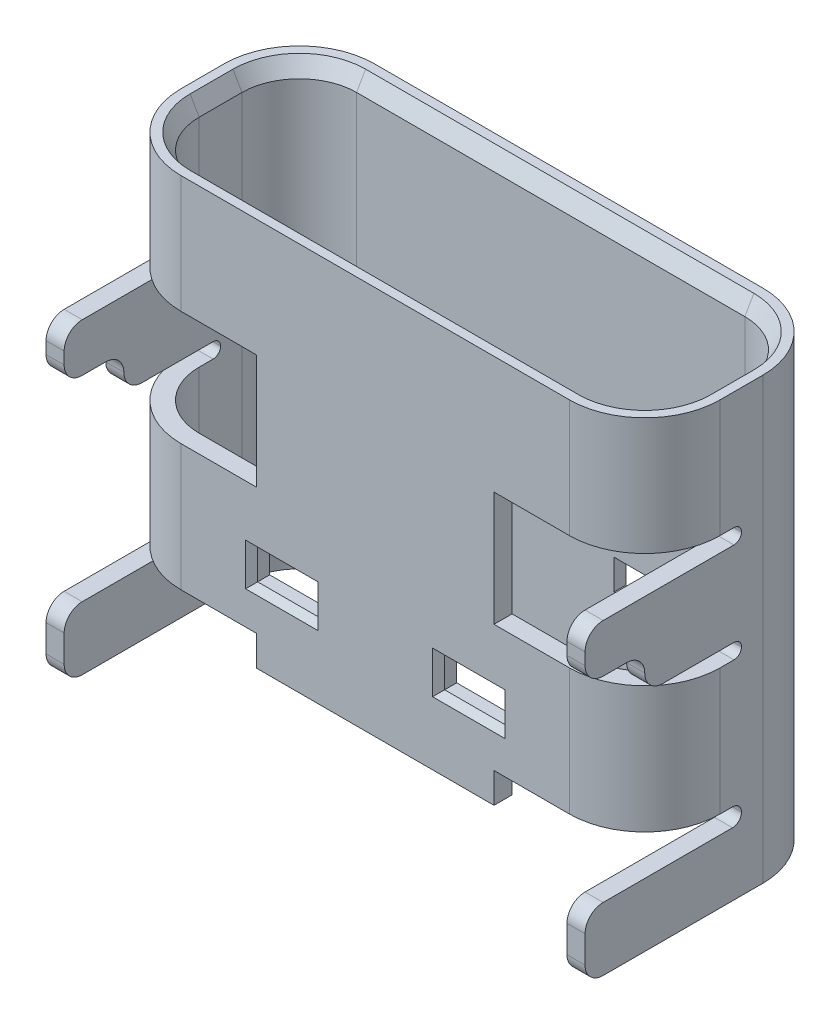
ISO-10303-21;
HEADER;
FILE_DESCRIPTION(('STEP AP214'),'2;1');
FILE_NAME('part.step','',(''),(''),'','','');
FILE_SCHEMA(('AUTOMOTIVE_DESIGN { 1 0 10303 214 1 1 1 1 }'));
ENDSEC;
DATA;
#1=APPLICATION_CONTEXT('core data for automotive mechanical design processes');
#2=APPLICATION_PROTOCOL_DEFINITION('international standard','automotive_design',2000,#1);
#3=PRODUCT_CONTEXT('',#1,'mechanical');
#4=PRODUCT('Part','Part','',(#3));
#5=PRODUCT_RELATED_PRODUCT_CATEGORY('part','',(#4));
#6=PRODUCT_DEFINITION_FORMATION('','',#4);
#7=PRODUCT_DEFINITION_CONTEXT('part definition',#1,'design');
#8=PRODUCT_DEFINITION('design','',#6,#7);
#9=PRODUCT_DEFINITION_SHAPE('','',#8);
#10=(LENGTH_UNIT() NAMED_UNIT(*) SI_UNIT(.MILLI.,.METRE.));
#11=(NAMED_UNIT(*) PLANE_ANGLE_UNIT() SI_UNIT($,.RADIAN.));
#12=(NAMED_UNIT(*) SI_UNIT($,.STERADIAN.) SOLID_ANGLE_UNIT());
#13=UNCERTAINTY_MEASURE_WITH_UNIT(LENGTH_MEASURE(1.E-05),#10,'distance_accuracy_value','');
#14=(GEOMETRIC_REPRESENTATION_CONTEXT(3) GLOBAL_UNCERTAINTY_ASSIGNED_CONTEXT((#13)) GLOBAL_UNIT_ASSIGNED_CONTEXT((#10,
#11,#12)) REPRESENTATION_CONTEXT('',''));
#15=CARTESIAN_POINT('',(0.,0.,0.));
#16=DIRECTION('',(0.,0.,1.));
#17=DIRECTION('',(1.,0.,0.));
#18=AXIS2_PLACEMENT_3D('',#15,#16,#17);
#19=CARTESIAN_POINT('',(-4.47,7.3,1.605));
#20=DIRECTION('',(1.,0.,0.));
#21=DIRECTION('',(0.,0.,-1.));
#22=AXIS2_PLACEMENT_3D('',#19,#20,#21);
#23=PLANE('',#22);
#24=DIRECTION('',(0.,0.,-1.));
#25=VECTOR('',#24,1.);
#26=CARTESIAN_POINT('',(-4.47,3.7,0.));
#27=LINE('',#26,#25);
#28=CARTESIAN_POINT('',(-4.47,3.7,1.305));
#29=VERTEX_POINT('',#28);
#30=CARTESIAN_POINT('',(-4.47,3.7,0.125));
#31=VERTEX_POINT('',#30);
#32=EDGE_CURVE('E11',#29,#31,#27,.T.);
#33=ORIENTED_EDGE('',*,*,#32,.F.);
#34=CARTESIAN_POINT('',(-4.47,4.,1.305));
#35=DIRECTION('',(-1.,0.,0.));
#36=DIRECTION('',(0.,0.,-1.));
#37=AXIS2_PLACEMENT_3D('',#34,#35,#36);
#38=CIRCLE('',#37,0.3);
#39=CARTESIAN_POINT('',(-4.47,4.,1.605));
#40=VERTEX_POINT('',#39);
#41=EDGE_CURVE('E25',#29,#40,#38,.T.);
#42=ORIENTED_EDGE('',*,*,#41,.T.);
#43=CARTESIAN_POINT('',(-4.47,4.,1.905));
#44=DIRECTION('',(1.,0.,0.));
#45=DIRECTION('',(0.,0.,-1.));
#46=AXIS2_PLACEMENT_3D('',#43,#44,#45);
#47=CIRCLE('',#46,0.3);
#48=CARTESIAN_POINT('',(-4.47,4.3,1.905));
#49=VERTEX_POINT('',#48);
#50=EDGE_CURVE('E2043',#40,#49,#47,.T.);
#51=ORIENTED_EDGE('',*,*,#50,.T.);
#52=DIRECTION('',(0.,0.,1.));
#53=VECTOR('',#52,1.);
#54=CARTESIAN_POINT('',(-4.47,4.3,2.595));
#55=LINE('',#54,#53);
#56=CARTESIAN_POINT('',(-4.47,4.3,2.295));
#57=VERTEX_POINT('',#56);
#58=EDGE_CURVE('E2039',#49,#57,#55,.T.);
#59=ORIENTED_EDGE('',*,*,#58,.T.);
#60=CARTESIAN_POINT('',(-4.47,4.6,2.295));
#61=DIRECTION('',(-1.,0.,0.));
#62=DIRECTION('',(0.,0.,-1.));
#63=AXIS2_PLACEMENT_3D('',#60,#61,#62);
#64=CIRCLE('',#63,0.3);
#65=CARTESIAN_POINT('',(-4.47,4.6,2.595));
#66=VERTEX_POINT('',#65);
#67=EDGE_CURVE('E2035',#57,#66,#64,.T.);
#68=ORIENTED_EDGE('',*,*,#67,.T.);
#69=DIRECTION('',(0.,-1.,0.));
#70=VECTOR('',#69,1.);
#71=CARTESIAN_POINT('',(-4.47,0.,2.595));
#72=LINE('',#71,#70);
#73=CARTESIAN_POINT('',(-4.47,4.8,2.595));
#74=VERTEX_POINT('',#73);
#75=EDGE_CURVE('E2030',#74,#66,#72,.T.);
#76=ORIENTED_EDGE('',*,*,#75,.F.);
#77=CARTESIAN_POINT('',(-4.47,4.8,2.295));
#78=DIRECTION('',(-1.,0.,0.));
#79=DIRECTION('',(0.,0.,-1.));
#80=AXIS2_PLACEMENT_3D('',#77,#78,#79);
#81=CIRCLE('',#80,0.3);
#82=CARTESIAN_POINT('',(-4.47,5.1,2.295));
#83=VERTEX_POINT('',#82);
#84=EDGE_CURVE('E2026',#74,#83,#81,.T.);
#85=ORIENTED_EDGE('',*,*,#84,.T.);
#86=DIRECTION('',(0.,0.,-1.));
#87=VECTOR('',#86,1.);
#88=CARTESIAN_POINT('',(-4.47,5.1,0.));
#89=LINE('',#88,#87);
#90=CARTESIAN_POINT('',(-4.47,5.1,0.125));
#91=VERTEX_POINT('',#90);
#92=EDGE_CURVE('E2022',#83,#91,#89,.T.);
#93=ORIENTED_EDGE('',*,*,#92,.T.);
#94=CARTESIAN_POINT('',(-4.47,5.225,0.125));
#95=DIRECTION('',(1.,0.,0.));
#96=DIRECTION('',(0.,0.,-1.));
#97=AXIS2_PLACEMENT_3D('',#94,#95,#96);
#98=CIRCLE('',#97,0.125);
#99=CARTESIAN_POINT('',(-4.47,5.225,0.));
#100=VERTEX_POINT('',#99);
#101=EDGE_CURVE('E2018',#91,#100,#98,.T.);
#102=ORIENTED_EDGE('',*,*,#101,.T.);
#103=CARTESIAN_POINT('',(-4.47,5.225,0.125));
#104=DIRECTION('',(1.,0.,0.));
#105=DIRECTION('',(0.,0.,-1.));
#106=AXIS2_PLACEMENT_3D('',#103,#104,#105);
#107=CIRCLE('',#106,0.125);
#108=CARTESIAN_POINT('',(-4.47,5.35,0.125));
#109=VERTEX_POINT('',#108);
#110=EDGE_CURVE('E2014',#100,#109,#107,.T.);
#111=ORIENTED_EDGE('',*,*,#110,.T.);
#112=DIRECTION('',(0.,0.,-1.));
#113=VECTOR('',#112,1.);
#114=CARTESIAN_POINT('',(-4.47,5.35,0.));
#115=LINE('',#114,#113);
#116=CARTESIAN_POINT('',(-4.47,5.35,0.355));
#117=VERTEX_POINT('',#116);
#118=EDGE_CURVE('E2009',#117,#109,#115,.T.);
#119=ORIENTED_EDGE('',*,*,#118,.F.);
#120=DIRECTION('',(0.,1.,0.));
#121=VECTOR('',#120,1.);
#122=CARTESIAN_POINT('',(-4.47,7.3,0.355));
#123=LINE('',#122,#121);
#124=CARTESIAN_POINT('',(-4.47,7.3,0.355));
#125=VERTEX_POINT('',#124);
#126=EDGE_CURVE('E2005',#117,#125,#123,.T.);
#127=ORIENTED_EDGE('',*,*,#126,.T.);
#128=DIRECTION('',(0.,0.,1.));
#129=VECTOR('',#128,1.);
#130=CARTESIAN_POINT('',(-4.47,7.3,1.605));
#131=LINE('',#130,#129);
#132=CARTESIAN_POINT('',(-4.47,7.3,-0.355));
#133=VERTEX_POINT('',#132);
#134=EDGE_CURVE('E2000',#133,#125,#131,.T.);
#135=ORIENTED_EDGE('',*,*,#134,.F.);
#136=DIRECTION('',(0.,-1.,0.));
#137=VECTOR('',#136,1.);
#138=CARTESIAN_POINT('',(-4.47,7.3,-0.355));
#139=LINE('',#138,#137);
#140=CARTESIAN_POINT('',(-4.47,0.,-0.355));
#141=VERTEX_POINT('',#140);
#142=EDGE_CURVE('E1996',#133,#141,#139,.T.);
#143=ORIENTED_EDGE('',*,*,#142,.T.);
#144=DIRECTION('',(0.,0.,1.));
#145=VECTOR('',#144,1.);
#146=CARTESIAN_POINT('',(-4.47,0.,1.605));
#147=LINE('',#146,#145);
#148=CARTESIAN_POINT('',(-4.47,0.,2.295));
#149=VERTEX_POINT('',#148);
#150=EDGE_CURVE('E1992',#141,#149,#147,.T.);
#151=ORIENTED_EDGE('',*,*,#150,.T.);
#152=CARTESIAN_POINT('',(-4.47,0.3,2.295));
#153=DIRECTION('',(-1.,0.,0.));
#154=DIRECTION('',(0.,0.,-1.));
#155=AXIS2_PLACEMENT_3D('',#152,#153,#154);
#156=CIRCLE('',#155,0.3);
#157=CARTESIAN_POINT('',(-4.47,0.3,2.595));
#158=VERTEX_POINT('',#157);
#159=EDGE_CURVE('E1988',#149,#158,#156,.T.);
#160=ORIENTED_EDGE('',*,*,#159,.T.);
#161=DIRECTION('',(0.,-1.,0.));
#162=VECTOR('',#161,1.);
#163=CARTESIAN_POINT('',(-4.47,0.,2.595));
#164=LINE('',#163,#162);
#165=CARTESIAN_POINT('',(-4.47,0.75,2.595));
#166=VERTEX_POINT('',#165);
#167=EDGE_CURVE('E1983',#166,#158,#164,.T.);
#168=ORIENTED_EDGE('',*,*,#167,.F.);
#169=CARTESIAN_POINT('',(-4.47,0.75,2.295));
#170=DIRECTION('',(-1.,0.,0.));
#171=DIRECTION('',(0.,0.,-1.));
#172=AXIS2_PLACEMENT_3D('',#169,#170,#171);
#173=CIRCLE('',#172,0.3);
#174=CARTESIAN_POINT('',(-4.47,1.05,2.295));
#175=VERTEX_POINT('',#174);
#176=EDGE_CURVE('E1979',#166,#175,#173,.T.);
#177=ORIENTED_EDGE('',*,*,#176,.T.);
#178=DIRECTION('',(0.,0.,1.));
#179=VECTOR('',#178,1.);
#180=CARTESIAN_POINT('',(-4.47,1.05,0.));
#181=LINE('',#180,#179);
#182=CARTESIAN_POINT('',(-4.47,1.05,0.15));
#183=VERTEX_POINT('',#182);
#184=EDGE_CURVE('E1974',#183,#175,#181,.T.);
#185=ORIENTED_EDGE('',*,*,#184,.F.);
#186=CARTESIAN_POINT('',(-4.47,1.2,0.15));
#187=DIRECTION('',(1.,0.,0.));
#188=DIRECTION('',(0.,0.,-1.));
#189=AXIS2_PLACEMENT_3D('',#186,#187,#188);
#190=CIRCLE('',#189,0.15);
#191=CARTESIAN_POINT('',(-4.47,1.2,0.));
#192=VERTEX_POINT('',#191);
#193=EDGE_CURVE('E1970',#183,#192,#190,.T.);
#194=ORIENTED_EDGE('',*,*,#193,.T.);
#195=CARTESIAN_POINT('',(-4.47,1.2,0.15));
#196=DIRECTION('',(1.,0.,0.));
#197=DIRECTION('',(0.,0.,-1.));
#198=AXIS2_PLACEMENT_3D('',#195,#196,#197);
#199=CIRCLE('',#198,0.15);
#200=CARTESIAN_POINT('',(-4.47,1.35,0.15));
#201=VERTEX_POINT('',#200);
#202=EDGE_CURVE('E1966',#192,#201,#199,.T.);
#203=ORIENTED_EDGE('',*,*,#202,.T.);
#204=DIRECTION('',(0.,0.,1.));
#205=VECTOR('',#204,1.);
#206=CARTESIAN_POINT('',(-4.47,1.35,0.));
#207=LINE('',#206,#205);
#208=CARTESIAN_POINT('',(-4.47,1.35,0.355));
#209=VERTEX_POINT('',#208);
#210=EDGE_CURVE('E1962',#201,#209,#207,.T.);
#211=ORIENTED_EDGE('',*,*,#210,.T.);
#212=DIRECTION('',(0.,1.,0.));
#213=VECTOR('',#212,1.);
#214=CARTESIAN_POINT('',(-4.47,7.3,0.355));
#215=LINE('',#214,#213);
#216=CARTESIAN_POINT('',(-4.47,3.45,0.355));
#217=VERTEX_POINT('',#216);
#218=EDGE_CURVE('E1958',#209,#217,#215,.T.);
#219=ORIENTED_EDGE('',*,*,#218,.T.);
#220=DIRECTION('',(0.,0.,-1.));
#221=VECTOR('',#220,1.);
#222=CARTESIAN_POINT('',(-4.47,3.45,0.));
#223=LINE('',#222,#221);
#224=CARTESIAN_POINT('',(-4.47,3.45,0.125));
#225=VERTEX_POINT('',#224);
#226=EDGE_CURVE('E1954',#217,#225,#223,.T.);
#227=ORIENTED_EDGE('',*,*,#226,.T.);
#228=CARTESIAN_POINT('',(-4.47,3.575,0.125));
#229=DIRECTION('',(1.,0.,0.));
#230=DIRECTION('',(0.,0.,-1.));
#231=AXIS2_PLACEMENT_3D('',#228,#229,#230);
#232=CIRCLE('',#231,0.125);
#233=CARTESIAN_POINT('',(-4.47,3.575,0.));
#234=VERTEX_POINT('',#233);
#235=EDGE_CURVE('E1950',#225,#234,#232,.T.);
#236=ORIENTED_EDGE('',*,*,#235,.T.);
#237=CARTESIAN_POINT('',(-4.47,3.575,0.125));
#238=DIRECTION('',(1.,0.,0.));
#239=DIRECTION('',(0.,0.,-1.));
#240=AXIS2_PLACEMENT_3D('',#237,#238,#239);
#241=CIRCLE('',#240,0.125);
#242=EDGE_CURVE('E1946',#234,#31,#241,.T.);
#243=ORIENTED_EDGE('',*,*,#242,.T.);
#244=EDGE_LOOP('',(#33,#42,#51,#59,#68,#76,#85,#93,#102,#111,#119,#127,#135,#143,#151,#160,#168,
#177,#185,#194,#203,#211,#219,#227,#236,#243));
#245=FACE_BOUND('',#244,.T.);
#246=ADVANCED_FACE('F17',(#245),#23,.F.);
#247=CARTESIAN_POINT('',(-1.97,3.575,0.125));
#248=DIRECTION('',(1.,0.,0.));
#249=DIRECTION('',(0.,-0.707106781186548,0.707106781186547));
#250=AXIS2_PLACEMENT_3D('',#247,#248,#249);
#251=CYLINDRICAL_SURFACE('',#250,0.125);
#252=CARTESIAN_POINT('',(-4.17,3.575,0.125));
#253=DIRECTION('',(-1.,0.,0.));
#254=DIRECTION('',(0.,0.,1.));
#255=AXIS2_PLACEMENT_3D('',#252,#253,#254);
#256=CIRCLE('',#255,0.125);
#257=CARTESIAN_POINT('',(-4.17,3.7,0.125));
#258=VERTEX_POINT('',#257);
#259=CARTESIAN_POINT('',(-4.17,3.575,0.));
#260=VERTEX_POINT('',#259);
#261=EDGE_CURVE('E1941',#258,#260,#256,.T.);
#262=ORIENTED_EDGE('',*,*,#261,.F.);
#263=DIRECTION('',(1.,0.,0.));
#264=VECTOR('',#263,1.);
#265=CARTESIAN_POINT('',(-4.17,3.7,0.125));
#266=LINE('',#265,#264);
#267=EDGE_CURVE('E1936',#31,#258,#266,.T.);
#268=ORIENTED_EDGE('',*,*,#267,.F.);
#269=ORIENTED_EDGE('',*,*,#242,.F.);
#270=DIRECTION('',(1.,0.,0.));
#271=VECTOR('',#270,1.);
#272=CARTESIAN_POINT('',(-1.97,3.575,0.));
#273=LINE('',#272,#271);
#274=EDGE_CURVE('E1932',#234,#260,#273,.T.);
#275=ORIENTED_EDGE('',*,*,#274,.T.);
#276=EDGE_LOOP('',(#262,#268,#269,#275));
#277=FACE_BOUND('',#276,.T.);
#278=ADVANCED_FACE('F2159',(#277),#251,.F.);
#279=CARTESIAN_POINT('',(-1.97,3.575,0.125));
#280=DIRECTION('',(-1.,0.,0.));
#281=DIRECTION('',(0.,0.707106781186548,0.707106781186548));
#282=AXIS2_PLACEMENT_3D('',#279,#280,#281);
#283=CYLINDRICAL_SURFACE('',#282,0.125);
#284=DIRECTION('',(-1.,0.,0.));
#285=VECTOR('',#284,1.);
#286=CARTESIAN_POINT('',(-1.97,3.45,0.125));
#287=LINE('',#286,#285);
#288=CARTESIAN_POINT('',(-4.17,3.45,0.125));
#289=VERTEX_POINT('',#288);
#290=EDGE_CURVE('E1927',#289,#225,#287,.T.);
#291=ORIENTED_EDGE('',*,*,#290,.F.);
#292=CARTESIAN_POINT('',(-4.17,3.575,0.125));
#293=DIRECTION('',(-1.,0.,0.));
#294=DIRECTION('',(0.,0.,1.));
#295=AXIS2_PLACEMENT_3D('',#292,#293,#294);
#296=CIRCLE('',#295,0.125);
#297=EDGE_CURVE('E1922',#260,#289,#296,.T.);
#298=ORIENTED_EDGE('',*,*,#297,.F.);
#299=ORIENTED_EDGE('',*,*,#274,.F.);
#300=ORIENTED_EDGE('',*,*,#235,.F.);
#301=EDGE_LOOP('',(#291,#298,#299,#300));
#302=FACE_BOUND('',#301,.T.);
#303=ADVANCED_FACE('F2155',(#302),#283,.F.);
#304=CARTESIAN_POINT('',(-4.17,0.,0.));
#305=DIRECTION('',(-1.,0.,0.));
#306=DIRECTION('',(0.,0.,1.));
#307=AXIS2_PLACEMENT_3D('',#304,#305,#306);
#308=PLANE('',#307);
#309=DIRECTION('',(0.,0.,-1.));
#310=VECTOR('',#309,1.);
#311=CARTESIAN_POINT('',(-4.17,4.3,2.595));
#312=LINE('',#311,#310);
#313=CARTESIAN_POINT('',(-4.17,4.3,2.295));
#314=VERTEX_POINT('',#313);
#315=CARTESIAN_POINT('',(-4.17,4.3,1.905));
#316=VERTEX_POINT('',#315);
#317=EDGE_CURVE('E1918',#314,#316,#312,.T.);
#318=ORIENTED_EDGE('',*,*,#317,.T.);
#319=CARTESIAN_POINT('',(-4.17,4.,1.905));
#320=DIRECTION('',(-1.,0.,0.));
#321=DIRECTION('',(0.,0.,1.));
#322=AXIS2_PLACEMENT_3D('',#319,#320,#321);
#323=CIRCLE('',#322,0.3);
#324=CARTESIAN_POINT('',(-4.17,4.,1.605));
#325=VERTEX_POINT('',#324);
#326=EDGE_CURVE('E1914',#316,#325,#323,.T.);
#327=ORIENTED_EDGE('',*,*,#326,.T.);
#328=CARTESIAN_POINT('',(-4.17,4.,1.305));
#329=DIRECTION('',(1.,0.,0.));
#330=DIRECTION('',(0.,0.,1.));
#331=AXIS2_PLACEMENT_3D('',#328,#329,#330);
#332=CIRCLE('',#331,0.3);
#333=CARTESIAN_POINT('',(-4.17,3.7,1.305));
#334=VERTEX_POINT('',#333);
#335=EDGE_CURVE('E1910',#325,#334,#332,.T.);
#336=ORIENTED_EDGE('',*,*,#335,.T.);
#337=DIRECTION('',(0.,0.,-1.));
#338=VECTOR('',#337,1.);
#339=CARTESIAN_POINT('',(-4.17,3.7,0.));
#340=LINE('',#339,#338);
#341=EDGE_CURVE('E1905',#334,#258,#340,.T.);
#342=ORIENTED_EDGE('',*,*,#341,.T.);
#343=ORIENTED_EDGE('',*,*,#261,.T.);
#344=ORIENTED_EDGE('',*,*,#297,.T.);
#345=DIRECTION('',(0.,0.,-1.));
#346=VECTOR('',#345,1.);
#347=CARTESIAN_POINT('',(-4.17,3.45,0.));
#348=LINE('',#347,#346);
#349=CARTESIAN_POINT('',(-4.17,3.45,0.355));
#350=VERTEX_POINT('',#349);
#351=EDGE_CURVE('E1900',#350,#289,#348,.T.);
#352=ORIENTED_EDGE('',*,*,#351,.F.);
#353=DIRECTION('',(0.,1.,0.));
#354=VECTOR('',#353,1.);
#355=CARTESIAN_POINT('',(-4.17,0.,0.355));
#356=LINE('',#355,#354);
#357=CARTESIAN_POINT('',(-4.17,1.35,0.355));
#358=VERTEX_POINT('',#357);
#359=EDGE_CURVE('E1895',#358,#350,#356,.T.);
#360=ORIENTED_EDGE('',*,*,#359,.F.);
#361=DIRECTION('',(0.,0.,1.));
#362=VECTOR('',#361,1.);
#363=CARTESIAN_POINT('',(-4.17,1.35,0.));
#364=LINE('',#363,#362);
#365=CARTESIAN_POINT('',(-4.17,1.35,0.15));
#366=VERTEX_POINT('',#365);
#367=EDGE_CURVE('E1890',#366,#358,#364,.T.);
#368=ORIENTED_EDGE('',*,*,#367,.F.);
#369=CARTESIAN_POINT('',(-4.17,1.2,0.15));
#370=DIRECTION('',(-1.,0.,0.));
#371=DIRECTION('',(0.,0.,1.));
#372=AXIS2_PLACEMENT_3D('',#369,#370,#371);
#373=CIRCLE('',#372,0.15);
#374=CARTESIAN_POINT('',(-4.17,1.2,0.));
#375=VERTEX_POINT('',#374);
#376=EDGE_CURVE('E1886',#366,#375,#373,.T.);
#377=ORIENTED_EDGE('',*,*,#376,.T.);
#378=CARTESIAN_POINT('',(-4.17,1.2,0.15));
#379=DIRECTION('',(-1.,0.,0.));
#380=DIRECTION('',(0.,0.,1.));
#381=AXIS2_PLACEMENT_3D('',#378,#379,#380);
#382=CIRCLE('',#381,0.15);
#383=CARTESIAN_POINT('',(-4.17,1.05,0.15));
#384=VERTEX_POINT('',#383);
#385=EDGE_CURVE('E1882',#375,#384,#382,.T.);
#386=ORIENTED_EDGE('',*,*,#385,.T.);
#387=DIRECTION('',(0.,0.,1.));
#388=VECTOR('',#387,1.);
#389=CARTESIAN_POINT('',(-4.17,1.05,0.));
#390=LINE('',#389,#388);
#391=CARTESIAN_POINT('',(-4.17,1.05,2.295));
#392=VERTEX_POINT('',#391);
#393=EDGE_CURVE('E1878',#384,#392,#390,.T.);
#394=ORIENTED_EDGE('',*,*,#393,.T.);
#395=CARTESIAN_POINT('',(-4.17,0.75,2.295));
#396=DIRECTION('',(1.,0.,0.));
#397=DIRECTION('',(0.,0.,1.));
#398=AXIS2_PLACEMENT_3D('',#395,#396,#397);
#399=CIRCLE('',#398,0.3);
#400=CARTESIAN_POINT('',(-4.17,0.75,2.595));
#401=VERTEX_POINT('',#400);
#402=EDGE_CURVE('E1874',#392,#401,#399,.T.);
#403=ORIENTED_EDGE('',*,*,#402,.T.);
#404=DIRECTION('',(0.,-1.,0.));
#405=VECTOR('',#404,1.);
#406=CARTESIAN_POINT('',(-4.17,0.,2.595));
#407=LINE('',#406,#405);
#408=CARTESIAN_POINT('',(-4.17,0.3,2.595));
#409=VERTEX_POINT('',#408);
#410=EDGE_CURVE('E1870',#401,#409,#407,.T.);
#411=ORIENTED_EDGE('',*,*,#410,.T.);
#412=CARTESIAN_POINT('',(-4.17,0.3,2.295));
#413=DIRECTION('',(1.,0.,0.));
#414=DIRECTION('',(0.,0.,1.));
#415=AXIS2_PLACEMENT_3D('',#412,#413,#414);
#416=CIRCLE('',#415,0.3);
#417=CARTESIAN_POINT('',(-4.17,0.,2.295));
#418=VERTEX_POINT('',#417);
#419=EDGE_CURVE('E1866',#409,#418,#416,.T.);
#420=ORIENTED_EDGE('',*,*,#419,.T.);
#421=DIRECTION('',(0.,0.,1.));
#422=VECTOR('',#421,1.);
#423=CARTESIAN_POINT('',(-4.17,0.,0.));
#424=LINE('',#423,#422);
#425=CARTESIAN_POINT('',(-4.17,0.,-0.355));
#426=VERTEX_POINT('',#425);
#427=EDGE_CURVE('E1861',#426,#418,#424,.T.);
#428=ORIENTED_EDGE('',*,*,#427,.F.);
#429=DIRECTION('',(0.,1.,0.));
#430=VECTOR('',#429,1.);
#431=CARTESIAN_POINT('',(-4.17,0.,-0.355));
#432=LINE('',#431,#430);
#433=CARTESIAN_POINT('',(-4.17,7.040192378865,-0.355));
#434=VERTEX_POINT('',#433);
#435=EDGE_CURVE('E1857',#426,#434,#432,.T.);
#436=ORIENTED_EDGE('',*,*,#435,.T.);
#437=DIRECTION('',(0.,0.,1.));
#438=VECTOR('',#437,1.);
#439=CARTESIAN_POINT('',(-4.17,7.040192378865,0.));
#440=LINE('',#439,#438);
#441=CARTESIAN_POINT('',(-4.17,7.040192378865,0.355));
#442=VERTEX_POINT('',#441);
#443=EDGE_CURVE('E1853',#434,#442,#440,.T.);
#444=ORIENTED_EDGE('',*,*,#443,.T.);
#445=DIRECTION('',(0.,1.,0.));
#446=VECTOR('',#445,1.);
#447=CARTESIAN_POINT('',(-4.17,0.,0.355));
#448=LINE('',#447,#446);
#449=CARTESIAN_POINT('',(-4.17,5.35,0.355));
#450=VERTEX_POINT('',#449);
#451=EDGE_CURVE('E1848',#450,#442,#448,.T.);
#452=ORIENTED_EDGE('',*,*,#451,.F.);
#453=DIRECTION('',(0.,0.,-1.));
#454=VECTOR('',#453,1.);
#455=CARTESIAN_POINT('',(-4.17,5.35,0.));
#456=LINE('',#455,#454);
#457=CARTESIAN_POINT('',(-4.17,5.35,0.125));
#458=VERTEX_POINT('',#457);
#459=EDGE_CURVE('E1844',#450,#458,#456,.T.);
#460=ORIENTED_EDGE('',*,*,#459,.T.);
#461=CARTESIAN_POINT('',(-4.17,5.225,0.125));
#462=DIRECTION('',(-1.,0.,0.));
#463=DIRECTION('',(0.,0.,1.));
#464=AXIS2_PLACEMENT_3D('',#461,#462,#463);
#465=CIRCLE('',#464,0.125);
#466=CARTESIAN_POINT('',(-4.17,5.225,0.));
#467=VERTEX_POINT('',#466);
#468=EDGE_CURVE('E1840',#458,#467,#465,.T.);
#469=ORIENTED_EDGE('',*,*,#468,.T.);
#470=CARTESIAN_POINT('',(-4.17,5.225,0.125));
#471=DIRECTION('',(-1.,0.,0.));
#472=DIRECTION('',(0.,0.,1.));
#473=AXIS2_PLACEMENT_3D('',#470,#471,#472);
#474=CIRCLE('',#473,0.125);
#475=CARTESIAN_POINT('',(-4.17,5.1,0.125));
#476=VERTEX_POINT('',#475);
#477=EDGE_CURVE('E1836',#467,#476,#474,.T.);
#478=ORIENTED_EDGE('',*,*,#477,.T.);
#479=DIRECTION('',(0.,0.,-1.));
#480=VECTOR('',#479,1.);
#481=CARTESIAN_POINT('',(-4.17,5.1,0.));
#482=LINE('',#481,#480);
#483=CARTESIAN_POINT('',(-4.17,5.1,2.295));
#484=VERTEX_POINT('',#483);
#485=EDGE_CURVE('E1831',#484,#476,#482,.T.);
#486=ORIENTED_EDGE('',*,*,#485,.F.);
#487=CARTESIAN_POINT('',(-4.17,4.8,2.295));
#488=DIRECTION('',(1.,0.,0.));
#489=DIRECTION('',(0.,0.,1.));
#490=AXIS2_PLACEMENT_3D('',#487,#488,#489);
#491=CIRCLE('',#490,0.3);
#492=CARTESIAN_POINT('',(-4.17,4.8,2.595));
#493=VERTEX_POINT('',#492);
#494=EDGE_CURVE('E1827',#484,#493,#491,.T.);
#495=ORIENTED_EDGE('',*,*,#494,.T.);
#496=DIRECTION('',(0.,-1.,0.));
#497=VECTOR('',#496,1.);
#498=CARTESIAN_POINT('',(-4.17,0.,2.595));
#499=LINE('',#498,#497);
#500=CARTESIAN_POINT('',(-4.17,4.6,2.595));
#501=VERTEX_POINT('',#500);
#502=EDGE_CURVE('E1823',#493,#501,#499,.T.);
#503=ORIENTED_EDGE('',*,*,#502,.T.);
#504=CARTESIAN_POINT('',(-4.17,4.6,2.295));
#505=DIRECTION('',(1.,0.,0.));
#506=DIRECTION('',(0.,0.,1.));
#507=AXIS2_PLACEMENT_3D('',#504,#505,#506);
#508=CIRCLE('',#507,0.3);
#509=EDGE_CURVE('E1819',#501,#314,#508,.T.);
#510=ORIENTED_EDGE('',*,*,#509,.T.);
#511=EDGE_LOOP('',(#318,#327,#336,#342,#343,#344,#352,#360,#368,#377,#386,#394,#403,#411,#420,
#428,#436,#444,#452,#460,#469,#478,#486,#495,#503,#510));
#512=FACE_BOUND('',#511,.T.);
#513=ADVANCED_FACE('F2168',(#512),#308,.F.);
#514=CARTESIAN_POINT('',(4.471,4.6,2.295));
#515=DIRECTION('',(1.,0.,0.));
#516=DIRECTION('',(0.,0.707106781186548,-0.707106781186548));
#517=AXIS2_PLACEMENT_3D('',#514,#515,#516);
#518=CYLINDRICAL_SURFACE('',#517,0.3);
#519=ORIENTED_EDGE('',*,*,#509,.F.);
#520=DIRECTION('',(1.,0.,0.));
#521=VECTOR('',#520,1.);
#522=CARTESIAN_POINT('',(-4.17,4.6,2.595));
#523=LINE('',#522,#521);
#524=EDGE_CURVE('E1814',#66,#501,#523,.T.);
#525=ORIENTED_EDGE('',*,*,#524,.F.);
#526=ORIENTED_EDGE('',*,*,#67,.F.);
#527=DIRECTION('',(-1.,0.,0.));
#528=VECTOR('',#527,1.);
#529=CARTESIAN_POINT('',(-4.47,4.3,2.295));
#530=LINE('',#529,#528);
#531=EDGE_CURVE('E1809',#314,#57,#530,.T.);
#532=ORIENTED_EDGE('',*,*,#531,.F.);
#533=EDGE_LOOP('',(#519,#525,#526,#532));
#534=FACE_BOUND('',#533,.T.);
#535=ADVANCED_FACE('F2066',(#534),#518,.T.);
#536=CARTESIAN_POINT('',(4.471,4.3,2.595));
#537=DIRECTION('',(0.,-1.,0.));
#538=DIRECTION('',(0.,0.,-1.));
#539=AXIS2_PLACEMENT_3D('',#536,#537,#538);
#540=PLANE('',#539);
#541=ORIENTED_EDGE('',*,*,#58,.F.);
#542=DIRECTION('',(1.,0.,0.));
#543=VECTOR('',#542,1.);
#544=CARTESIAN_POINT('',(-4.17,4.3,1.905));
#545=LINE('',#544,#543);
#546=EDGE_CURVE('E1804',#49,#316,#545,.T.);
#547=ORIENTED_EDGE('',*,*,#546,.T.);
#548=ORIENTED_EDGE('',*,*,#317,.F.);
#549=ORIENTED_EDGE('',*,*,#531,.T.);
#550=EDGE_LOOP('',(#541,#547,#548,#549));
#551=FACE_BOUND('',#550,.T.);
#552=ADVANCED_FACE('F2060',(#551),#540,.T.);
#553=CARTESIAN_POINT('',(4.471,4.,1.905));
#554=DIRECTION('',(1.,0.,0.));
#555=DIRECTION('',(0.,-0.707106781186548,0.707106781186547));
#556=AXIS2_PLACEMENT_3D('',#553,#554,#555);
#557=CYLINDRICAL_SURFACE('',#556,0.3);
#558=DIRECTION('',(-1.,0.,0.));
#559=VECTOR('',#558,1.);
#560=CARTESIAN_POINT('',(-4.47,4.,1.605));
#561=LINE('',#560,#559);
#562=EDGE_CURVE('E1800',#325,#40,#561,.T.);
#563=ORIENTED_EDGE('',*,*,#562,.F.);
#564=ORIENTED_EDGE('',*,*,#326,.F.);
#565=ORIENTED_EDGE('',*,*,#546,.F.);
#566=ORIENTED_EDGE('',*,*,#50,.F.);
#567=EDGE_LOOP('',(#563,#564,#565,#566));
#568=FACE_BOUND('',#567,.T.);
#569=ADVANCED_FACE('F2057',(#568),#557,.F.);
#570=CARTESIAN_POINT('',(-4.17,4.,1.305));
#571=DIRECTION('',(1.,0.,0.));
#572=DIRECTION('',(0.,0.707106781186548,-0.707106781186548));
#573=AXIS2_PLACEMENT_3D('',#570,#571,#572);
#574=CYLINDRICAL_SURFACE('',#573,0.3);
#575=ORIENTED_EDGE('',*,*,#335,.F.);
#576=ORIENTED_EDGE('',*,*,#562,.T.);
#577=ORIENTED_EDGE('',*,*,#41,.F.);
#578=DIRECTION('',(-1.,0.,0.));
#579=VECTOR('',#578,1.);
#580=CARTESIAN_POINT('',(-4.47,3.7,1.305));
#581=LINE('',#580,#579);
#582=EDGE_CURVE('E1796',#334,#29,#581,.T.);
#583=ORIENTED_EDGE('',*,*,#582,.F.);
#584=EDGE_LOOP('',(#575,#576,#577,#583));
#585=FACE_BOUND('',#584,.T.);
#586=ADVANCED_FACE('F2166',(#585),#574,.T.);
#587=CARTESIAN_POINT('',(-4.17,3.7,0.));
#588=DIRECTION('',(0.,1.,0.));
#589=DIRECTION('',(0.,0.,1.));
#590=AXIS2_PLACEMENT_3D('',#587,#588,#589);
#591=PLANE('',#590);
#592=ORIENTED_EDGE('',*,*,#341,.F.);
#593=ORIENTED_EDGE('',*,*,#582,.T.);
#594=ORIENTED_EDGE('',*,*,#32,.T.);
#595=ORIENTED_EDGE('',*,*,#267,.T.);
#596=EDGE_LOOP('',(#592,#593,#594,#595));
#597=FACE_BOUND('',#596,.T.);
#598=ADVANCED_FACE('F2162',(#597),#591,.F.);
#599=CARTESIAN_POINT('',(-4.17,0.,2.595));
#600=DIRECTION('',(0.,0.,-1.));
#601=DIRECTION('',(-1.,0.,0.));
#602=AXIS2_PLACEMENT_3D('',#599,#600,#601);
#603=PLANE('',#602);
#604=ORIENTED_EDGE('',*,*,#502,.F.);
#605=DIRECTION('',(-1.,0.,0.));
#606=VECTOR('',#605,1.);
#607=CARTESIAN_POINT('',(-4.47,4.8,2.595));
#608=LINE('',#607,#606);
#609=EDGE_CURVE('E1791',#493,#74,#608,.T.);
#610=ORIENTED_EDGE('',*,*,#609,.T.);
#611=ORIENTED_EDGE('',*,*,#75,.T.);
#612=ORIENTED_EDGE('',*,*,#524,.T.);
#613=EDGE_LOOP('',(#604,#610,#611,#612));
#614=FACE_BOUND('',#613,.T.);
#615=ADVANCED_FACE('F2072',(#614),#603,.F.);
#616=CARTESIAN_POINT('',(-4.17,4.8,2.295));
#617=DIRECTION('',(1.,0.,0.));
#618=DIRECTION('',(0.,-0.707106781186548,-0.707106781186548));
#619=AXIS2_PLACEMENT_3D('',#616,#617,#618);
#620=CYLINDRICAL_SURFACE('',#619,0.3);
#621=ORIENTED_EDGE('',*,*,#494,.F.);
#622=DIRECTION('',(1.,0.,0.));
#623=VECTOR('',#622,1.);
#624=CARTESIAN_POINT('',(-4.17,5.1,2.295));
#625=LINE('',#624,#623);
#626=EDGE_CURVE('E1786',#83,#484,#625,.T.);
#627=ORIENTED_EDGE('',*,*,#626,.F.);
#628=ORIENTED_EDGE('',*,*,#84,.F.);
#629=ORIENTED_EDGE('',*,*,#609,.F.);
#630=EDGE_LOOP('',(#621,#627,#628,#629));
#631=FACE_BOUND('',#630,.T.);
#632=ADVANCED_FACE('F2075',(#631),#620,.T.);
#633=CARTESIAN_POINT('',(-4.17,5.1,0.));
#634=DIRECTION('',(0.,1.,0.));
#635=DIRECTION('',(0.,0.,1.));
#636=AXIS2_PLACEMENT_3D('',#633,#634,#635);
#637=PLANE('',#636);
#638=ORIENTED_EDGE('',*,*,#92,.F.);
#639=ORIENTED_EDGE('',*,*,#626,.T.);
#640=ORIENTED_EDGE('',*,*,#485,.T.);
#641=DIRECTION('',(-1.,0.,0.));
#642=VECTOR('',#641,1.);
#643=CARTESIAN_POINT('',(-4.17,5.1,0.125));
#644=LINE('',#643,#642);
#645=EDGE_CURVE('E1781',#476,#91,#644,.T.);
#646=ORIENTED_EDGE('',*,*,#645,.T.);
#647=EDGE_LOOP('',(#638,#639,#640,#646));
#648=FACE_BOUND('',#647,.T.);
#649=ADVANCED_FACE('F2078',(#648),#637,.T.);
#650=CARTESIAN_POINT('',(-4.17,5.225,0.125));
#651=DIRECTION('',(-1.,0.,0.));
#652=DIRECTION('',(0.,0.707106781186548,0.707106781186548));
#653=AXIS2_PLACEMENT_3D('',#650,#651,#652);
#654=CYLINDRICAL_SURFACE('',#653,0.125);
#655=ORIENTED_EDGE('',*,*,#645,.F.);
#656=ORIENTED_EDGE('',*,*,#477,.F.);
#657=DIRECTION('',(1.,0.,0.));
#658=VECTOR('',#657,1.);
#659=CARTESIAN_POINT('',(-1.97,5.225,0.));
#660=LINE('',#659,#658);
#661=EDGE_CURVE('E1776',#100,#467,#660,.T.);
#662=ORIENTED_EDGE('',*,*,#661,.F.);
#663=ORIENTED_EDGE('',*,*,#101,.F.);
#664=EDGE_LOOP('',(#655,#656,#662,#663));
#665=FACE_BOUND('',#664,.T.);
#666=ADVANCED_FACE('F2086',(#665),#654,.F.);
#667=CARTESIAN_POINT('',(-1.97,5.225,0.125));
#668=DIRECTION('',(1.,0.,0.));
#669=DIRECTION('',(0.,-0.707106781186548,0.707106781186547));
#670=AXIS2_PLACEMENT_3D('',#667,#668,#669);
#671=CYLINDRICAL_SURFACE('',#670,0.125);
#672=ORIENTED_EDGE('',*,*,#468,.F.);
#673=DIRECTION('',(1.,0.,0.));
#674=VECTOR('',#673,1.);
#675=CARTESIAN_POINT('',(-4.17,5.35,0.125));
#676=LINE('',#675,#674);
#677=EDGE_CURVE('E1771',#109,#458,#676,.T.);
#678=ORIENTED_EDGE('',*,*,#677,.F.);
#679=ORIENTED_EDGE('',*,*,#110,.F.);
#680=ORIENTED_EDGE('',*,*,#661,.T.);
#681=EDGE_LOOP('',(#672,#678,#679,#680));
#682=FACE_BOUND('',#681,.T.);
#683=ADVANCED_FACE('F2089',(#682),#671,.F.);
#684=CARTESIAN_POINT('',(-1.97,5.35,0.));
#685=DIRECTION('',(0.,1.,0.));
#686=DIRECTION('',(0.,0.,1.));
#687=AXIS2_PLACEMENT_3D('',#684,#685,#686);
#688=PLANE('',#687);
#689=ORIENTED_EDGE('',*,*,#118,.T.);
#690=ORIENTED_EDGE('',*,*,#677,.T.);
#691=ORIENTED_EDGE('',*,*,#459,.F.);
#692=CARTESIAN_POINT('',(-3.22,5.35,0.355));
#693=DIRECTION('',(0.,-1.,0.));
#694=DIRECTION('',(0.,0.,1.));
#695=AXIS2_PLACEMENT_3D('',#692,#693,#694);
#696=CIRCLE('',#695,0.95);
#697=CARTESIAN_POINT('',(-3.22,5.35,1.305));
#698=VERTEX_POINT('',#697);
#699=EDGE_CURVE('E1766',#698,#450,#696,.T.);
#700=ORIENTED_EDGE('',*,*,#699,.F.);
#701=DIRECTION('',(-1.,0.,0.));
#702=VECTOR('',#701,1.);
#703=CARTESIAN_POINT('',(0.,5.35,1.305));
#704=LINE('',#703,#702);
#705=CARTESIAN_POINT('',(-1.97,5.35,1.305));
#706=VERTEX_POINT('',#705);
#707=EDGE_CURVE('E1761',#706,#698,#704,.T.);
#708=ORIENTED_EDGE('',*,*,#707,.F.);
#709=DIRECTION('',(0.,0.,-1.));
#710=VECTOR('',#709,1.);
#711=CARTESIAN_POINT('',(-1.97,5.35,0.));
#712=LINE('',#711,#710);
#713=CARTESIAN_POINT('',(-1.97,5.35,1.605));
#714=VERTEX_POINT('',#713);
#715=EDGE_CURVE('E1756',#714,#706,#712,.T.);
#716=ORIENTED_EDGE('',*,*,#715,.F.);
#717=DIRECTION('',(1.,0.,0.));
#718=VECTOR('',#717,1.);
#719=CARTESIAN_POINT('',(-4.47,5.35,1.605));
#720=LINE('',#719,#718);
#721=CARTESIAN_POINT('',(-3.22,5.35,1.605));
#722=VERTEX_POINT('',#721);
#723=EDGE_CURVE('E1751',#722,#714,#720,.T.);
#724=ORIENTED_EDGE('',*,*,#723,.F.);
#725=CARTESIAN_POINT('',(-3.22,5.35,0.355));
#726=DIRECTION('',(0.,-1.,0.));
#727=DIRECTION('',(0.,0.,1.));
#728=AXIS2_PLACEMENT_3D('',#725,#726,#727);
#729=CIRCLE('',#728,1.25);
#730=EDGE_CURVE('E1746',#722,#117,#729,.T.);
#731=ORIENTED_EDGE('',*,*,#730,.T.);
#732=EDGE_LOOP('',(#689,#690,#691,#700,#708,#716,#724,#731));
#733=FACE_BOUND('',#732,.T.);
#734=ADVANCED_FACE('F2092',(#733),#688,.F.);
#735=CARTESIAN_POINT('',(-3.22,7.3,0.355));
#736=DIRECTION('',(0.,-1.,0.));
#737=DIRECTION('',(0.707106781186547,0.,-0.707106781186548));
#738=AXIS2_PLACEMENT_3D('',#735,#736,#737);
#739=CYLINDRICAL_SURFACE('',#738,1.25);
#740=ORIENTED_EDGE('',*,*,#730,.F.);
#741=DIRECTION('',(0.,-1.,0.));
#742=VECTOR('',#741,1.);
#743=CARTESIAN_POINT('',(-3.22,7.3,1.605));
#744=LINE('',#743,#742);
#745=CARTESIAN_POINT('',(-3.22,7.3,1.605));
#746=VERTEX_POINT('',#745);
#747=EDGE_CURVE('E1741',#746,#722,#744,.T.);
#748=ORIENTED_EDGE('',*,*,#747,.F.);
#749=CARTESIAN_POINT('',(-3.22,7.3,0.355));
#750=DIRECTION('',(0.,1.,0.));
#751=DIRECTION('',(0.,0.,-1.));
#752=AXIS2_PLACEMENT_3D('',#749,#750,#751);
#753=CIRCLE('',#752,1.25);
#754=EDGE_CURVE('E1736',#125,#746,#753,.T.);
#755=ORIENTED_EDGE('',*,*,#754,.F.);
#756=ORIENTED_EDGE('',*,*,#126,.F.);
#757=EDGE_LOOP('',(#740,#748,#755,#756));
#758=FACE_BOUND('',#757,.T.);
#759=ADVANCED_FACE('F2097',(#758),#739,.T.);
#760=CARTESIAN_POINT('',(0.,7.3,0.));
#761=DIRECTION('',(0.,-1.,0.));
#762=DIRECTION('',(0.,0.,-1.));
#763=AXIS2_PLACEMENT_3D('',#760,#761,#762);
#764=PLANE('',#763);
#765=CARTESIAN_POINT('',(3.22,7.3,-0.355));
#766=DIRECTION('',(0.,-1.,0.));
#767=DIRECTION('',(0.,0.,-1.));
#768=AXIS2_PLACEMENT_3D('',#765,#766,#767);
#769=CIRCLE('',#768,1.1);
#770=CARTESIAN_POINT('',(3.22,7.3,-1.455));
#771=VERTEX_POINT('',#770);
#772=CARTESIAN_POINT('',(4.32,7.3,-0.355));
#773=VERTEX_POINT('',#772);
#774=EDGE_CURVE('E1732',#771,#773,#769,.T.);
#775=ORIENTED_EDGE('',*,*,#774,.T.);
#776=DIRECTION('',(0.,0.,1.));
#777=VECTOR('',#776,1.);
#778=CARTESIAN_POINT('',(4.32,7.3,0.));
#779=LINE('',#778,#777);
#780=CARTESIAN_POINT('',(4.32,7.3,0.355));
#781=VERTEX_POINT('',#780);
#782=EDGE_CURVE('E1728',#773,#781,#779,.T.);
#783=ORIENTED_EDGE('',*,*,#782,.T.);
#784=CARTESIAN_POINT('',(3.22,7.3,0.355));
#785=DIRECTION('',(0.,-1.,0.));
#786=DIRECTION('',(0.,0.,-1.));
#787=AXIS2_PLACEMENT_3D('',#784,#785,#786);
#788=CIRCLE('',#787,1.1);
#789=CARTESIAN_POINT('',(3.22,7.3,1.455));
#790=VERTEX_POINT('',#789);
#791=EDGE_CURVE('E1724',#781,#790,#788,.T.);
#792=ORIENTED_EDGE('',*,*,#791,.T.);
#793=DIRECTION('',(-1.,0.,0.));
#794=VECTOR('',#793,1.);
#795=CARTESIAN_POINT('',(0.,7.3,1.455));
#796=LINE('',#795,#794);
#797=CARTESIAN_POINT('',(-3.22,7.3,1.455));
#798=VERTEX_POINT('',#797);
#799=EDGE_CURVE('E1720',#790,#798,#796,.T.);
#800=ORIENTED_EDGE('',*,*,#799,.T.);
#801=CARTESIAN_POINT('',(-3.22,7.3,0.355));
#802=DIRECTION('',(0.,-1.,0.));
#803=DIRECTION('',(0.,0.,-1.));
#804=AXIS2_PLACEMENT_3D('',#801,#802,#803);
#805=CIRCLE('',#804,1.1);
#806=CARTESIAN_POINT('',(-4.32,7.3,0.355));
#807=VERTEX_POINT('',#806);
#808=EDGE_CURVE('E1716',#798,#807,#805,.T.);
#809=ORIENTED_EDGE('',*,*,#808,.T.);
#810=DIRECTION('',(0.,0.,-1.));
#811=VECTOR('',#810,1.);
#812=CARTESIAN_POINT('',(-4.32,7.3,0.));
#813=LINE('',#812,#811);
#814=CARTESIAN_POINT('',(-4.32,7.3,-0.355));
#815=VERTEX_POINT('',#814);
#816=EDGE_CURVE('E1712',#807,#815,#813,.T.);
#817=ORIENTED_EDGE('',*,*,#816,.T.);
#818=CARTESIAN_POINT('',(-3.22,7.3,-0.355));
#819=DIRECTION('',(0.,-1.,0.));
#820=DIRECTION('',(0.,0.,-1.));
#821=AXIS2_PLACEMENT_3D('',#818,#819,#820);
#822=CIRCLE('',#821,1.1);
#823=CARTESIAN_POINT('',(-3.22,7.3,-1.455));
#824=VERTEX_POINT('',#823);
#825=EDGE_CURVE('E1708',#815,#824,#822,.T.);
#826=ORIENTED_EDGE('',*,*,#825,.T.);
#827=DIRECTION('',(1.,0.,0.));
#828=VECTOR('',#827,1.);
#829=CARTESIAN_POINT('',(0.,7.3,-1.455));
#830=LINE('',#829,#828);
#831=EDGE_CURVE('E1704',#824,#771,#830,.T.);
#832=ORIENTED_EDGE('',*,*,#831,.T.);
#833=EDGE_LOOP('',(#775,#783,#792,#800,#809,#817,#826,#832));
#834=FACE_BOUND('',#833,.T.);
#835=ORIENTED_EDGE('',*,*,#134,.T.);
#836=ORIENTED_EDGE('',*,*,#754,.T.);
#837=DIRECTION('',(1.,0.,0.));
#838=VECTOR('',#837,1.);
#839=CARTESIAN_POINT('',(-4.47,7.3,1.605));
#840=LINE('',#839,#838);
#841=CARTESIAN_POINT('',(3.22,7.3,1.605));
#842=VERTEX_POINT('',#841);
#843=EDGE_CURVE('E1700',#746,#842,#840,.T.);
#844=ORIENTED_EDGE('',*,*,#843,.T.);
#845=CARTESIAN_POINT('',(3.22,7.3,0.355));
#846=DIRECTION('',(0.,1.,0.));
#847=DIRECTION('',(0.,0.,-1.));
#848=AXIS2_PLACEMENT_3D('',#845,#846,#847);
#849=CIRCLE('',#848,1.25);
#850=CARTESIAN_POINT('',(4.47,7.3,0.355));
#851=VERTEX_POINT('',#850);
#852=EDGE_CURVE('E1696',#842,#851,#849,.T.);
#853=ORIENTED_EDGE('',*,*,#852,.T.);
#854=DIRECTION('',(0.,0.,-1.));
#855=VECTOR('',#854,1.);
#856=CARTESIAN_POINT('',(4.47,7.3,1.605));
#857=LINE('',#856,#855);
#858=CARTESIAN_POINT('',(4.47,7.3,-0.355));
#859=VERTEX_POINT('',#858);
#860=EDGE_CURVE('E1692',#851,#859,#857,.T.);
#861=ORIENTED_EDGE('',*,*,#860,.T.);
#862=CARTESIAN_POINT('',(3.22,7.3,-0.355));
#863=DIRECTION('',(0.,1.,0.));
#864=DIRECTION('',(0.,0.,-1.));
#865=AXIS2_PLACEMENT_3D('',#862,#863,#864);
#866=CIRCLE('',#865,1.25);
#867=CARTESIAN_POINT('',(3.22,7.3,-1.605));
#868=VERTEX_POINT('',#867);
#869=EDGE_CURVE('E1688',#859,#868,#866,.T.);
#870=ORIENTED_EDGE('',*,*,#869,.T.);
#871=DIRECTION('',(-1.,0.,0.));
#872=VECTOR('',#871,1.);
#873=CARTESIAN_POINT('',(-4.47,7.3,-1.605));
#874=LINE('',#873,#872);
#875=CARTESIAN_POINT('',(-3.22,7.3,-1.605));
#876=VERTEX_POINT('',#875);
#877=EDGE_CURVE('E1684',#868,#876,#874,.T.);
#878=ORIENTED_EDGE('',*,*,#877,.T.);
#879=CARTESIAN_POINT('',(-3.22,7.3,-0.355));
#880=DIRECTION('',(0.,1.,0.));
#881=DIRECTION('',(0.,0.,-1.));
#882=AXIS2_PLACEMENT_3D('',#879,#880,#881);
#883=CIRCLE('',#882,1.25);
#884=EDGE_CURVE('E1679',#876,#133,#883,.T.);
#885=ORIENTED_EDGE('',*,*,#884,.T.);
#886=EDGE_LOOP('',(#835,#836,#844,#853,#861,#870,#878,#885));
#887=FACE_BOUND('',#886,.T.);
#888=ADVANCED_FACE('F2100',(#834,#887),#764,.F.);
#889=CARTESIAN_POINT('',(-3.22,7.3,-0.355));
#890=DIRECTION('',(0.,-1.,0.));
#891=DIRECTION('',(0.707106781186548,0.,0.707106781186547));
#892=AXIS2_PLACEMENT_3D('',#889,#890,#891);
#893=CYLINDRICAL_SURFACE('',#892,1.25);
#894=ORIENTED_EDGE('',*,*,#884,.F.);
#895=DIRECTION('',(0.,1.,0.));
#896=VECTOR('',#895,1.);
#897=CARTESIAN_POINT('',(-3.22,7.3,-1.605));
#898=LINE('',#897,#896);
#899=CARTESIAN_POINT('',(-3.22,0.,-1.605));
#900=VERTEX_POINT('',#899);
#901=EDGE_CURVE('E1674',#900,#876,#898,.T.);
#902=ORIENTED_EDGE('',*,*,#901,.F.);
#903=CARTESIAN_POINT('',(-3.22,0.,-0.355));
#904=DIRECTION('',(0.,-1.,0.));
#905=DIRECTION('',(0.,0.,-1.));
#906=AXIS2_PLACEMENT_3D('',#903,#904,#905);
#907=CIRCLE('',#906,1.25);
#908=EDGE_CURVE('E1669',#141,#900,#907,.T.);
#909=ORIENTED_EDGE('',*,*,#908,.F.);
#910=ORIENTED_EDGE('',*,*,#142,.F.);
#911=EDGE_LOOP('',(#894,#902,#909,#910));
#912=FACE_BOUND('',#911,.T.);
#913=ADVANCED_FACE('F2106',(#912),#893,.T.);
#914=CARTESIAN_POINT('',(0.,0.,0.));
#915=DIRECTION('',(0.,-1.,0.));
#916=DIRECTION('',(0.,0.,-1.));
#917=AXIS2_PLACEMENT_3D('',#914,#915,#916);
#918=PLANE('',#917);
#919=ORIENTED_EDGE('',*,*,#427,.T.);
#920=DIRECTION('',(-1.,0.,0.));
#921=VECTOR('',#920,1.);
#922=CARTESIAN_POINT('',(-4.47,0.,2.295));
#923=LINE('',#922,#921);
#924=EDGE_CURVE('E1664',#418,#149,#923,.T.);
#925=ORIENTED_EDGE('',*,*,#924,.T.);
#926=ORIENTED_EDGE('',*,*,#150,.F.);
#927=ORIENTED_EDGE('',*,*,#908,.T.);
#928=DIRECTION('',(-1.,0.,0.));
#929=VECTOR('',#928,1.);
#930=CARTESIAN_POINT('',(-4.47,0.,-1.605));
#931=LINE('',#930,#929);
#932=CARTESIAN_POINT('',(3.22,0.,-1.605));
#933=VERTEX_POINT('',#932);
#934=EDGE_CURVE('E1659',#933,#900,#931,.T.);
#935=ORIENTED_EDGE('',*,*,#934,.F.);
#936=CARTESIAN_POINT('',(3.22,0.,-0.355));
#937=DIRECTION('',(0.,-1.,0.));
#938=DIRECTION('',(0.,0.,-1.));
#939=AXIS2_PLACEMENT_3D('',#936,#937,#938);
#940=CIRCLE('',#939,1.25);
#941=CARTESIAN_POINT('',(4.47,0.,-0.355));
#942=VERTEX_POINT('',#941);
#943=EDGE_CURVE('E1655',#933,#942,#940,.T.);
#944=ORIENTED_EDGE('',*,*,#943,.T.);
#945=DIRECTION('',(0.,0.,-1.));
#946=VECTOR('',#945,1.);
#947=CARTESIAN_POINT('',(4.47,0.,1.605));
#948=LINE('',#947,#946);
#949=CARTESIAN_POINT('',(4.47,0.,2.295));
#950=VERTEX_POINT('',#949);
#951=EDGE_CURVE('E1650',#950,#942,#948,.T.);
#952=ORIENTED_EDGE('',*,*,#951,.F.);
#953=DIRECTION('',(-1.,0.,0.));
#954=VECTOR('',#953,1.);
#955=CARTESIAN_POINT('',(0.,0.,2.295));
#956=LINE('',#955,#954);
#957=CARTESIAN_POINT('',(4.17,0.,2.295));
#958=VERTEX_POINT('',#957);
#959=EDGE_CURVE('E1646',#950,#958,#956,.T.);
#960=ORIENTED_EDGE('',*,*,#959,.T.);
#961=DIRECTION('',(0.,0.,-1.));
#962=VECTOR('',#961,1.);
#963=CARTESIAN_POINT('',(4.17,0.,0.));
#964=LINE('',#963,#962);
#965=CARTESIAN_POINT('',(4.17,0.,-0.355));
#966=VERTEX_POINT('',#965);
#967=EDGE_CURVE('E1642',#958,#966,#964,.T.);
#968=ORIENTED_EDGE('',*,*,#967,.T.);
#969=CARTESIAN_POINT('',(3.22,0.,-0.355));
#970=DIRECTION('',(0.,1.,0.));
#971=DIRECTION('',(0.,0.,1.));
#972=AXIS2_PLACEMENT_3D('',#969,#970,#971);
#973=CIRCLE('',#972,0.95);
#974=CARTESIAN_POINT('',(3.22,0.,-1.305));
#975=VERTEX_POINT('',#974);
#976=EDGE_CURVE('E1638',#966,#975,#973,.T.);
#977=ORIENTED_EDGE('',*,*,#976,.T.);
#978=DIRECTION('',(-1.,0.,0.));
#979=VECTOR('',#978,1.);
#980=CARTESIAN_POINT('',(0.,0.,-1.305));
#981=LINE('',#980,#979);
#982=CARTESIAN_POINT('',(-3.22,0.,-1.305));
#983=VERTEX_POINT('',#982);
#984=EDGE_CURVE('E1634',#975,#983,#981,.T.);
#985=ORIENTED_EDGE('',*,*,#984,.T.);
#986=CARTESIAN_POINT('',(-3.22,0.,-0.355));
#987=DIRECTION('',(0.,1.,0.));
#988=DIRECTION('',(0.,0.,1.));
#989=AXIS2_PLACEMENT_3D('',#986,#987,#988);
#990=CIRCLE('',#989,0.95);
#991=EDGE_CURVE('E1629',#983,#426,#990,.T.);
#992=ORIENTED_EDGE('',*,*,#991,.T.);
#993=EDGE_LOOP('',(#919,#925,#926,#927,#935,#944,#952,#960,#968,#977,#985,#992));
#994=FACE_BOUND('',#993,.T.);
#995=ADVANCED_FACE('F2112',(#994),#918,.T.);
#996=CARTESIAN_POINT('',(-3.22,0.,-0.355));
#997=DIRECTION('',(0.,1.,0.));
#998=DIRECTION('',(0.707106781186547,0.,0.707106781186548));
#999=AXIS2_PLACEMENT_3D('',#996,#997,#998);
#1000=CYLINDRICAL_SURFACE('',#999,0.95);
#1001=DIRECTION('',(0.,1.,0.));
#1002=VECTOR('',#1001,1.);
#1003=CARTESIAN_POINT('',(-3.22,0.,-1.305));
#1004=LINE('',#1003,#1002);
#1005=CARTESIAN_POINT('',(-3.22,7.040192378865,-1.305));
#1006=VERTEX_POINT('',#1005);
#1007=EDGE_CURVE('E1625',#983,#1006,#1004,.T.);
#1008=ORIENTED_EDGE('',*,*,#1007,.T.);
#1009=CARTESIAN_POINT('',(-3.22,7.040192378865,-0.355));
#1010=DIRECTION('',(0.,1.,0.));
#1011=DIRECTION('',(0.,0.,-1.));
#1012=AXIS2_PLACEMENT_3D('',#1009,#1010,#1011);
#1013=CIRCLE('',#1012,0.95);
#1014=EDGE_CURVE('E1620',#1006,#434,#1013,.T.);
#1015=ORIENTED_EDGE('',*,*,#1014,.T.);
#1016=ORIENTED_EDGE('',*,*,#435,.F.);
#1017=ORIENTED_EDGE('',*,*,#991,.F.);
#1018=EDGE_LOOP('',(#1008,#1015,#1016,#1017));
#1019=FACE_BOUND('',#1018,.T.);
#1020=ADVANCED_FACE('F2354',(#1019),#1000,.F.);
#1021=CARTESIAN_POINT('',(-3.22,7.040192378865,-0.355));
#1022=DIRECTION('',(0.,1.,0.));
#1023=DIRECTION('',(0.707106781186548,0.,0.707106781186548));
#1024=AXIS2_PLACEMENT_3D('',#1021,#1022,#1023);
#1025=CONICAL_SURFACE('',#1024,0.95,0.523598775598);
#1026=DIRECTION('',(0.50000000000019,-0.866025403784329,0.));
#1027=VECTOR('',#1026,1.);
#1028=CARTESIAN_POINT('',(-4.32,7.3,-0.355));
#1029=LINE('',#1028,#1027);
#1030=EDGE_CURVE('E1615',#815,#434,#1029,.T.);
#1031=ORIENTED_EDGE('',*,*,#1030,.T.);
#1032=ORIENTED_EDGE('',*,*,#1014,.F.);
#1033=DIRECTION('',(0.,-0.866025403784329,0.50000000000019));
#1034=VECTOR('',#1033,1.);
#1035=CARTESIAN_POINT('',(-3.22,7.3,-1.455));
#1036=LINE('',#1035,#1034);
#1037=EDGE_CURVE('E1610',#824,#1006,#1036,.T.);
#1038=ORIENTED_EDGE('',*,*,#1037,.F.);
#1039=ORIENTED_EDGE('',*,*,#825,.F.);
#1040=EDGE_LOOP('',(#1031,#1032,#1038,#1039));
#1041=FACE_BOUND('',#1040,.T.);
#1042=ADVANCED_FACE('F2357',(#1041),#1025,.F.);
#1043=CARTESIAN_POINT('',(0.,7.040192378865,-1.305));
#1044=DIRECTION('',(0.,-0.50000000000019,-0.866025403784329));
#1045=DIRECTION('',(-1.,0.,0.));
#1046=AXIS2_PLACEMENT_3D('',#1043,#1044,#1045);
#1047=PLANE('',#1046);
#1048=ORIENTED_EDGE('',*,*,#1037,.T.);
#1049=DIRECTION('',(-1.,0.,0.));
#1050=VECTOR('',#1049,1.);
#1051=CARTESIAN_POINT('',(0.,7.040192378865,-1.305));
#1052=LINE('',#1051,#1050);
#1053=CARTESIAN_POINT('',(3.22,7.040192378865,-1.305));
#1054=VERTEX_POINT('',#1053);
#1055=EDGE_CURVE('E1605',#1054,#1006,#1052,.T.);
#1056=ORIENTED_EDGE('',*,*,#1055,.F.);
#1057=DIRECTION('',(0.,-0.866025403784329,0.50000000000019));
#1058=VECTOR('',#1057,1.);
#1059=CARTESIAN_POINT('',(3.22,7.3,-1.455));
#1060=LINE('',#1059,#1058);
#1061=EDGE_CURVE('E1600',#771,#1054,#1060,.T.);
#1062=ORIENTED_EDGE('',*,*,#1061,.F.);
#1063=ORIENTED_EDGE('',*,*,#831,.F.);
#1064=EDGE_LOOP('',(#1048,#1056,#1062,#1063));
#1065=FACE_BOUND('',#1064,.T.);
#1066=ADVANCED_FACE('F2361',(#1065),#1047,.F.);
#1067=CARTESIAN_POINT('',(3.22,7.040192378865,-0.355));
#1068=DIRECTION('',(0.,1.,0.));
#1069=DIRECTION('',(-0.707106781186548,0.,0.707106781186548));
#1070=AXIS2_PLACEMENT_3D('',#1067,#1068,#1069);
#1071=CONICAL_SURFACE('',#1070,0.95,0.523598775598);
#1072=ORIENTED_EDGE('',*,*,#1061,.T.);
#1073=CARTESIAN_POINT('',(3.22,7.040192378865,-0.355));
#1074=DIRECTION('',(0.,1.,0.));
#1075=DIRECTION('',(0.,0.,-1.));
#1076=AXIS2_PLACEMENT_3D('',#1073,#1074,#1075);
#1077=CIRCLE('',#1076,0.95);
#1078=CARTESIAN_POINT('',(4.17,7.040192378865,-0.355));
#1079=VERTEX_POINT('',#1078);
#1080=EDGE_CURVE('E1595',#1079,#1054,#1077,.T.);
#1081=ORIENTED_EDGE('',*,*,#1080,.F.);
#1082=DIRECTION('',(-0.50000000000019,-0.866025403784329,0.));
#1083=VECTOR('',#1082,1.);
#1084=CARTESIAN_POINT('',(4.32,7.3,-0.355));
#1085=LINE('',#1084,#1083);
#1086=EDGE_CURVE('E1590',#773,#1079,#1085,.T.);
#1087=ORIENTED_EDGE('',*,*,#1086,.F.);
#1088=ORIENTED_EDGE('',*,*,#774,.F.);
#1089=EDGE_LOOP('',(#1072,#1081,#1087,#1088));
#1090=FACE_BOUND('',#1089,.T.);
#1091=ADVANCED_FACE('F2365',(#1090),#1071,.F.);
#1092=CARTESIAN_POINT('',(4.17,7.040192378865,0.));
#1093=DIRECTION('',(0.866025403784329,-0.50000000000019,0.));
#1094=DIRECTION('',(0.,0.,-1.));
#1095=AXIS2_PLACEMENT_3D('',#1092,#1093,#1094);
#1096=PLANE('',#1095);
#1097=DIRECTION('',(0.50000000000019,0.866025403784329,0.));
#1098=VECTOR('',#1097,1.);
#1099=CARTESIAN_POINT('',(4.17,7.040192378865,0.355));
#1100=LINE('',#1099,#1098);
#1101=CARTESIAN_POINT('',(4.17,7.040192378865,0.355));
#1102=VERTEX_POINT('',#1101);
#1103=EDGE_CURVE('E1585',#1102,#781,#1100,.T.);
#1104=ORIENTED_EDGE('',*,*,#1103,.T.);
#1105=ORIENTED_EDGE('',*,*,#782,.F.);
#1106=ORIENTED_EDGE('',*,*,#1086,.T.);
#1107=DIRECTION('',(0.,0.,-1.));
#1108=VECTOR('',#1107,1.);
#1109=CARTESIAN_POINT('',(4.17,7.040192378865,0.));
#1110=LINE('',#1109,#1108);
#1111=EDGE_CURVE('E1580',#1102,#1079,#1110,.T.);
#1112=ORIENTED_EDGE('',*,*,#1111,.F.);
#1113=EDGE_LOOP('',(#1104,#1105,#1106,#1112));
#1114=FACE_BOUND('',#1113,.T.);
#1115=ADVANCED_FACE('F2369',(#1114),#1096,.F.);
#1116=CARTESIAN_POINT('',(4.17,0.,0.));
#1117=DIRECTION('',(1.,0.,0.));
#1118=DIRECTION('',(0.,0.,-1.));
#1119=AXIS2_PLACEMENT_3D('',#1116,#1117,#1118);
#1120=PLANE('',#1119);
#1121=DIRECTION('',(0.,0.,-1.));
#1122=VECTOR('',#1121,1.);
#1123=CARTESIAN_POINT('',(4.17,3.7,0.));
#1124=LINE('',#1123,#1122);
#1125=CARTESIAN_POINT('',(4.17,3.7,1.305));
#1126=VERTEX_POINT('',#1125);
#1127=CARTESIAN_POINT('',(4.17,3.7,0.125));
#1128=VERTEX_POINT('',#1127);
#1129=EDGE_CURVE('E1575',#1126,#1128,#1124,.T.);
#1130=ORIENTED_EDGE('',*,*,#1129,.F.);
#1131=CARTESIAN_POINT('',(4.17,4.,1.305));
#1132=DIRECTION('',(-1.,0.,0.));
#1133=DIRECTION('',(0.,0.,-1.));
#1134=AXIS2_PLACEMENT_3D('',#1131,#1132,#1133);
#1135=CIRCLE('',#1134,0.3);
#1136=CARTESIAN_POINT('',(4.17,4.,1.605));
#1137=VERTEX_POINT('',#1136);
#1138=EDGE_CURVE('E1571',#1126,#1137,#1135,.T.);
#1139=ORIENTED_EDGE('',*,*,#1138,.T.);
#1140=CARTESIAN_POINT('',(4.17,4.,1.905));
#1141=DIRECTION('',(1.,0.,0.));
#1142=DIRECTION('',(0.,0.,-1.));
#1143=AXIS2_PLACEMENT_3D('',#1140,#1141,#1142);
#1144=CIRCLE('',#1143,0.3);
#1145=CARTESIAN_POINT('',(4.17,4.3,1.905));
#1146=VERTEX_POINT('',#1145);
#1147=EDGE_CURVE('E1567',#1137,#1146,#1144,.T.);
#1148=ORIENTED_EDGE('',*,*,#1147,.T.);
#1149=DIRECTION('',(0.,0.,-1.));
#1150=VECTOR('',#1149,1.);
#1151=CARTESIAN_POINT('',(4.17,4.3,2.595));
#1152=LINE('',#1151,#1150);
#1153=CARTESIAN_POINT('',(4.17,4.3,2.295));
#1154=VERTEX_POINT('',#1153);
#1155=EDGE_CURVE('E1562',#1154,#1146,#1152,.T.);
#1156=ORIENTED_EDGE('',*,*,#1155,.F.);
#1157=CARTESIAN_POINT('',(4.17,4.6,2.295));
#1158=DIRECTION('',(-1.,0.,0.));
#1159=DIRECTION('',(0.,0.,-1.));
#1160=AXIS2_PLACEMENT_3D('',#1157,#1158,#1159);
#1161=CIRCLE('',#1160,0.3);
#1162=CARTESIAN_POINT('',(4.17,4.6,2.595));
#1163=VERTEX_POINT('',#1162);
#1164=EDGE_CURVE('E1558',#1154,#1163,#1161,.T.);
#1165=ORIENTED_EDGE('',*,*,#1164,.T.);
#1166=DIRECTION('',(0.,-1.,0.));
#1167=VECTOR('',#1166,1.);
#1168=CARTESIAN_POINT('',(4.17,0.,2.595));
#1169=LINE('',#1168,#1167);
#1170=CARTESIAN_POINT('',(4.17,4.8,2.595));
#1171=VERTEX_POINT('',#1170);
#1172=EDGE_CURVE('E1553',#1171,#1163,#1169,.T.);
#1173=ORIENTED_EDGE('',*,*,#1172,.F.);
#1174=CARTESIAN_POINT('',(4.17,4.8,2.295));
#1175=DIRECTION('',(-1.,0.,0.));
#1176=DIRECTION('',(0.,0.,-1.));
#1177=AXIS2_PLACEMENT_3D('',#1174,#1175,#1176);
#1178=CIRCLE('',#1177,0.3);
#1179=CARTESIAN_POINT('',(4.17,5.1,2.295));
#1180=VERTEX_POINT('',#1179);
#1181=EDGE_CURVE('E1549',#1171,#1180,#1178,.T.);
#1182=ORIENTED_EDGE('',*,*,#1181,.T.);
#1183=DIRECTION('',(0.,0.,-1.));
#1184=VECTOR('',#1183,1.);
#1185=CARTESIAN_POINT('',(4.17,5.1,0.));
#1186=LINE('',#1185,#1184);
#1187=CARTESIAN_POINT('',(4.17,5.1,0.125));
#1188=VERTEX_POINT('',#1187);
#1189=EDGE_CURVE('E1545',#1180,#1188,#1186,.T.);
#1190=ORIENTED_EDGE('',*,*,#1189,.T.);
#1191=CARTESIAN_POINT('',(4.17,5.225,0.125));
#1192=DIRECTION('',(1.,0.,0.));
#1193=DIRECTION('',(0.,0.,-1.));
#1194=AXIS2_PLACEMENT_3D('',#1191,#1192,#1193);
#1195=CIRCLE('',#1194,0.125);
#1196=CARTESIAN_POINT('',(4.17,5.225,0.));
#1197=VERTEX_POINT('',#1196);
#1198=EDGE_CURVE('E1541',#1188,#1197,#1195,.T.);
#1199=ORIENTED_EDGE('',*,*,#1198,.T.);
#1200=CARTESIAN_POINT('',(4.17,5.225,0.125));
#1201=DIRECTION('',(1.,0.,0.));
#1202=DIRECTION('',(0.,0.,-1.));
#1203=AXIS2_PLACEMENT_3D('',#1200,#1201,#1202);
#1204=CIRCLE('',#1203,0.125);
#1205=CARTESIAN_POINT('',(4.17,5.35,0.125));
#1206=VERTEX_POINT('',#1205);
#1207=EDGE_CURVE('E1537',#1197,#1206,#1204,.T.);
#1208=ORIENTED_EDGE('',*,*,#1207,.T.);
#1209=DIRECTION('',(0.,0.,-1.));
#1210=VECTOR('',#1209,1.);
#1211=CARTESIAN_POINT('',(4.17,5.35,0.));
#1212=LINE('',#1211,#1210);
#1213=CARTESIAN_POINT('',(4.17,5.35,0.355));
#1214=VERTEX_POINT('',#1213);
#1215=EDGE_CURVE('E1532',#1214,#1206,#1212,.T.);
#1216=ORIENTED_EDGE('',*,*,#1215,.F.);
#1217=DIRECTION('',(0.,1.,0.));
#1218=VECTOR('',#1217,1.);
#1219=CARTESIAN_POINT('',(4.17,0.,0.355));
#1220=LINE('',#1219,#1218);
#1221=EDGE_CURVE('E1527',#1214,#1102,#1220,.T.);
#1222=ORIENTED_EDGE('',*,*,#1221,.T.);
#1223=ORIENTED_EDGE('',*,*,#1111,.T.);
#1224=DIRECTION('',(0.,1.,0.));
#1225=VECTOR('',#1224,1.);
#1226=CARTESIAN_POINT('',(4.17,0.,-0.355));
#1227=LINE('',#1226,#1225);
#1228=EDGE_CURVE('E1522',#966,#1079,#1227,.T.);
#1229=ORIENTED_EDGE('',*,*,#1228,.F.);
#1230=ORIENTED_EDGE('',*,*,#967,.F.);
#1231=CARTESIAN_POINT('',(4.17,0.3,2.295));
#1232=DIRECTION('',(-1.,0.,0.));
#1233=DIRECTION('',(0.,0.,-1.));
#1234=AXIS2_PLACEMENT_3D('',#1231,#1232,#1233);
#1235=CIRCLE('',#1234,0.3);
#1236=CARTESIAN_POINT('',(4.17,0.3,2.595));
#1237=VERTEX_POINT('',#1236);
#1238=EDGE_CURVE('E1518',#958,#1237,#1235,.T.);
#1239=ORIENTED_EDGE('',*,*,#1238,.T.);
#1240=DIRECTION('',(0.,-1.,0.));
#1241=VECTOR('',#1240,1.);
#1242=CARTESIAN_POINT('',(4.17,0.,2.595));
#1243=LINE('',#1242,#1241);
#1244=CARTESIAN_POINT('',(4.17,0.75,2.595));
#1245=VERTEX_POINT('',#1244);
#1246=EDGE_CURVE('E1513',#1245,#1237,#1243,.T.);
#1247=ORIENTED_EDGE('',*,*,#1246,.F.);
#1248=CARTESIAN_POINT('',(4.17,0.75,2.295));
#1249=DIRECTION('',(-1.,0.,0.));
#1250=DIRECTION('',(0.,0.,-1.));
#1251=AXIS2_PLACEMENT_3D('',#1248,#1249,#1250);
#1252=CIRCLE('',#1251,0.3);
#1253=CARTESIAN_POINT('',(4.17,1.05,2.295));
#1254=VERTEX_POINT('',#1253);
#1255=EDGE_CURVE('E1509',#1245,#1254,#1252,.T.);
#1256=ORIENTED_EDGE('',*,*,#1255,.T.);
#1257=DIRECTION('',(0.,0.,1.));
#1258=VECTOR('',#1257,1.);
#1259=CARTESIAN_POINT('',(4.17,1.05,0.));
#1260=LINE('',#1259,#1258);
#1261=CARTESIAN_POINT('',(4.17,1.05,0.15));
#1262=VERTEX_POINT('',#1261);
#1263=EDGE_CURVE('E1504',#1262,#1254,#1260,.T.);
#1264=ORIENTED_EDGE('',*,*,#1263,.F.);
#1265=CARTESIAN_POINT('',(4.17,1.2,0.15));
#1266=DIRECTION('',(1.,0.,0.));
#1267=DIRECTION('',(0.,0.,-1.));
#1268=AXIS2_PLACEMENT_3D('',#1265,#1266,#1267);
#1269=CIRCLE('',#1268,0.15);
#1270=CARTESIAN_POINT('',(4.17,1.2,0.));
#1271=VERTEX_POINT('',#1270);
#1272=EDGE_CURVE('E1500',#1262,#1271,#1269,.T.);
#1273=ORIENTED_EDGE('',*,*,#1272,.T.);
#1274=CARTESIAN_POINT('',(4.17,1.2,0.15));
#1275=DIRECTION('',(1.,0.,0.));
#1276=DIRECTION('',(0.,0.,-1.));
#1277=AXIS2_PLACEMENT_3D('',#1274,#1275,#1276);
#1278=CIRCLE('',#1277,0.15);
#1279=CARTESIAN_POINT('',(4.17,1.35,0.15));
#1280=VERTEX_POINT('',#1279);
#1281=EDGE_CURVE('E1496',#1271,#1280,#1278,.T.);
#1282=ORIENTED_EDGE('',*,*,#1281,.T.);
#1283=DIRECTION('',(0.,0.,1.));
#1284=VECTOR('',#1283,1.);
#1285=CARTESIAN_POINT('',(4.17,1.35,0.));
#1286=LINE('',#1285,#1284);
#1287=CARTESIAN_POINT('',(4.17,1.35,0.355));
#1288=VERTEX_POINT('',#1287);
#1289=EDGE_CURVE('E1492',#1280,#1288,#1286,.T.);
#1290=ORIENTED_EDGE('',*,*,#1289,.T.);
#1291=DIRECTION('',(0.,1.,0.));
#1292=VECTOR('',#1291,1.);
#1293=CARTESIAN_POINT('',(4.17,0.,0.355));
#1294=LINE('',#1293,#1292);
#1295=CARTESIAN_POINT('',(4.17,3.45,0.355));
#1296=VERTEX_POINT('',#1295);
#1297=EDGE_CURVE('E1488',#1288,#1296,#1294,.T.);
#1298=ORIENTED_EDGE('',*,*,#1297,.T.);
#1299=DIRECTION('',(0.,0.,-1.));
#1300=VECTOR('',#1299,1.);
#1301=CARTESIAN_POINT('',(4.17,3.45,0.));
#1302=LINE('',#1301,#1300);
#1303=CARTESIAN_POINT('',(4.17,3.45,0.125));
#1304=VERTEX_POINT('',#1303);
#1305=EDGE_CURVE('E1484',#1296,#1304,#1302,.T.);
#1306=ORIENTED_EDGE('',*,*,#1305,.T.);
#1307=CARTESIAN_POINT('',(4.17,3.575,0.125));
#1308=DIRECTION('',(1.,0.,0.));
#1309=DIRECTION('',(0.,0.,-1.));
#1310=AXIS2_PLACEMENT_3D('',#1307,#1308,#1309);
#1311=CIRCLE('',#1310,0.125);
#1312=CARTESIAN_POINT('',(4.17,3.575,0.));
#1313=VERTEX_POINT('',#1312);
#1314=EDGE_CURVE('E1480',#1304,#1313,#1311,.T.);
#1315=ORIENTED_EDGE('',*,*,#1314,.T.);
#1316=CARTESIAN_POINT('',(4.17,3.575,0.125));
#1317=DIRECTION('',(1.,0.,0.));
#1318=DIRECTION('',(0.,0.,-1.));
#1319=AXIS2_PLACEMENT_3D('',#1316,#1317,#1318);
#1320=CIRCLE('',#1319,0.125);
#1321=EDGE_CURVE('E1476',#1313,#1128,#1320,.T.);
#1322=ORIENTED_EDGE('',*,*,#1321,.T.);
#1323=EDGE_LOOP('',(#1130,#1139,#1148,#1156,#1165,#1173,#1182,#1190,#1199,#1208,#1216,#1222,
#1223,#1229,#1230,#1239,#1247,#1256,#1264,#1273,#1282,#1290,#1298,#1306,#1315,#1322));
#1324=FACE_BOUND('',#1323,.T.);
#1325=ADVANCED_FACE('F2209',(#1324),#1120,.F.);
#1326=CARTESIAN_POINT('',(4.17,3.575,0.125));
#1327=DIRECTION('',(-1.,0.,0.));
#1328=DIRECTION('',(0.,-0.707106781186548,0.707106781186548));
#1329=AXIS2_PLACEMENT_3D('',#1326,#1327,#1328);
#1330=CYLINDRICAL_SURFACE('',#1329,0.125);
#1331=ORIENTED_EDGE('',*,*,#1321,.F.);
#1332=DIRECTION('',(1.,0.,0.));
#1333=VECTOR('',#1332,1.);
#1334=CARTESIAN_POINT('',(1.97,3.575,0.));
#1335=LINE('',#1334,#1333);
#1336=CARTESIAN_POINT('',(4.47,3.575,0.));
#1337=VERTEX_POINT('',#1336);
#1338=EDGE_CURVE('E1472',#1313,#1337,#1335,.T.);
#1339=ORIENTED_EDGE('',*,*,#1338,.T.);
#1340=CARTESIAN_POINT('',(4.47,3.575,0.125));
#1341=DIRECTION('',(-1.,0.,0.));
#1342=DIRECTION('',(0.,0.,1.));
#1343=AXIS2_PLACEMENT_3D('',#1340,#1341,#1342);
#1344=CIRCLE('',#1343,0.125);
#1345=CARTESIAN_POINT('',(4.47,3.7,0.125));
#1346=VERTEX_POINT('',#1345);
#1347=EDGE_CURVE('E1467',#1346,#1337,#1344,.T.);
#1348=ORIENTED_EDGE('',*,*,#1347,.F.);
#1349=DIRECTION('',(1.,0.,0.));
#1350=VECTOR('',#1349,1.);
#1351=CARTESIAN_POINT('',(4.47,3.7,0.125));
#1352=LINE('',#1351,#1350);
#1353=EDGE_CURVE('E1462',#1128,#1346,#1352,.T.);
#1354=ORIENTED_EDGE('',*,*,#1353,.F.);
#1355=EDGE_LOOP('',(#1331,#1339,#1348,#1354));
#1356=FACE_BOUND('',#1355,.T.);
#1357=ADVANCED_FACE('F2244',(#1356),#1330,.F.);
#1358=CARTESIAN_POINT('',(4.17,3.7,0.));
#1359=DIRECTION('',(0.,-1.,0.));
#1360=DIRECTION('',(0.,0.,-1.));
#1361=AXIS2_PLACEMENT_3D('',#1358,#1359,#1360);
#1362=PLANE('',#1361);
#1363=DIRECTION('',(0.,0.,-1.));
#1364=VECTOR('',#1363,1.);
#1365=CARTESIAN_POINT('',(4.47,3.7,0.));
#1366=LINE('',#1365,#1364);
#1367=CARTESIAN_POINT('',(4.47,3.7,1.305));
#1368=VERTEX_POINT('',#1367);
#1369=EDGE_CURVE('E1457',#1368,#1346,#1366,.T.);
#1370=ORIENTED_EDGE('',*,*,#1369,.F.);
#1371=DIRECTION('',(-1.,0.,0.));
#1372=VECTOR('',#1371,1.);
#1373=CARTESIAN_POINT('',(4.17,3.7,1.305));
#1374=LINE('',#1373,#1372);
#1375=EDGE_CURVE('E1452',#1368,#1126,#1374,.T.);
#1376=ORIENTED_EDGE('',*,*,#1375,.T.);
#1377=ORIENTED_EDGE('',*,*,#1129,.T.);
#1378=ORIENTED_EDGE('',*,*,#1353,.T.);
#1379=EDGE_LOOP('',(#1370,#1376,#1377,#1378));
#1380=FACE_BOUND('',#1379,.T.);
#1381=ADVANCED_FACE('F2241',(#1380),#1362,.T.);
#1382=CARTESIAN_POINT('',(-4.471,4.,1.305));
#1383=DIRECTION('',(-1.,0.,0.));
#1384=DIRECTION('',(0.,0.707106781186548,-0.707106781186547));
#1385=AXIS2_PLACEMENT_3D('',#1382,#1383,#1384);
#1386=CYLINDRICAL_SURFACE('',#1385,0.3);
#1387=ORIENTED_EDGE('',*,*,#1138,.F.);
#1388=ORIENTED_EDGE('',*,*,#1375,.F.);
#1389=CARTESIAN_POINT('',(4.47,4.,1.305));
#1390=DIRECTION('',(1.,0.,0.));
#1391=DIRECTION('',(0.,0.,1.));
#1392=AXIS2_PLACEMENT_3D('',#1389,#1390,#1391);
#1393=CIRCLE('',#1392,0.3);
#1394=CARTESIAN_POINT('',(4.47,4.,1.605));
#1395=VERTEX_POINT('',#1394);
#1396=EDGE_CURVE('E1447',#1395,#1368,#1393,.T.);
#1397=ORIENTED_EDGE('',*,*,#1396,.F.);
#1398=DIRECTION('',(-1.,0.,0.));
#1399=VECTOR('',#1398,1.);
#1400=CARTESIAN_POINT('',(4.17,4.,1.605));
#1401=LINE('',#1400,#1399);
#1402=EDGE_CURVE('E1442',#1395,#1137,#1401,.T.);
#1403=ORIENTED_EDGE('',*,*,#1402,.T.);
#1404=EDGE_LOOP('',(#1387,#1388,#1397,#1403));
#1405=FACE_BOUND('',#1404,.T.);
#1406=ADVANCED_FACE('F2237',(#1405),#1386,.T.);
#1407=CARTESIAN_POINT('',(-4.471,4.,1.905));
#1408=DIRECTION('',(-1.,0.,0.));
#1409=DIRECTION('',(0.,-0.707106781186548,0.707106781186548));
#1410=AXIS2_PLACEMENT_3D('',#1407,#1408,#1409);
#1411=CYLINDRICAL_SURFACE('',#1410,0.3);
#1412=DIRECTION('',(1.,0.,0.));
#1413=VECTOR('',#1412,1.);
#1414=CARTESIAN_POINT('',(4.47,4.3,1.905));
#1415=LINE('',#1414,#1413);
#1416=CARTESIAN_POINT('',(4.47,4.3,1.905));
#1417=VERTEX_POINT('',#1416);
#1418=EDGE_CURVE('E1437',#1146,#1417,#1415,.T.);
#1419=ORIENTED_EDGE('',*,*,#1418,.F.);
#1420=ORIENTED_EDGE('',*,*,#1147,.F.);
#1421=ORIENTED_EDGE('',*,*,#1402,.F.);
#1422=CARTESIAN_POINT('',(4.47,4.,1.905));
#1423=DIRECTION('',(-1.,0.,0.));
#1424=DIRECTION('',(0.,0.,1.));
#1425=AXIS2_PLACEMENT_3D('',#1422,#1423,#1424);
#1426=CIRCLE('',#1425,0.3);
#1427=EDGE_CURVE('E1432',#1417,#1395,#1426,.T.);
#1428=ORIENTED_EDGE('',*,*,#1427,.F.);
#1429=EDGE_LOOP('',(#1419,#1420,#1421,#1428));
#1430=FACE_BOUND('',#1429,.T.);
#1431=ADVANCED_FACE('F2234',(#1430),#1411,.F.);
#1432=CARTESIAN_POINT('',(4.47,7.3,1.605));
#1433=DIRECTION('',(-1.,0.,0.));
#1434=DIRECTION('',(0.,0.,1.));
#1435=AXIS2_PLACEMENT_3D('',#1432,#1433,#1434);
#1436=PLANE('',#1435);
#1437=DIRECTION('',(0.,0.,1.));
#1438=VECTOR('',#1437,1.);
#1439=CARTESIAN_POINT('',(4.47,4.3,2.595));
#1440=LINE('',#1439,#1438);
#1441=CARTESIAN_POINT('',(4.47,4.3,2.295));
#1442=VERTEX_POINT('',#1441);
#1443=EDGE_CURVE('E1427',#1417,#1442,#1440,.T.);
#1444=ORIENTED_EDGE('',*,*,#1443,.F.);
#1445=ORIENTED_EDGE('',*,*,#1427,.T.);
#1446=ORIENTED_EDGE('',*,*,#1396,.T.);
#1447=ORIENTED_EDGE('',*,*,#1369,.T.);
#1448=ORIENTED_EDGE('',*,*,#1347,.T.);
#1449=CARTESIAN_POINT('',(4.47,3.575,0.125));
#1450=DIRECTION('',(-1.,0.,0.));
#1451=DIRECTION('',(0.,0.,1.));
#1452=AXIS2_PLACEMENT_3D('',#1449,#1450,#1451);
#1453=CIRCLE('',#1452,0.125);
#1454=CARTESIAN_POINT('',(4.47,3.45,0.125));
#1455=VERTEX_POINT('',#1454);
#1456=EDGE_CURVE('E1423',#1337,#1455,#1453,.T.);
#1457=ORIENTED_EDGE('',*,*,#1456,.T.);
#1458=DIRECTION('',(0.,0.,-1.));
#1459=VECTOR('',#1458,1.);
#1460=CARTESIAN_POINT('',(4.47,3.45,0.));
#1461=LINE('',#1460,#1459);
#1462=CARTESIAN_POINT('',(4.47,3.45,0.355));
#1463=VERTEX_POINT('',#1462);
#1464=EDGE_CURVE('E1418',#1463,#1455,#1461,.T.);
#1465=ORIENTED_EDGE('',*,*,#1464,.F.);
#1466=DIRECTION('',(0.,-1.,0.));
#1467=VECTOR('',#1466,1.);
#1468=CARTESIAN_POINT('',(4.47,7.3,0.355));
#1469=LINE('',#1468,#1467);
#1470=CARTESIAN_POINT('',(4.47,1.35,0.355));
#1471=VERTEX_POINT('',#1470);
#1472=EDGE_CURVE('E1414',#1463,#1471,#1469,.T.);
#1473=ORIENTED_EDGE('',*,*,#1472,.T.);
#1474=DIRECTION('',(0.,0.,1.));
#1475=VECTOR('',#1474,1.);
#1476=CARTESIAN_POINT('',(4.47,1.35,0.));
#1477=LINE('',#1476,#1475);
#1478=CARTESIAN_POINT('',(4.47,1.35,0.15));
#1479=VERTEX_POINT('',#1478);
#1480=EDGE_CURVE('E1409',#1479,#1471,#1477,.T.);
#1481=ORIENTED_EDGE('',*,*,#1480,.F.);
#1482=CARTESIAN_POINT('',(4.47,1.2,0.15));
#1483=DIRECTION('',(-1.,0.,0.));
#1484=DIRECTION('',(0.,0.,1.));
#1485=AXIS2_PLACEMENT_3D('',#1482,#1483,#1484);
#1486=CIRCLE('',#1485,0.15);
#1487=CARTESIAN_POINT('',(4.47,1.2,0.));
#1488=VERTEX_POINT('',#1487);
#1489=EDGE_CURVE('E1405',#1479,#1488,#1486,.T.);
#1490=ORIENTED_EDGE('',*,*,#1489,.T.);
#1491=CARTESIAN_POINT('',(4.47,1.2,0.15));
#1492=DIRECTION('',(-1.,0.,0.));
#1493=DIRECTION('',(0.,0.,1.));
#1494=AXIS2_PLACEMENT_3D('',#1491,#1492,#1493);
#1495=CIRCLE('',#1494,0.15);
#1496=CARTESIAN_POINT('',(4.47,1.05,0.15));
#1497=VERTEX_POINT('',#1496);
#1498=EDGE_CURVE('E1401',#1488,#1497,#1495,.T.);
#1499=ORIENTED_EDGE('',*,*,#1498,.T.);
#1500=DIRECTION('',(0.,0.,1.));
#1501=VECTOR('',#1500,1.);
#1502=CARTESIAN_POINT('',(4.47,1.05,0.));
#1503=LINE('',#1502,#1501);
#1504=CARTESIAN_POINT('',(4.47,1.05,2.295));
#1505=VERTEX_POINT('',#1504);
#1506=EDGE_CURVE('E1397',#1497,#1505,#1503,.T.);
#1507=ORIENTED_EDGE('',*,*,#1506,.T.);
#1508=CARTESIAN_POINT('',(4.47,0.75,2.295));
#1509=DIRECTION('',(1.,0.,0.));
#1510=DIRECTION('',(0.,0.,1.));
#1511=AXIS2_PLACEMENT_3D('',#1508,#1509,#1510);
#1512=CIRCLE('',#1511,0.3);
#1513=CARTESIAN_POINT('',(4.47,0.75,2.595));
#1514=VERTEX_POINT('',#1513);
#1515=EDGE_CURVE('E1393',#1505,#1514,#1512,.T.);
#1516=ORIENTED_EDGE('',*,*,#1515,.T.);
#1517=DIRECTION('',(0.,-1.,0.));
#1518=VECTOR('',#1517,1.);
#1519=CARTESIAN_POINT('',(4.47,0.,2.595));
#1520=LINE('',#1519,#1518);
#1521=CARTESIAN_POINT('',(4.47,0.3,2.595));
#1522=VERTEX_POINT('',#1521);
#1523=EDGE_CURVE('E1389',#1514,#1522,#1520,.T.);
#1524=ORIENTED_EDGE('',*,*,#1523,.T.);
#1525=CARTESIAN_POINT('',(4.47,0.3,2.295));
#1526=DIRECTION('',(1.,0.,0.));
#1527=DIRECTION('',(0.,0.,1.));
#1528=AXIS2_PLACEMENT_3D('',#1525,#1526,#1527);
#1529=CIRCLE('',#1528,0.3);
#1530=EDGE_CURVE('E1384',#1522,#950,#1529,.T.);
#1531=ORIENTED_EDGE('',*,*,#1530,.T.);
#1532=ORIENTED_EDGE('',*,*,#951,.T.);
#1533=DIRECTION('',(0.,1.,0.));
#1534=VECTOR('',#1533,1.);
#1535=CARTESIAN_POINT('',(4.47,7.3,-0.355));
#1536=LINE('',#1535,#1534);
#1537=EDGE_CURVE('E1379',#942,#859,#1536,.T.);
#1538=ORIENTED_EDGE('',*,*,#1537,.T.);
#1539=ORIENTED_EDGE('',*,*,#860,.F.);
#1540=DIRECTION('',(0.,-1.,0.));
#1541=VECTOR('',#1540,1.);
#1542=CARTESIAN_POINT('',(4.47,7.3,0.355));
#1543=LINE('',#1542,#1541);
#1544=CARTESIAN_POINT('',(4.47,5.35,0.355));
#1545=VERTEX_POINT('',#1544);
#1546=EDGE_CURVE('E1375',#851,#1545,#1543,.T.);
#1547=ORIENTED_EDGE('',*,*,#1546,.T.);
#1548=DIRECTION('',(0.,0.,-1.));
#1549=VECTOR('',#1548,1.);
#1550=CARTESIAN_POINT('',(4.47,5.35,0.));
#1551=LINE('',#1550,#1549);
#1552=CARTESIAN_POINT('',(4.47,5.35,0.125));
#1553=VERTEX_POINT('',#1552);
#1554=EDGE_CURVE('E1371',#1545,#1553,#1551,.T.);
#1555=ORIENTED_EDGE('',*,*,#1554,.T.);
#1556=CARTESIAN_POINT('',(4.47,5.225,0.125));
#1557=DIRECTION('',(-1.,0.,0.));
#1558=DIRECTION('',(0.,0.,1.));
#1559=AXIS2_PLACEMENT_3D('',#1556,#1557,#1558);
#1560=CIRCLE('',#1559,0.125);
#1561=CARTESIAN_POINT('',(4.47,5.225,0.));
#1562=VERTEX_POINT('',#1561);
#1563=EDGE_CURVE('E1367',#1553,#1562,#1560,.T.);
#1564=ORIENTED_EDGE('',*,*,#1563,.T.);
#1565=CARTESIAN_POINT('',(4.47,5.225,0.125));
#1566=DIRECTION('',(-1.,0.,0.));
#1567=DIRECTION('',(0.,0.,1.));
#1568=AXIS2_PLACEMENT_3D('',#1565,#1566,#1567);
#1569=CIRCLE('',#1568,0.125);
#1570=CARTESIAN_POINT('',(4.47,5.1,0.125));
#1571=VERTEX_POINT('',#1570);
#1572=EDGE_CURVE('E1363',#1562,#1571,#1569,.T.);
#1573=ORIENTED_EDGE('',*,*,#1572,.T.);
#1574=DIRECTION('',(0.,0.,-1.));
#1575=VECTOR('',#1574,1.);
#1576=CARTESIAN_POINT('',(4.47,5.1,0.));
#1577=LINE('',#1576,#1575);
#1578=CARTESIAN_POINT('',(4.47,5.1,2.295));
#1579=VERTEX_POINT('',#1578);
#1580=EDGE_CURVE('E1358',#1579,#1571,#1577,.T.);
#1581=ORIENTED_EDGE('',*,*,#1580,.F.);
#1582=CARTESIAN_POINT('',(4.47,4.8,2.295));
#1583=DIRECTION('',(1.,0.,0.));
#1584=DIRECTION('',(0.,0.,1.));
#1585=AXIS2_PLACEMENT_3D('',#1582,#1583,#1584);
#1586=CIRCLE('',#1585,0.3);
#1587=CARTESIAN_POINT('',(4.47,4.8,2.595));
#1588=VERTEX_POINT('',#1587);
#1589=EDGE_CURVE('E1354',#1579,#1588,#1586,.T.);
#1590=ORIENTED_EDGE('',*,*,#1589,.T.);
#1591=DIRECTION('',(0.,-1.,0.));
#1592=VECTOR('',#1591,1.);
#1593=CARTESIAN_POINT('',(4.47,0.,2.595));
#1594=LINE('',#1593,#1592);
#1595=CARTESIAN_POINT('',(4.47,4.6,2.595));
#1596=VERTEX_POINT('',#1595);
#1597=EDGE_CURVE('E1350',#1588,#1596,#1594,.T.);
#1598=ORIENTED_EDGE('',*,*,#1597,.T.);
#1599=CARTESIAN_POINT('',(4.47,4.6,2.295));
#1600=DIRECTION('',(1.,0.,0.));
#1601=DIRECTION('',(0.,0.,1.));
#1602=AXIS2_PLACEMENT_3D('',#1599,#1600,#1601);
#1603=CIRCLE('',#1602,0.3);
#1604=EDGE_CURVE('E1346',#1596,#1442,#1603,.T.);
#1605=ORIENTED_EDGE('',*,*,#1604,.T.);
#1606=EDGE_LOOP('',(#1444,#1445,#1446,#1447,#1448,#1457,#1465,#1473,#1481,#1490,#1499,#1507,
#1516,#1524,#1531,#1532,#1538,#1539,#1547,#1555,#1564,#1573,#1581,#1590,#1598,#1605));
#1607=FACE_BOUND('',#1606,.T.);
#1608=ADVANCED_FACE('F2190',(#1607),#1436,.F.);
#1609=CARTESIAN_POINT('',(4.17,4.6,2.295));
#1610=DIRECTION('',(-1.,0.,0.));
#1611=DIRECTION('',(0.,0.707106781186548,-0.707106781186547));
#1612=AXIS2_PLACEMENT_3D('',#1609,#1610,#1611);
#1613=CYLINDRICAL_SURFACE('',#1612,0.3);
#1614=ORIENTED_EDGE('',*,*,#1164,.F.);
#1615=DIRECTION('',(-1.,0.,0.));
#1616=VECTOR('',#1615,1.);
#1617=CARTESIAN_POINT('',(4.17,4.3,2.295));
#1618=LINE('',#1617,#1616);
#1619=EDGE_CURVE('E1341',#1442,#1154,#1618,.T.);
#1620=ORIENTED_EDGE('',*,*,#1619,.F.);
#1621=ORIENTED_EDGE('',*,*,#1604,.F.);
#1622=DIRECTION('',(1.,0.,0.));
#1623=VECTOR('',#1622,1.);
#1624=CARTESIAN_POINT('',(4.47,4.6,2.595));
#1625=LINE('',#1624,#1623);
#1626=EDGE_CURVE('E1336',#1163,#1596,#1625,.T.);
#1627=ORIENTED_EDGE('',*,*,#1626,.F.);
#1628=EDGE_LOOP('',(#1614,#1620,#1621,#1627));
#1629=FACE_BOUND('',#1628,.T.);
#1630=ADVANCED_FACE('F2227',(#1629),#1613,.T.);
#1631=CARTESIAN_POINT('',(4.17,0.,2.595));
#1632=DIRECTION('',(0.,0.,1.));
#1633=DIRECTION('',(1.,0.,0.));
#1634=AXIS2_PLACEMENT_3D('',#1631,#1632,#1633);
#1635=PLANE('',#1634);
#1636=ORIENTED_EDGE('',*,*,#1597,.F.);
#1637=DIRECTION('',(-1.,0.,0.));
#1638=VECTOR('',#1637,1.);
#1639=CARTESIAN_POINT('',(4.17,4.8,2.595));
#1640=LINE('',#1639,#1638);
#1641=EDGE_CURVE('E1331',#1588,#1171,#1640,.T.);
#1642=ORIENTED_EDGE('',*,*,#1641,.T.);
#1643=ORIENTED_EDGE('',*,*,#1172,.T.);
#1644=ORIENTED_EDGE('',*,*,#1626,.T.);
#1645=EDGE_LOOP('',(#1636,#1642,#1643,#1644));
#1646=FACE_BOUND('',#1645,.T.);
#1647=ADVANCED_FACE('F2221',(#1646),#1635,.T.);
#1648=CARTESIAN_POINT('',(4.17,4.8,2.295));
#1649=DIRECTION('',(-1.,0.,0.));
#1650=DIRECTION('',(0.,-0.707106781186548,-0.707106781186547));
#1651=AXIS2_PLACEMENT_3D('',#1648,#1649,#1650);
#1652=CYLINDRICAL_SURFACE('',#1651,0.3);
#1653=ORIENTED_EDGE('',*,*,#1181,.F.);
#1654=ORIENTED_EDGE('',*,*,#1641,.F.);
#1655=ORIENTED_EDGE('',*,*,#1589,.F.);
#1656=DIRECTION('',(1.,0.,0.));
#1657=VECTOR('',#1656,1.);
#1658=CARTESIAN_POINT('',(4.47,5.1,2.295));
#1659=LINE('',#1658,#1657);
#1660=EDGE_CURVE('E1326',#1180,#1579,#1659,.T.);
#1661=ORIENTED_EDGE('',*,*,#1660,.F.);
#1662=EDGE_LOOP('',(#1653,#1654,#1655,#1661));
#1663=FACE_BOUND('',#1662,.T.);
#1664=ADVANCED_FACE('F2219',(#1663),#1652,.T.);
#1665=CARTESIAN_POINT('',(4.17,5.1,0.));
#1666=DIRECTION('',(0.,-1.,0.));
#1667=DIRECTION('',(0.,0.,-1.));
#1668=AXIS2_PLACEMENT_3D('',#1665,#1666,#1667);
#1669=PLANE('',#1668);
#1670=ORIENTED_EDGE('',*,*,#1189,.F.);
#1671=ORIENTED_EDGE('',*,*,#1660,.T.);
#1672=ORIENTED_EDGE('',*,*,#1580,.T.);
#1673=DIRECTION('',(-1.,0.,0.));
#1674=VECTOR('',#1673,1.);
#1675=CARTESIAN_POINT('',(4.17,5.1,0.125));
#1676=LINE('',#1675,#1674);
#1677=EDGE_CURVE('E1321',#1571,#1188,#1676,.T.);
#1678=ORIENTED_EDGE('',*,*,#1677,.T.);
#1679=EDGE_LOOP('',(#1670,#1671,#1672,#1678));
#1680=FACE_BOUND('',#1679,.T.);
#1681=ADVANCED_FACE('F2214',(#1680),#1669,.F.);
#1682=CARTESIAN_POINT('',(1.97,5.225,0.125));
#1683=DIRECTION('',(1.,0.,0.));
#1684=DIRECTION('',(0.,0.707106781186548,0.707106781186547));
#1685=AXIS2_PLACEMENT_3D('',#1682,#1683,#1684);
#1686=CYLINDRICAL_SURFACE('',#1685,0.125);
#1687=DIRECTION('',(1.,0.,0.));
#1688=VECTOR('',#1687,1.);
#1689=CARTESIAN_POINT('',(1.97,5.225,0.));
#1690=LINE('',#1689,#1688);
#1691=EDGE_CURVE('E1316',#1197,#1562,#1690,.T.);
#1692=ORIENTED_EDGE('',*,*,#1691,.F.);
#1693=ORIENTED_EDGE('',*,*,#1198,.F.);
#1694=ORIENTED_EDGE('',*,*,#1677,.F.);
#1695=ORIENTED_EDGE('',*,*,#1572,.F.);
#1696=EDGE_LOOP('',(#1692,#1693,#1694,#1695));
#1697=FACE_BOUND('',#1696,.T.);
#1698=ADVANCED_FACE('F2204',(#1697),#1686,.F.);
#1699=CARTESIAN_POINT('',(1.97,5.225,0.125));
#1700=DIRECTION('',(-1.,0.,0.));
#1701=DIRECTION('',(0.,-0.707106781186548,0.707106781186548));
#1702=AXIS2_PLACEMENT_3D('',#1699,#1700,#1701);
#1703=CYLINDRICAL_SURFACE('',#1702,0.125);
#1704=ORIENTED_EDGE('',*,*,#1207,.F.);
#1705=ORIENTED_EDGE('',*,*,#1691,.T.);
#1706=ORIENTED_EDGE('',*,*,#1563,.F.);
#1707=DIRECTION('',(1.,0.,0.));
#1708=VECTOR('',#1707,1.);
#1709=CARTESIAN_POINT('',(4.47,5.35,0.125));
#1710=LINE('',#1709,#1708);
#1711=EDGE_CURVE('E1311',#1206,#1553,#1710,.T.);
#1712=ORIENTED_EDGE('',*,*,#1711,.F.);
#1713=EDGE_LOOP('',(#1704,#1705,#1706,#1712));
#1714=FACE_BOUND('',#1713,.T.);
#1715=ADVANCED_FACE('F2207',(#1714),#1703,.F.);
#1716=CARTESIAN_POINT('',(1.97,5.35,0.));
#1717=DIRECTION('',(0.,-1.,0.));
#1718=DIRECTION('',(0.,0.,-1.));
#1719=AXIS2_PLACEMENT_3D('',#1716,#1717,#1718);
#1720=PLANE('',#1719);
#1721=ORIENTED_EDGE('',*,*,#1215,.T.);
#1722=ORIENTED_EDGE('',*,*,#1711,.T.);
#1723=ORIENTED_EDGE('',*,*,#1554,.F.);
#1724=CARTESIAN_POINT('',(3.22,5.35,0.355));
#1725=DIRECTION('',(0.,1.,0.));
#1726=DIRECTION('',(0.,0.,-1.));
#1727=AXIS2_PLACEMENT_3D('',#1724,#1725,#1726);
#1728=CIRCLE('',#1727,1.25);
#1729=CARTESIAN_POINT('',(3.22,5.35,1.605));
#1730=VERTEX_POINT('',#1729);
#1731=EDGE_CURVE('E1306',#1730,#1545,#1728,.T.);
#1732=ORIENTED_EDGE('',*,*,#1731,.F.);
#1733=DIRECTION('',(-1.,0.,0.));
#1734=VECTOR('',#1733,1.);
#1735=CARTESIAN_POINT('',(-4.47,5.35,1.605));
#1736=LINE('',#1735,#1734);
#1737=CARTESIAN_POINT('',(1.97,5.35,1.605));
#1738=VERTEX_POINT('',#1737);
#1739=EDGE_CURVE('E1302',#1730,#1738,#1736,.T.);
#1740=ORIENTED_EDGE('',*,*,#1739,.T.);
#1741=DIRECTION('',(0.,0.,-1.));
#1742=VECTOR('',#1741,1.);
#1743=CARTESIAN_POINT('',(1.97,5.35,0.));
#1744=LINE('',#1743,#1742);
#1745=CARTESIAN_POINT('',(1.97,5.35,1.305));
#1746=VERTEX_POINT('',#1745);
#1747=EDGE_CURVE('E1298',#1738,#1746,#1744,.T.);
#1748=ORIENTED_EDGE('',*,*,#1747,.T.);
#1749=DIRECTION('',(1.,0.,0.));
#1750=VECTOR('',#1749,1.);
#1751=CARTESIAN_POINT('',(0.,5.35,1.305));
#1752=LINE('',#1751,#1750);
#1753=CARTESIAN_POINT('',(3.22,5.35,1.305));
#1754=VERTEX_POINT('',#1753);
#1755=EDGE_CURVE('E1294',#1746,#1754,#1752,.T.);
#1756=ORIENTED_EDGE('',*,*,#1755,.T.);
#1757=CARTESIAN_POINT('',(3.22,5.35,0.355));
#1758=DIRECTION('',(0.,1.,0.));
#1759=DIRECTION('',(0.,0.,-1.));
#1760=AXIS2_PLACEMENT_3D('',#1757,#1758,#1759);
#1761=CIRCLE('',#1760,0.95);
#1762=EDGE_CURVE('E1289',#1754,#1214,#1761,.T.);
#1763=ORIENTED_EDGE('',*,*,#1762,.T.);
#1764=EDGE_LOOP('',(#1721,#1722,#1723,#1732,#1740,#1748,#1756,#1763));
#1765=FACE_BOUND('',#1764,.T.);
#1766=ADVANCED_FACE('F2196',(#1765),#1720,.T.);
#1767=CARTESIAN_POINT('',(3.22,0.,0.355));
#1768=DIRECTION('',(0.,1.,0.));
#1769=DIRECTION('',(-0.707106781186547,0.,-0.707106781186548));
#1770=AXIS2_PLACEMENT_3D('',#1767,#1768,#1769);
#1771=CYLINDRICAL_SURFACE('',#1770,0.95);
#1772=ORIENTED_EDGE('',*,*,#1762,.F.);
#1773=DIRECTION('',(0.,1.,0.));
#1774=VECTOR('',#1773,1.);
#1775=CARTESIAN_POINT('',(3.22,0.,1.305));
#1776=LINE('',#1775,#1774);
#1777=CARTESIAN_POINT('',(3.22,7.040192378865,1.305));
#1778=VERTEX_POINT('',#1777);
#1779=EDGE_CURVE('E1285',#1754,#1778,#1776,.T.);
#1780=ORIENTED_EDGE('',*,*,#1779,.T.);
#1781=CARTESIAN_POINT('',(3.22,7.040192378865,0.355));
#1782=DIRECTION('',(0.,1.,0.));
#1783=DIRECTION('',(0.,0.,-1.));
#1784=AXIS2_PLACEMENT_3D('',#1781,#1782,#1783);
#1785=CIRCLE('',#1784,0.95);
#1786=EDGE_CURVE('E1280',#1778,#1102,#1785,.T.);
#1787=ORIENTED_EDGE('',*,*,#1786,.T.);
#1788=ORIENTED_EDGE('',*,*,#1221,.F.);
#1789=EDGE_LOOP('',(#1772,#1780,#1787,#1788));
#1790=FACE_BOUND('',#1789,.T.);
#1791=ADVANCED_FACE('F2400',(#1790),#1771,.F.);
#1792=CARTESIAN_POINT('',(3.22,7.040192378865,0.355));
#1793=DIRECTION('',(0.,1.,0.));
#1794=DIRECTION('',(-0.707106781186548,0.,-0.707106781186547));
#1795=AXIS2_PLACEMENT_3D('',#1792,#1793,#1794);
#1796=CONICAL_SURFACE('',#1795,0.95,0.523598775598);
#1797=DIRECTION('',(0.,0.866025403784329,0.50000000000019));
#1798=VECTOR('',#1797,1.);
#1799=CARTESIAN_POINT('',(3.22,7.040192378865,1.305));
#1800=LINE('',#1799,#1798);
#1801=EDGE_CURVE('E1275',#1778,#790,#1800,.T.);
#1802=ORIENTED_EDGE('',*,*,#1801,.T.);
#1803=ORIENTED_EDGE('',*,*,#791,.F.);
#1804=ORIENTED_EDGE('',*,*,#1103,.F.);
#1805=ORIENTED_EDGE('',*,*,#1786,.F.);
#1806=EDGE_LOOP('',(#1802,#1803,#1804,#1805));
#1807=FACE_BOUND('',#1806,.T.);
#1808=ADVANCED_FACE('F2403',(#1807),#1796,.F.);
#1809=CARTESIAN_POINT('',(0.,7.040192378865,1.305));
#1810=DIRECTION('',(0.,-0.50000000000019,0.866025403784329));
#1811=DIRECTION('',(1.,0.,0.));
#1812=AXIS2_PLACEMENT_3D('',#1809,#1810,#1811);
#1813=PLANE('',#1812);
#1814=DIRECTION('',(0.,0.866025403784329,0.50000000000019));
#1815=VECTOR('',#1814,1.);
#1816=CARTESIAN_POINT('',(-3.22,7.040192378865,1.305));
#1817=LINE('',#1816,#1815);
#1818=CARTESIAN_POINT('',(-3.22,7.040192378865,1.305));
#1819=VERTEX_POINT('',#1818);
#1820=EDGE_CURVE('E1270',#1819,#798,#1817,.T.);
#1821=ORIENTED_EDGE('',*,*,#1820,.T.);
#1822=ORIENTED_EDGE('',*,*,#799,.F.);
#1823=ORIENTED_EDGE('',*,*,#1801,.F.);
#1824=DIRECTION('',(1.,0.,0.));
#1825=VECTOR('',#1824,1.);
#1826=CARTESIAN_POINT('',(0.,7.040192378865,1.305));
#1827=LINE('',#1826,#1825);
#1828=EDGE_CURVE('E1265',#1819,#1778,#1827,.T.);
#1829=ORIENTED_EDGE('',*,*,#1828,.F.);
#1830=EDGE_LOOP('',(#1821,#1822,#1823,#1829));
#1831=FACE_BOUND('',#1830,.T.);
#1832=ADVANCED_FACE('F2407',(#1831),#1813,.F.);
#1833=CARTESIAN_POINT('',(0.,0.,1.305));
#1834=DIRECTION('',(0.,0.,1.));
#1835=DIRECTION('',(1.,0.,0.));
#1836=AXIS2_PLACEMENT_3D('',#1833,#1834,#1835);
#1837=PLANE('',#1836);
#1838=DIRECTION('',(-1.,0.,0.));
#1839=VECTOR('',#1838,1.);
#1840=CARTESIAN_POINT('',(0.,2.5,1.305));
#1841=LINE('',#1840,#1839);
#1842=CARTESIAN_POINT('',(-1.050446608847,2.5,1.305));
#1843=VERTEX_POINT('',#1842);
#1844=CARTESIAN_POINT('',(-2.050446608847,2.5,1.305));
#1845=VERTEX_POINT('',#1844);
#1846=EDGE_CURVE('E1261',#1843,#1845,#1841,.T.);
#1847=ORIENTED_EDGE('',*,*,#1846,.T.);
#1848=DIRECTION('',(0.,-1.,0.));
#1849=VECTOR('',#1848,1.);
#1850=CARTESIAN_POINT('',(-2.050446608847,0.,1.305));
#1851=LINE('',#1850,#1849);
#1852=CARTESIAN_POINT('',(-2.050446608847,2.,1.305));
#1853=VERTEX_POINT('',#1852);
#1854=EDGE_CURVE('E1257',#1845,#1853,#1851,.T.);
#1855=ORIENTED_EDGE('',*,*,#1854,.T.);
#1856=DIRECTION('',(1.,0.,0.));
#1857=VECTOR('',#1856,1.);
#1858=CARTESIAN_POINT('',(0.,2.,1.305));
#1859=LINE('',#1858,#1857);
#1860=CARTESIAN_POINT('',(-1.050446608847,2.,1.305));
#1861=VERTEX_POINT('',#1860);
#1862=EDGE_CURVE('E1253',#1853,#1861,#1859,.T.);
#1863=ORIENTED_EDGE('',*,*,#1862,.T.);
#1864=DIRECTION('',(0.,1.,0.));
#1865=VECTOR('',#1864,1.);
#1866=CARTESIAN_POINT('',(-1.050446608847,0.,1.305));
#1867=LINE('',#1866,#1865);
#1868=EDGE_CURVE('E1249',#1861,#1843,#1867,.T.);
#1869=ORIENTED_EDGE('',*,*,#1868,.T.);
#1870=EDGE_LOOP('',(#1847,#1855,#1863,#1869));
#1871=FACE_BOUND('',#1870,.T.);
#1872=DIRECTION('',(-1.,0.,0.));
#1873=VECTOR('',#1872,1.);
#1874=CARTESIAN_POINT('',(0.,2.5,1.305));
#1875=LINE('',#1874,#1873);
#1876=CARTESIAN_POINT('',(2.050446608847,2.5,1.305));
#1877=VERTEX_POINT('',#1876);
#1878=CARTESIAN_POINT('',(1.050446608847,2.5,1.305));
#1879=VERTEX_POINT('',#1878);
#1880=EDGE_CURVE('E1245',#1877,#1879,#1875,.T.);
#1881=ORIENTED_EDGE('',*,*,#1880,.T.);
#1882=DIRECTION('',(0.,-1.,0.));
#1883=VECTOR('',#1882,1.);
#1884=CARTESIAN_POINT('',(1.050446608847,0.,1.305));
#1885=LINE('',#1884,#1883);
#1886=CARTESIAN_POINT('',(1.050446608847,2.,1.305));
#1887=VERTEX_POINT('',#1886);
#1888=EDGE_CURVE('E1241',#1879,#1887,#1885,.T.);
#1889=ORIENTED_EDGE('',*,*,#1888,.T.);
#1890=DIRECTION('',(1.,0.,0.));
#1891=VECTOR('',#1890,1.);
#1892=CARTESIAN_POINT('',(0.,2.,1.305));
#1893=LINE('',#1892,#1891);
#1894=CARTESIAN_POINT('',(2.050446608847,2.,1.305));
#1895=VERTEX_POINT('',#1894);
#1896=EDGE_CURVE('E1237',#1887,#1895,#1893,.T.);
#1897=ORIENTED_EDGE('',*,*,#1896,.T.);
#1898=DIRECTION('',(0.,1.,0.));
#1899=VECTOR('',#1898,1.);
#1900=CARTESIAN_POINT('',(2.050446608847,0.,1.305));
#1901=LINE('',#1900,#1899);
#1902=EDGE_CURVE('E1233',#1895,#1877,#1901,.T.);
#1903=ORIENTED_EDGE('',*,*,#1902,.T.);
#1904=EDGE_LOOP('',(#1881,#1889,#1897,#1903));
#1905=FACE_BOUND('',#1904,.T.);
#1906=DIRECTION('',(0.,1.,0.));
#1907=VECTOR('',#1906,1.);
#1908=CARTESIAN_POINT('',(1.97,0.,1.305));
#1909=LINE('',#1908,#1907);
#1910=CARTESIAN_POINT('',(1.97,0.85,1.305));
#1911=VERTEX_POINT('',#1910);
#1912=CARTESIAN_POINT('',(1.97,1.35,1.305));
#1913=VERTEX_POINT('',#1912);
#1914=EDGE_CURVE('E1228',#1911,#1913,#1909,.T.);
#1915=ORIENTED_EDGE('',*,*,#1914,.F.);
#1916=DIRECTION('',(-1.,0.,0.));
#1917=VECTOR('',#1916,1.);
#1918=CARTESIAN_POINT('',(1.97,0.85,1.305));
#1919=LINE('',#1918,#1917);
#1920=CARTESIAN_POINT('',(-1.97,0.85,1.305));
#1921=VERTEX_POINT('',#1920);
#1922=EDGE_CURVE('E1224',#1911,#1921,#1919,.T.);
#1923=ORIENTED_EDGE('',*,*,#1922,.T.);
#1924=DIRECTION('',(0.,-1.,0.));
#1925=VECTOR('',#1924,1.);
#1926=CARTESIAN_POINT('',(-1.97,0.,1.305));
#1927=LINE('',#1926,#1925);
#1928=CARTESIAN_POINT('',(-1.97,1.35,1.305));
#1929=VERTEX_POINT('',#1928);
#1930=EDGE_CURVE('E1219',#1929,#1921,#1927,.T.);
#1931=ORIENTED_EDGE('',*,*,#1930,.F.);
#1932=DIRECTION('',(1.,0.,0.));
#1933=VECTOR('',#1932,1.);
#1934=CARTESIAN_POINT('',(0.,1.35,1.305));
#1935=LINE('',#1934,#1933);
#1936=CARTESIAN_POINT('',(-3.22,1.35,1.305));
#1937=VERTEX_POINT('',#1936);
#1938=EDGE_CURVE('E1214',#1937,#1929,#1935,.T.);
#1939=ORIENTED_EDGE('',*,*,#1938,.F.);
#1940=DIRECTION('',(0.,1.,0.));
#1941=VECTOR('',#1940,1.);
#1942=CARTESIAN_POINT('',(-3.22,0.,1.305));
#1943=LINE('',#1942,#1941);
#1944=CARTESIAN_POINT('',(-3.22,3.45,1.305));
#1945=VERTEX_POINT('',#1944);
#1946=EDGE_CURVE('E1210',#1937,#1945,#1943,.T.);
#1947=ORIENTED_EDGE('',*,*,#1946,.T.);
#1948=DIRECTION('',(-1.,0.,0.));
#1949=VECTOR('',#1948,1.);
#1950=CARTESIAN_POINT('',(0.,3.45,1.305));
#1951=LINE('',#1950,#1949);
#1952=CARTESIAN_POINT('',(-1.97,3.45,1.305));
#1953=VERTEX_POINT('',#1952);
#1954=EDGE_CURVE('E1205',#1953,#1945,#1951,.T.);
#1955=ORIENTED_EDGE('',*,*,#1954,.F.);
#1956=DIRECTION('',(0.,-1.,0.));
#1957=VECTOR('',#1956,1.);
#1958=CARTESIAN_POINT('',(-1.97,0.,1.305));
#1959=LINE('',#1958,#1957);
#1960=EDGE_CURVE('E1200',#706,#1953,#1959,.T.);
#1961=ORIENTED_EDGE('',*,*,#1960,.F.);
#1962=ORIENTED_EDGE('',*,*,#707,.T.);
#1963=DIRECTION('',(0.,1.,0.));
#1964=VECTOR('',#1963,1.);
#1965=CARTESIAN_POINT('',(-3.22,0.,1.305));
#1966=LINE('',#1965,#1964);
#1967=EDGE_CURVE('E1195',#698,#1819,#1966,.T.);
#1968=ORIENTED_EDGE('',*,*,#1967,.T.);
#1969=ORIENTED_EDGE('',*,*,#1828,.T.);
#1970=ORIENTED_EDGE('',*,*,#1779,.F.);
#1971=ORIENTED_EDGE('',*,*,#1755,.F.);
#1972=DIRECTION('',(0.,1.,0.));
#1973=VECTOR('',#1972,1.);
#1974=CARTESIAN_POINT('',(1.97,0.,1.305));
#1975=LINE('',#1974,#1973);
#1976=CARTESIAN_POINT('',(1.97,3.45,1.305));
#1977=VERTEX_POINT('',#1976);
#1978=EDGE_CURVE('E1190',#1977,#1746,#1975,.T.);
#1979=ORIENTED_EDGE('',*,*,#1978,.F.);
#1980=DIRECTION('',(1.,0.,0.));
#1981=VECTOR('',#1980,1.);
#1982=CARTESIAN_POINT('',(0.,3.45,1.305));
#1983=LINE('',#1982,#1981);
#1984=CARTESIAN_POINT('',(3.22,3.45,1.305));
#1985=VERTEX_POINT('',#1984);
#1986=EDGE_CURVE('E1186',#1977,#1985,#1983,.T.);
#1987=ORIENTED_EDGE('',*,*,#1986,.T.);
#1988=DIRECTION('',(0.,1.,0.));
#1989=VECTOR('',#1988,1.);
#1990=CARTESIAN_POINT('',(3.22,0.,1.305));
#1991=LINE('',#1990,#1989);
#1992=CARTESIAN_POINT('',(3.22,1.35,1.305));
#1993=VERTEX_POINT('',#1992);
#1994=EDGE_CURVE('E1181',#1993,#1985,#1991,.T.);
#1995=ORIENTED_EDGE('',*,*,#1994,.F.);
#1996=DIRECTION('',(-1.,0.,0.));
#1997=VECTOR('',#1996,1.);
#1998=CARTESIAN_POINT('',(0.,1.35,1.305));
#1999=LINE('',#1998,#1997);
#2000=EDGE_CURVE('E1177',#1993,#1913,#1999,.T.);
#2001=ORIENTED_EDGE('',*,*,#2000,.T.);
#2002=EDGE_LOOP('',(#1915,#1923,#1931,#1939,#1947,#1955,#1961,#1962,#1968,#1969,#1970,#1971,
#1979,#1987,#1995,#2001));
#2003=FACE_BOUND('',#2002,.T.);
#2004=ADVANCED_FACE('F2176',(#1871,#1905,#2003),#1837,.F.);
#2005=CARTESIAN_POINT('',(1.97,1.35,0.));
#2006=DIRECTION('',(0.,1.,0.));
#2007=DIRECTION('',(0.,0.,1.));
#2008=AXIS2_PLACEMENT_3D('',#2005,#2006,#2007);
#2009=PLANE('',#2008);
#2010=ORIENTED_EDGE('',*,*,#1289,.F.);
#2011=DIRECTION('',(1.,0.,0.));
#2012=VECTOR('',#2011,1.);
#2013=CARTESIAN_POINT('',(4.47,1.35,0.15));
#2014=LINE('',#2013,#2012);
#2015=EDGE_CURVE('E1172',#1280,#1479,#2014,.T.);
#2016=ORIENTED_EDGE('',*,*,#2015,.T.);
#2017=ORIENTED_EDGE('',*,*,#1480,.T.);
#2018=CARTESIAN_POINT('',(3.22,1.35,0.355));
#2019=DIRECTION('',(0.,-1.,0.));
#2020=DIRECTION('',(0.,0.,1.));
#2021=AXIS2_PLACEMENT_3D('',#2018,#2019,#2020);
#2022=CIRCLE('',#2021,1.25);
#2023=CARTESIAN_POINT('',(3.22,1.35,1.605));
#2024=VERTEX_POINT('',#2023);
#2025=EDGE_CURVE('E1168',#1471,#2024,#2022,.T.);
#2026=ORIENTED_EDGE('',*,*,#2025,.T.);
#2027=DIRECTION('',(1.,0.,0.));
#2028=VECTOR('',#2027,1.);
#2029=CARTESIAN_POINT('',(-4.47,1.35,1.605));
#2030=LINE('',#2029,#2028);
#2031=CARTESIAN_POINT('',(1.97,1.35,1.605));
#2032=VERTEX_POINT('',#2031);
#2033=EDGE_CURVE('E1163',#2032,#2024,#2030,.T.);
#2034=ORIENTED_EDGE('',*,*,#2033,.F.);
#2035=DIRECTION('',(0.,0.,1.));
#2036=VECTOR('',#2035,1.);
#2037=CARTESIAN_POINT('',(1.97,1.35,0.));
#2038=LINE('',#2037,#2036);
#2039=EDGE_CURVE('E1158',#1913,#2032,#2038,.T.);
#2040=ORIENTED_EDGE('',*,*,#2039,.F.);
#2041=ORIENTED_EDGE('',*,*,#2000,.F.);
#2042=CARTESIAN_POINT('',(3.22,1.35,0.355));
#2043=DIRECTION('',(0.,-1.,0.));
#2044=DIRECTION('',(0.,0.,1.));
#2045=AXIS2_PLACEMENT_3D('',#2042,#2043,#2044);
#2046=CIRCLE('',#2045,0.95);
#2047=EDGE_CURVE('E1153',#1288,#1993,#2046,.T.);
#2048=ORIENTED_EDGE('',*,*,#2047,.F.);
#2049=EDGE_LOOP('',(#2010,#2016,#2017,#2026,#2034,#2040,#2041,#2048));
#2050=FACE_BOUND('',#2049,.T.);
#2051=ADVANCED_FACE('F2261',(#2050),#2009,.F.);
#2052=CARTESIAN_POINT('',(3.22,0.,0.355));
#2053=DIRECTION('',(0.,1.,0.));
#2054=DIRECTION('',(-0.707106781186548,0.,-0.707106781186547));
#2055=AXIS2_PLACEMENT_3D('',#2052,#2053,#2054);
#2056=CYLINDRICAL_SURFACE('',#2055,0.95);
#2057=ORIENTED_EDGE('',*,*,#1994,.T.);
#2058=CARTESIAN_POINT('',(3.22,3.45,0.355));
#2059=DIRECTION('',(0.,1.,0.));
#2060=DIRECTION('',(0.,0.,-1.));
#2061=AXIS2_PLACEMENT_3D('',#2058,#2059,#2060);
#2062=CIRCLE('',#2061,0.95);
#2063=EDGE_CURVE('E1148',#1985,#1296,#2062,.T.);
#2064=ORIENTED_EDGE('',*,*,#2063,.T.);
#2065=ORIENTED_EDGE('',*,*,#1297,.F.);
#2066=ORIENTED_EDGE('',*,*,#2047,.T.);
#2067=EDGE_LOOP('',(#2057,#2064,#2065,#2066));
#2068=FACE_BOUND('',#2067,.T.);
#2069=ADVANCED_FACE('F2417',(#2068),#2056,.F.);
#2070=CARTESIAN_POINT('',(1.97,3.45,0.));
#2071=DIRECTION('',(0.,-1.,0.));
#2072=DIRECTION('',(0.,0.,-1.));
#2073=AXIS2_PLACEMENT_3D('',#2070,#2071,#2072);
#2074=PLANE('',#2073);
#2075=ORIENTED_EDGE('',*,*,#1464,.T.);
#2076=DIRECTION('',(-1.,0.,0.));
#2077=VECTOR('',#2076,1.);
#2078=CARTESIAN_POINT('',(1.97,3.45,0.125));
#2079=LINE('',#2078,#2077);
#2080=EDGE_CURVE('E1143',#1455,#1304,#2079,.T.);
#2081=ORIENTED_EDGE('',*,*,#2080,.T.);
#2082=ORIENTED_EDGE('',*,*,#1305,.F.);
#2083=ORIENTED_EDGE('',*,*,#2063,.F.);
#2084=ORIENTED_EDGE('',*,*,#1986,.F.);
#2085=DIRECTION('',(0.,0.,-1.));
#2086=VECTOR('',#2085,1.);
#2087=CARTESIAN_POINT('',(1.97,3.45,0.));
#2088=LINE('',#2087,#2086);
#2089=CARTESIAN_POINT('',(1.97,3.45,1.605));
#2090=VERTEX_POINT('',#2089);
#2091=EDGE_CURVE('E1138',#2090,#1977,#2088,.T.);
#2092=ORIENTED_EDGE('',*,*,#2091,.F.);
#2093=DIRECTION('',(-1.,0.,0.));
#2094=VECTOR('',#2093,1.);
#2095=CARTESIAN_POINT('',(-4.47,3.45,1.605));
#2096=LINE('',#2095,#2094);
#2097=CARTESIAN_POINT('',(3.22,3.45,1.605));
#2098=VERTEX_POINT('',#2097);
#2099=EDGE_CURVE('E1133',#2098,#2090,#2096,.T.);
#2100=ORIENTED_EDGE('',*,*,#2099,.F.);
#2101=CARTESIAN_POINT('',(3.22,3.45,0.355));
#2102=DIRECTION('',(0.,1.,0.));
#2103=DIRECTION('',(0.,0.,-1.));
#2104=AXIS2_PLACEMENT_3D('',#2101,#2102,#2103);
#2105=CIRCLE('',#2104,1.25);
#2106=EDGE_CURVE('E1128',#2098,#1463,#2105,.T.);
#2107=ORIENTED_EDGE('',*,*,#2106,.T.);
#2108=EDGE_LOOP('',(#2075,#2081,#2082,#2083,#2084,#2092,#2100,#2107));
#2109=FACE_BOUND('',#2108,.T.);
#2110=ADVANCED_FACE('F2255',(#2109),#2074,.F.);
#2111=CARTESIAN_POINT('',(3.22,7.3,0.355));
#2112=DIRECTION('',(0.,-1.,0.));
#2113=DIRECTION('',(-0.707106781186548,0.,-0.707106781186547));
#2114=AXIS2_PLACEMENT_3D('',#2111,#2112,#2113);
#2115=CYLINDRICAL_SURFACE('',#2114,1.25);
#2116=ORIENTED_EDGE('',*,*,#2106,.F.);
#2117=DIRECTION('',(0.,1.,0.));
#2118=VECTOR('',#2117,1.);
#2119=CARTESIAN_POINT('',(3.22,7.3,1.605));
#2120=LINE('',#2119,#2118);
#2121=EDGE_CURVE('E1123',#2024,#2098,#2120,.T.);
#2122=ORIENTED_EDGE('',*,*,#2121,.F.);
#2123=ORIENTED_EDGE('',*,*,#2025,.F.);
#2124=ORIENTED_EDGE('',*,*,#1472,.F.);
#2125=EDGE_LOOP('',(#2116,#2122,#2123,#2124));
#2126=FACE_BOUND('',#2125,.T.);
#2127=ADVANCED_FACE('F2258',(#2126),#2115,.T.);
#2128=CARTESIAN_POINT('',(-4.47,7.3,1.605));
#2129=DIRECTION('',(0.,0.,-1.));
#2130=DIRECTION('',(-1.,0.,0.));
#2131=AXIS2_PLACEMENT_3D('',#2128,#2129,#2130);
#2132=PLANE('',#2131);
#2133=DIRECTION('',(0.,-1.,0.));
#2134=VECTOR('',#2133,1.);
#2135=CARTESIAN_POINT('',(2.150446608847,7.3,1.605));
#2136=LINE('',#2135,#2134);
#2137=CARTESIAN_POINT('',(2.150446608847,2.6,1.605));
#2138=VERTEX_POINT('',#2137);
#2139=CARTESIAN_POINT('',(2.150446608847,1.9,1.605));
#2140=VERTEX_POINT('',#2139);
#2141=EDGE_CURVE('E1119',#2138,#2140,#2136,.T.);
#2142=ORIENTED_EDGE('',*,*,#2141,.T.);
#2143=DIRECTION('',(-1.,0.,0.));
#2144=VECTOR('',#2143,1.);
#2145=CARTESIAN_POINT('',(-4.47,1.9,1.605));
#2146=LINE('',#2145,#2144);
#2147=CARTESIAN_POINT('',(0.950446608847,1.9,1.605));
#2148=VERTEX_POINT('',#2147);
#2149=EDGE_CURVE('E1115',#2140,#2148,#2146,.T.);
#2150=ORIENTED_EDGE('',*,*,#2149,.T.);
#2151=DIRECTION('',(0.,1.,0.));
#2152=VECTOR('',#2151,1.);
#2153=CARTESIAN_POINT('',(0.950446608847,7.3,1.605));
#2154=LINE('',#2153,#2152);
#2155=CARTESIAN_POINT('',(0.950446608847,2.6,1.605));
#2156=VERTEX_POINT('',#2155);
#2157=EDGE_CURVE('E1111',#2148,#2156,#2154,.T.);
#2158=ORIENTED_EDGE('',*,*,#2157,.T.);
#2159=DIRECTION('',(1.,0.,0.));
#2160=VECTOR('',#2159,1.);
#2161=CARTESIAN_POINT('',(-4.47,2.6,1.605));
#2162=LINE('',#2161,#2160);
#2163=EDGE_CURVE('E1107',#2156,#2138,#2162,.T.);
#2164=ORIENTED_EDGE('',*,*,#2163,.T.);
#2165=EDGE_LOOP('',(#2142,#2150,#2158,#2164));
#2166=FACE_BOUND('',#2165,.T.);
#2167=DIRECTION('',(1.,0.,0.));
#2168=VECTOR('',#2167,1.);
#2169=CARTESIAN_POINT('',(-4.47,2.6,1.605));
#2170=LINE('',#2169,#2168);
#2171=CARTESIAN_POINT('',(-2.150446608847,2.6,1.605));
#2172=VERTEX_POINT('',#2171);
#2173=CARTESIAN_POINT('',(-0.950446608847,2.6,1.605));
#2174=VERTEX_POINT('',#2173);
#2175=EDGE_CURVE('E1103',#2172,#2174,#2170,.T.);
#2176=ORIENTED_EDGE('',*,*,#2175,.T.);
#2177=DIRECTION('',(0.,-1.,0.));
#2178=VECTOR('',#2177,1.);
#2179=CARTESIAN_POINT('',(-0.950446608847,7.3,1.605));
#2180=LINE('',#2179,#2178);
#2181=CARTESIAN_POINT('',(-0.950446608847,1.9,1.605));
#2182=VERTEX_POINT('',#2181);
#2183=EDGE_CURVE('E1099',#2174,#2182,#2180,.T.);
#2184=ORIENTED_EDGE('',*,*,#2183,.T.);
#2185=DIRECTION('',(-1.,0.,0.));
#2186=VECTOR('',#2185,1.);
#2187=CARTESIAN_POINT('',(-4.47,1.9,1.605));
#2188=LINE('',#2187,#2186);
#2189=CARTESIAN_POINT('',(-2.150446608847,1.9,1.605));
#2190=VERTEX_POINT('',#2189);
#2191=EDGE_CURVE('E1095',#2182,#2190,#2188,.T.);
#2192=ORIENTED_EDGE('',*,*,#2191,.T.);
#2193=DIRECTION('',(0.,1.,0.));
#2194=VECTOR('',#2193,1.);
#2195=CARTESIAN_POINT('',(-2.150446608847,7.3,1.605));
#2196=LINE('',#2195,#2194);
#2197=EDGE_CURVE('E1091',#2190,#2172,#2196,.T.);
#2198=ORIENTED_EDGE('',*,*,#2197,.T.);
#2199=EDGE_LOOP('',(#2176,#2184,#2192,#2198));
#2200=FACE_BOUND('',#2199,.T.);
#2201=DIRECTION('',(0.,1.,0.));
#2202=VECTOR('',#2201,1.);
#2203=CARTESIAN_POINT('',(-1.97,7.3,1.605));
#2204=LINE('',#2203,#2202);
#2205=CARTESIAN_POINT('',(-1.97,0.85,1.605));
#2206=VERTEX_POINT('',#2205);
#2207=CARTESIAN_POINT('',(-1.97,1.35,1.605));
#2208=VERTEX_POINT('',#2207);
#2209=EDGE_CURVE('E1086',#2206,#2208,#2204,.T.);
#2210=ORIENTED_EDGE('',*,*,#2209,.F.);
#2211=DIRECTION('',(-1.,0.,0.));
#2212=VECTOR('',#2211,1.);
#2213=CARTESIAN_POINT('',(1.97,0.85,1.605));
#2214=LINE('',#2213,#2212);
#2215=CARTESIAN_POINT('',(1.97,0.85,1.605));
#2216=VERTEX_POINT('',#2215);
#2217=EDGE_CURVE('E1081',#2216,#2206,#2214,.T.);
#2218=ORIENTED_EDGE('',*,*,#2217,.F.);
#2219=DIRECTION('',(0.,-1.,0.));
#2220=VECTOR('',#2219,1.);
#2221=CARTESIAN_POINT('',(1.97,7.3,1.605));
#2222=LINE('',#2221,#2220);
#2223=EDGE_CURVE('E1076',#2032,#2216,#2222,.T.);
#2224=ORIENTED_EDGE('',*,*,#2223,.F.);
#2225=ORIENTED_EDGE('',*,*,#2033,.T.);
#2226=ORIENTED_EDGE('',*,*,#2121,.T.);
#2227=ORIENTED_EDGE('',*,*,#2099,.T.);
#2228=DIRECTION('',(0.,-1.,0.));
#2229=VECTOR('',#2228,1.);
#2230=CARTESIAN_POINT('',(1.97,7.3,1.605));
#2231=LINE('',#2230,#2229);
#2232=EDGE_CURVE('E1071',#1738,#2090,#2231,.T.);
#2233=ORIENTED_EDGE('',*,*,#2232,.F.);
#2234=ORIENTED_EDGE('',*,*,#1739,.F.);
#2235=DIRECTION('',(0.,1.,0.));
#2236=VECTOR('',#2235,1.);
#2237=CARTESIAN_POINT('',(3.22,7.3,1.605));
#2238=LINE('',#2237,#2236);
#2239=EDGE_CURVE('E1066',#1730,#842,#2238,.T.);
#2240=ORIENTED_EDGE('',*,*,#2239,.T.);
#2241=ORIENTED_EDGE('',*,*,#843,.F.);
#2242=ORIENTED_EDGE('',*,*,#747,.T.);
#2243=ORIENTED_EDGE('',*,*,#723,.T.);
#2244=DIRECTION('',(0.,1.,0.));
#2245=VECTOR('',#2244,1.);
#2246=CARTESIAN_POINT('',(-1.97,7.3,1.605));
#2247=LINE('',#2246,#2245);
#2248=CARTESIAN_POINT('',(-1.97,3.45,1.605));
#2249=VERTEX_POINT('',#2248);
#2250=EDGE_CURVE('E1061',#2249,#714,#2247,.T.);
#2251=ORIENTED_EDGE('',*,*,#2250,.F.);
#2252=DIRECTION('',(1.,0.,0.));
#2253=VECTOR('',#2252,1.);
#2254=CARTESIAN_POINT('',(-4.47,3.45,1.605));
#2255=LINE('',#2254,#2253);
#2256=CARTESIAN_POINT('',(-3.22,3.45,1.605));
#2257=VERTEX_POINT('',#2256);
#2258=EDGE_CURVE('E1056',#2257,#2249,#2255,.T.);
#2259=ORIENTED_EDGE('',*,*,#2258,.F.);
#2260=DIRECTION('',(0.,-1.,0.));
#2261=VECTOR('',#2260,1.);
#2262=CARTESIAN_POINT('',(-3.22,7.3,1.605));
#2263=LINE('',#2262,#2261);
#2264=CARTESIAN_POINT('',(-3.22,1.35,1.605));
#2265=VERTEX_POINT('',#2264);
#2266=EDGE_CURVE('E1052',#2257,#2265,#2263,.T.);
#2267=ORIENTED_EDGE('',*,*,#2266,.T.);
#2268=DIRECTION('',(-1.,0.,0.));
#2269=VECTOR('',#2268,1.);
#2270=CARTESIAN_POINT('',(-4.47,1.35,1.605));
#2271=LINE('',#2270,#2269);
#2272=EDGE_CURVE('E1047',#2208,#2265,#2271,.T.);
#2273=ORIENTED_EDGE('',*,*,#2272,.F.);
#2274=EDGE_LOOP('',(#2210,#2218,#2224,#2225,#2226,#2227,#2233,#2234,#2240,#2241,#2242,#2243,
#2251,#2259,#2267,#2273));
#2275=FACE_BOUND('',#2274,.T.);
#2276=ADVANCED_FACE('F2181',(#2166,#2200,#2275),#2132,.F.);
#2277=CARTESIAN_POINT('',(-1.97,1.35,0.));
#2278=DIRECTION('',(0.,-1.,0.));
#2279=DIRECTION('',(0.,0.,-1.));
#2280=AXIS2_PLACEMENT_3D('',#2277,#2278,#2279);
#2281=PLANE('',#2280);
#2282=ORIENTED_EDGE('',*,*,#210,.F.);
#2283=DIRECTION('',(1.,0.,0.));
#2284=VECTOR('',#2283,1.);
#2285=CARTESIAN_POINT('',(-4.17,1.35,0.15));
#2286=LINE('',#2285,#2284);
#2287=EDGE_CURVE('E1042',#201,#366,#2286,.T.);
#2288=ORIENTED_EDGE('',*,*,#2287,.T.);
#2289=ORIENTED_EDGE('',*,*,#367,.T.);
#2290=CARTESIAN_POINT('',(-3.22,1.35,0.355));
#2291=DIRECTION('',(0.,1.,0.));
#2292=DIRECTION('',(0.,0.,-1.));
#2293=AXIS2_PLACEMENT_3D('',#2290,#2291,#2292);
#2294=CIRCLE('',#2293,0.95);
#2295=EDGE_CURVE('E1037',#358,#1937,#2294,.T.);
#2296=ORIENTED_EDGE('',*,*,#2295,.T.);
#2297=ORIENTED_EDGE('',*,*,#1938,.T.);
#2298=DIRECTION('',(0.,0.,1.));
#2299=VECTOR('',#2298,1.);
#2300=CARTESIAN_POINT('',(-1.97,1.35,0.));
#2301=LINE('',#2300,#2299);
#2302=EDGE_CURVE('E1032',#1929,#2208,#2301,.T.);
#2303=ORIENTED_EDGE('',*,*,#2302,.T.);
#2304=ORIENTED_EDGE('',*,*,#2272,.T.);
#2305=CARTESIAN_POINT('',(-3.22,1.35,0.355));
#2306=DIRECTION('',(0.,1.,0.));
#2307=DIRECTION('',(0.,0.,-1.));
#2308=AXIS2_PLACEMENT_3D('',#2305,#2306,#2307);
#2309=CIRCLE('',#2308,1.25);
#2310=EDGE_CURVE('E1027',#209,#2265,#2309,.T.);
#2311=ORIENTED_EDGE('',*,*,#2310,.F.);
#2312=EDGE_LOOP('',(#2282,#2288,#2289,#2296,#2297,#2303,#2304,#2311));
#2313=FACE_BOUND('',#2312,.T.);
#2314=ADVANCED_FACE('F2142',(#2313),#2281,.T.);
#2315=CARTESIAN_POINT('',(-3.22,7.3,0.355));
#2316=DIRECTION('',(0.,-1.,0.));
#2317=DIRECTION('',(0.707106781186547,0.,-0.707106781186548));
#2318=AXIS2_PLACEMENT_3D('',#2315,#2316,#2317);
#2319=CYLINDRICAL_SURFACE('',#2318,1.25);
#2320=ORIENTED_EDGE('',*,*,#2266,.F.);
#2321=CARTESIAN_POINT('',(-3.22,3.45,0.355));
#2322=DIRECTION('',(0.,-1.,0.));
#2323=DIRECTION('',(0.,0.,1.));
#2324=AXIS2_PLACEMENT_3D('',#2321,#2322,#2323);
#2325=CIRCLE('',#2324,1.25);
#2326=EDGE_CURVE('E1022',#2257,#217,#2325,.T.);
#2327=ORIENTED_EDGE('',*,*,#2326,.T.);
#2328=ORIENTED_EDGE('',*,*,#218,.F.);
#2329=ORIENTED_EDGE('',*,*,#2310,.T.);
#2330=EDGE_LOOP('',(#2320,#2327,#2328,#2329));
#2331=FACE_BOUND('',#2330,.T.);
#2332=ADVANCED_FACE('F2146',(#2331),#2319,.T.);
#2333=CARTESIAN_POINT('',(-1.97,3.45,0.));
#2334=DIRECTION('',(0.,1.,0.));
#2335=DIRECTION('',(0.,0.,1.));
#2336=AXIS2_PLACEMENT_3D('',#2333,#2334,#2335);
#2337=PLANE('',#2336);
#2338=ORIENTED_EDGE('',*,*,#351,.T.);
#2339=ORIENTED_EDGE('',*,*,#290,.T.);
#2340=ORIENTED_EDGE('',*,*,#226,.F.);
#2341=ORIENTED_EDGE('',*,*,#2326,.F.);
#2342=ORIENTED_EDGE('',*,*,#2258,.T.);
#2343=DIRECTION('',(0.,0.,-1.));
#2344=VECTOR('',#2343,1.);
#2345=CARTESIAN_POINT('',(-1.97,3.45,0.));
#2346=LINE('',#2345,#2344);
#2347=EDGE_CURVE('E1017',#2249,#1953,#2346,.T.);
#2348=ORIENTED_EDGE('',*,*,#2347,.T.);
#2349=ORIENTED_EDGE('',*,*,#1954,.T.);
#2350=CARTESIAN_POINT('',(-3.22,3.45,0.355));
#2351=DIRECTION('',(0.,-1.,0.));
#2352=DIRECTION('',(0.,0.,1.));
#2353=AXIS2_PLACEMENT_3D('',#2350,#2351,#2352);
#2354=CIRCLE('',#2353,0.95);
#2355=EDGE_CURVE('E1012',#1945,#350,#2354,.T.);
#2356=ORIENTED_EDGE('',*,*,#2355,.T.);
#2357=EDGE_LOOP('',(#2338,#2339,#2340,#2341,#2342,#2348,#2349,#2356));
#2358=FACE_BOUND('',#2357,.T.);
#2359=ADVANCED_FACE('F2152',(#2358),#2337,.T.);
#2360=CARTESIAN_POINT('',(-3.22,0.,0.355));
#2361=DIRECTION('',(0.,1.,0.));
#2362=DIRECTION('',(0.707106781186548,0.,-0.707106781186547));
#2363=AXIS2_PLACEMENT_3D('',#2360,#2361,#2362);
#2364=CYLINDRICAL_SURFACE('',#2363,0.95);
#2365=ORIENTED_EDGE('',*,*,#2355,.F.);
#2366=ORIENTED_EDGE('',*,*,#1946,.F.);
#2367=ORIENTED_EDGE('',*,*,#2295,.F.);
#2368=ORIENTED_EDGE('',*,*,#359,.T.);
#2369=EDGE_LOOP('',(#2365,#2366,#2367,#2368));
#2370=FACE_BOUND('',#2369,.T.);
#2371=ADVANCED_FACE('F2434',(#2370),#2364,.F.);
#2372=CARTESIAN_POINT('',(-1.97,0.,0.));
#2373=DIRECTION('',(-1.,0.,0.));
#2374=DIRECTION('',(0.,0.,-1.));
#2375=AXIS2_PLACEMENT_3D('',#2372,#2373,#2374);
#2376=PLANE('',#2375);
#2377=ORIENTED_EDGE('',*,*,#2250,.T.);
#2378=ORIENTED_EDGE('',*,*,#715,.T.);
#2379=ORIENTED_EDGE('',*,*,#1960,.T.);
#2380=ORIENTED_EDGE('',*,*,#2347,.F.);
#2381=EDGE_LOOP('',(#2377,#2378,#2379,#2380));
#2382=FACE_BOUND('',#2381,.T.);
#2383=ADVANCED_FACE('F2179',(#2382),#2376,.T.);
#2384=CARTESIAN_POINT('',(-1.97,0.,0.));
#2385=DIRECTION('',(-1.,0.,0.));
#2386=DIRECTION('',(0.,0.,-1.));
#2387=AXIS2_PLACEMENT_3D('',#2384,#2385,#2386);
#2388=PLANE('',#2387);
#2389=DIRECTION('',(0.,0.,1.));
#2390=VECTOR('',#2389,1.);
#2391=CARTESIAN_POINT('',(-1.97,0.85,1.305));
#2392=LINE('',#2391,#2390);
#2393=EDGE_CURVE('E1007',#1921,#2206,#2392,.T.);
#2394=ORIENTED_EDGE('',*,*,#2393,.T.);
#2395=ORIENTED_EDGE('',*,*,#2209,.T.);
#2396=ORIENTED_EDGE('',*,*,#2302,.F.);
#2397=ORIENTED_EDGE('',*,*,#1930,.T.);
#2398=EDGE_LOOP('',(#2394,#2395,#2396,#2397));
#2399=FACE_BOUND('',#2398,.T.);
#2400=ADVANCED_FACE('F2440',(#2399),#2388,.T.);
#2401=CARTESIAN_POINT('',(1.97,0.85,1.305));
#2402=DIRECTION('',(0.,1.,0.));
#2403=DIRECTION('',(-1.,0.,0.));
#2404=AXIS2_PLACEMENT_3D('',#2401,#2402,#2403);
#2405=PLANE('',#2404);
#2406=ORIENTED_EDGE('',*,*,#2217,.T.);
#2407=ORIENTED_EDGE('',*,*,#2393,.F.);
#2408=ORIENTED_EDGE('',*,*,#1922,.F.);
#2409=DIRECTION('',(0.,0.,1.));
#2410=VECTOR('',#2409,1.);
#2411=CARTESIAN_POINT('',(1.97,0.85,1.305));
#2412=LINE('',#2411,#2410);
#2413=EDGE_CURVE('E1002',#1911,#2216,#2412,.T.);
#2414=ORIENTED_EDGE('',*,*,#2413,.T.);
#2415=EDGE_LOOP('',(#2406,#2407,#2408,#2414));
#2416=FACE_BOUND('',#2415,.T.);
#2417=ADVANCED_FACE('F2443',(#2416),#2405,.F.);
#2418=CARTESIAN_POINT('',(1.97,0.,0.));
#2419=DIRECTION('',(1.,0.,0.));
#2420=DIRECTION('',(0.,0.,-1.));
#2421=AXIS2_PLACEMENT_3D('',#2418,#2419,#2420);
#2422=PLANE('',#2421);
#2423=ORIENTED_EDGE('',*,*,#2413,.F.);
#2424=ORIENTED_EDGE('',*,*,#1914,.T.);
#2425=ORIENTED_EDGE('',*,*,#2039,.T.);
#2426=ORIENTED_EDGE('',*,*,#2223,.T.);
#2427=EDGE_LOOP('',(#2423,#2424,#2425,#2426));
#2428=FACE_BOUND('',#2427,.T.);
#2429=ADVANCED_FACE('F2447',(#2428),#2422,.T.);
#2430=CARTESIAN_POINT('',(-1.97,1.2,0.15));
#2431=DIRECTION('',(1.,0.,0.));
#2432=DIRECTION('',(0.,-0.707106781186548,0.707106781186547));
#2433=AXIS2_PLACEMENT_3D('',#2430,#2431,#2432);
#2434=CYLINDRICAL_SURFACE('',#2433,0.15);
#2435=ORIENTED_EDGE('',*,*,#376,.F.);
#2436=ORIENTED_EDGE('',*,*,#2287,.F.);
#2437=ORIENTED_EDGE('',*,*,#202,.F.);
#2438=DIRECTION('',(1.,0.,0.));
#2439=VECTOR('',#2438,1.);
#2440=CARTESIAN_POINT('',(-1.97,1.2,0.));
#2441=LINE('',#2440,#2439);
#2442=EDGE_CURVE('E997',#192,#375,#2441,.T.);
#2443=ORIENTED_EDGE('',*,*,#2442,.T.);
#2444=EDGE_LOOP('',(#2435,#2436,#2437,#2443));
#2445=FACE_BOUND('',#2444,.T.);
#2446=ADVANCED_FACE('F2140',(#2445),#2434,.F.);
#2447=CARTESIAN_POINT('',(-4.17,1.2,0.15));
#2448=DIRECTION('',(-1.,0.,0.));
#2449=DIRECTION('',(0.,0.707106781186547,0.707106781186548));
#2450=AXIS2_PLACEMENT_3D('',#2447,#2448,#2449);
#2451=CYLINDRICAL_SURFACE('',#2450,0.15);
#2452=DIRECTION('',(-1.,0.,0.));
#2453=VECTOR('',#2452,1.);
#2454=CARTESIAN_POINT('',(-4.17,1.05,0.15));
#2455=LINE('',#2454,#2453);
#2456=EDGE_CURVE('E992',#384,#183,#2455,.T.);
#2457=ORIENTED_EDGE('',*,*,#2456,.F.);
#2458=ORIENTED_EDGE('',*,*,#385,.F.);
#2459=ORIENTED_EDGE('',*,*,#2442,.F.);
#2460=ORIENTED_EDGE('',*,*,#193,.F.);
#2461=EDGE_LOOP('',(#2457,#2458,#2459,#2460));
#2462=FACE_BOUND('',#2461,.T.);
#2463=ADVANCED_FACE('F2133',(#2462),#2451,.F.);
#2464=CARTESIAN_POINT('',(-4.17,1.05,0.));
#2465=DIRECTION('',(0.,-1.,0.));
#2466=DIRECTION('',(0.,0.,-1.));
#2467=AXIS2_PLACEMENT_3D('',#2464,#2465,#2466);
#2468=PLANE('',#2467);
#2469=ORIENTED_EDGE('',*,*,#184,.T.);
#2470=DIRECTION('',(1.,0.,0.));
#2471=VECTOR('',#2470,1.);
#2472=CARTESIAN_POINT('',(-4.17,1.05,2.295));
#2473=LINE('',#2472,#2471);
#2474=EDGE_CURVE('E987',#175,#392,#2473,.T.);
#2475=ORIENTED_EDGE('',*,*,#2474,.T.);
#2476=ORIENTED_EDGE('',*,*,#393,.F.);
#2477=ORIENTED_EDGE('',*,*,#2456,.T.);
#2478=EDGE_LOOP('',(#2469,#2475,#2476,#2477));
#2479=FACE_BOUND('',#2478,.T.);
#2480=ADVANCED_FACE('F2127',(#2479),#2468,.F.);
#2481=CARTESIAN_POINT('',(-4.17,0.75,2.295));
#2482=DIRECTION('',(-1.,0.,0.));
#2483=DIRECTION('',(0.,-0.707106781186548,-0.707106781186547));
#2484=AXIS2_PLACEMENT_3D('',#2481,#2482,#2483);
#2485=CYLINDRICAL_SURFACE('',#2484,0.3);
#2486=ORIENTED_EDGE('',*,*,#402,.F.);
#2487=ORIENTED_EDGE('',*,*,#2474,.F.);
#2488=ORIENTED_EDGE('',*,*,#176,.F.);
#2489=DIRECTION('',(-1.,0.,0.));
#2490=VECTOR('',#2489,1.);
#2491=CARTESIAN_POINT('',(-4.17,0.75,2.595));
#2492=LINE('',#2491,#2490);
#2493=EDGE_CURVE('E982',#401,#166,#2492,.T.);
#2494=ORIENTED_EDGE('',*,*,#2493,.F.);
#2495=EDGE_LOOP('',(#2486,#2487,#2488,#2494));
#2496=FACE_BOUND('',#2495,.T.);
#2497=ADVANCED_FACE('F2124',(#2496),#2485,.T.);
#2498=CARTESIAN_POINT('',(-4.17,0.,2.595));
#2499=DIRECTION('',(0.,0.,-1.));
#2500=DIRECTION('',(-1.,0.,0.));
#2501=AXIS2_PLACEMENT_3D('',#2498,#2499,#2500);
#2502=PLANE('',#2501);
#2503=ORIENTED_EDGE('',*,*,#410,.F.);
#2504=ORIENTED_EDGE('',*,*,#2493,.T.);
#2505=ORIENTED_EDGE('',*,*,#167,.T.);
#2506=DIRECTION('',(1.,0.,0.));
#2507=VECTOR('',#2506,1.);
#2508=CARTESIAN_POINT('',(-4.17,0.3,2.595));
#2509=LINE('',#2508,#2507);
#2510=EDGE_CURVE('E977',#158,#409,#2509,.T.);
#2511=ORIENTED_EDGE('',*,*,#2510,.T.);
#2512=EDGE_LOOP('',(#2503,#2504,#2505,#2511));
#2513=FACE_BOUND('',#2512,.T.);
#2514=ADVANCED_FACE('F2118',(#2513),#2502,.F.);
#2515=CARTESIAN_POINT('',(0.,0.3,2.295));
#2516=DIRECTION('',(1.,0.,0.));
#2517=DIRECTION('',(0.,0.707106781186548,-0.707106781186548));
#2518=AXIS2_PLACEMENT_3D('',#2515,#2516,#2517);
#2519=CYLINDRICAL_SURFACE('',#2518,0.3);
#2520=ORIENTED_EDGE('',*,*,#419,.F.);
#2521=ORIENTED_EDGE('',*,*,#2510,.F.);
#2522=ORIENTED_EDGE('',*,*,#159,.F.);
#2523=ORIENTED_EDGE('',*,*,#924,.F.);
#2524=EDGE_LOOP('',(#2520,#2521,#2522,#2523));
#2525=FACE_BOUND('',#2524,.T.);
#2526=ADVANCED_FACE('F2115',(#2525),#2519,.T.);
#2527=CARTESIAN_POINT('',(3.22,7.3,0.355));
#2528=DIRECTION('',(0.,-1.,0.));
#2529=DIRECTION('',(-0.707106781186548,0.,-0.707106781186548));
#2530=AXIS2_PLACEMENT_3D('',#2527,#2528,#2529);
#2531=CYLINDRICAL_SURFACE('',#2530,1.25);
#2532=ORIENTED_EDGE('',*,*,#2239,.F.);
#2533=ORIENTED_EDGE('',*,*,#1731,.T.);
#2534=ORIENTED_EDGE('',*,*,#1546,.F.);
#2535=ORIENTED_EDGE('',*,*,#852,.F.);
#2536=EDGE_LOOP('',(#2532,#2533,#2534,#2535));
#2537=FACE_BOUND('',#2536,.T.);
#2538=ADVANCED_FACE('F2193',(#2537),#2531,.T.);
#2539=CARTESIAN_POINT('',(1.97,0.,0.));
#2540=DIRECTION('',(1.,0.,0.));
#2541=DIRECTION('',(0.,0.,-1.));
#2542=AXIS2_PLACEMENT_3D('',#2539,#2540,#2541);
#2543=PLANE('',#2542);
#2544=ORIENTED_EDGE('',*,*,#2232,.T.);
#2545=ORIENTED_EDGE('',*,*,#2091,.T.);
#2546=ORIENTED_EDGE('',*,*,#1978,.T.);
#2547=ORIENTED_EDGE('',*,*,#1747,.F.);
#2548=EDGE_LOOP('',(#2544,#2545,#2546,#2547));
#2549=FACE_BOUND('',#2548,.T.);
#2550=ADVANCED_FACE('F2466',(#2549),#2543,.T.);
#2551=CARTESIAN_POINT('',(-2.150446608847,7.3,1.605));
#2552=DIRECTION('',(-0.707106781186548,0.,-0.707106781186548));
#2553=DIRECTION('',(0.,1.,0.));
#2554=AXIS2_PLACEMENT_3D('',#2551,#2552,#2553);
#2555=PLANE('',#2554);
#2556=DIRECTION('',(-0.577350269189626,-0.577350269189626,0.577350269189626));
#2557=VECTOR('',#2556,1.);
#2558=CARTESIAN_POINT('',(-2.923631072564,1.126815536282,2.378184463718));
#2559=LINE('',#2558,#2557);
#2560=CARTESIAN_POINT('',(-2.050446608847,2.,1.505));
#2561=VERTEX_POINT('',#2560);
#2562=EDGE_CURVE('E972',#2561,#2190,#2559,.T.);
#2563=ORIENTED_EDGE('',*,*,#2562,.F.);
#2564=DIRECTION('',(0.,-1.,0.));
#2565=VECTOR('',#2564,1.);
#2566=CARTESIAN_POINT('',(-2.050446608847,2.,1.505));
#2567=LINE('',#2566,#2565);
#2568=CARTESIAN_POINT('',(-2.050446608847,2.5,1.505));
#2569=VERTEX_POINT('',#2568);
#2570=EDGE_CURVE('E967',#2569,#2561,#2567,.T.);
#2571=ORIENTED_EDGE('',*,*,#2570,.F.);
#2572=DIRECTION('',(0.577350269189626,-0.577350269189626,-0.577350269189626));
#2573=VECTOR('',#2572,1.);
#2574=CARTESIAN_POINT('',(-2.923631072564,3.373184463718,2.378184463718));
#2575=LINE('',#2574,#2573);
#2576=EDGE_CURVE('E962',#2172,#2569,#2575,.T.);
#2577=ORIENTED_EDGE('',*,*,#2576,.F.);
#2578=ORIENTED_EDGE('',*,*,#2197,.F.);
#2579=EDGE_LOOP('',(#2563,#2571,#2577,#2578));
#2580=FACE_BOUND('',#2579,.T.);
#2581=ADVANCED_FACE('F2469',(#2580),#2555,.F.);
#2582=CARTESIAN_POINT('',(-4.47,2.6,1.605));
#2583=DIRECTION('',(0.,0.707106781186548,-0.707106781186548));
#2584=DIRECTION('',(1.,0.,0.));
#2585=AXIS2_PLACEMENT_3D('',#2582,#2583,#2584);
#2586=PLANE('',#2585);
#2587=ORIENTED_EDGE('',*,*,#2576,.T.);
#2588=DIRECTION('',(-1.,0.,0.));
#2589=VECTOR('',#2588,1.);
#2590=CARTESIAN_POINT('',(-1.050446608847,2.5,1.505));
#2591=LINE('',#2590,#2589);
#2592=CARTESIAN_POINT('',(-1.050446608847,2.5,1.505));
#2593=VERTEX_POINT('',#2592);
#2594=EDGE_CURVE('E957',#2593,#2569,#2591,.T.);
#2595=ORIENTED_EDGE('',*,*,#2594,.F.);
#2596=DIRECTION('',(-0.577350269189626,-0.577350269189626,-0.577350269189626));
#2597=VECTOR('',#2596,1.);
#2598=CARTESIAN_POINT('',(0.61622005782,4.166666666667,3.171666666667));
#2599=LINE('',#2598,#2597);
#2600=EDGE_CURVE('E952',#2174,#2593,#2599,.T.);
#2601=ORIENTED_EDGE('',*,*,#2600,.F.);
#2602=ORIENTED_EDGE('',*,*,#2175,.F.);
#2603=EDGE_LOOP('',(#2587,#2595,#2601,#2602));
#2604=FACE_BOUND('',#2603,.T.);
#2605=ADVANCED_FACE('F2473',(#2604),#2586,.F.);
#2606=CARTESIAN_POINT('',(-0.950446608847,7.3,1.605));
#2607=DIRECTION('',(0.707106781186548,0.,-0.707106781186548));
#2608=DIRECTION('',(0.,-1.,0.));
#2609=AXIS2_PLACEMENT_3D('',#2606,#2607,#2608);
#2610=PLANE('',#2609);
#2611=ORIENTED_EDGE('',*,*,#2600,.T.);
#2612=DIRECTION('',(0.,1.,0.));
#2613=VECTOR('',#2612,1.);
#2614=CARTESIAN_POINT('',(-1.050446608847,2.,1.505));
#2615=LINE('',#2614,#2613);
#2616=CARTESIAN_POINT('',(-1.050446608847,2.,1.505));
#2617=VERTEX_POINT('',#2616);
#2618=EDGE_CURVE('E947',#2617,#2593,#2615,.T.);
#2619=ORIENTED_EDGE('',*,*,#2618,.F.);
#2620=DIRECTION('',(0.577350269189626,-0.577350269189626,0.577350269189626));
#2621=VECTOR('',#2620,1.);
#2622=CARTESIAN_POINT('',(-2.750446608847,3.7,-0.195));
#2623=LINE('',#2622,#2621);
#2624=EDGE_CURVE('E942',#2617,#2182,#2623,.T.);
#2625=ORIENTED_EDGE('',*,*,#2624,.T.);
#2626=ORIENTED_EDGE('',*,*,#2183,.F.);
#2627=EDGE_LOOP('',(#2611,#2619,#2625,#2626));
#2628=FACE_BOUND('',#2627,.T.);
#2629=ADVANCED_FACE('F2477',(#2628),#2610,.F.);
#2630=CARTESIAN_POINT('',(-4.47,1.9,1.605));
#2631=DIRECTION('',(0.,-0.707106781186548,-0.707106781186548));
#2632=DIRECTION('',(-1.,0.,0.));
#2633=AXIS2_PLACEMENT_3D('',#2630,#2631,#2632);
#2634=PLANE('',#2633);
#2635=ORIENTED_EDGE('',*,*,#2562,.T.);
#2636=ORIENTED_EDGE('',*,*,#2191,.F.);
#2637=ORIENTED_EDGE('',*,*,#2624,.F.);
#2638=DIRECTION('',(1.,0.,0.));
#2639=VECTOR('',#2638,1.);
#2640=CARTESIAN_POINT('',(-1.050446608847,2.,1.505));
#2641=LINE('',#2640,#2639);
#2642=EDGE_CURVE('E937',#2561,#2617,#2641,.T.);
#2643=ORIENTED_EDGE('',*,*,#2642,.F.);
#2644=EDGE_LOOP('',(#2635,#2636,#2637,#2643));
#2645=FACE_BOUND('',#2644,.T.);
#2646=ADVANCED_FACE('F2481',(#2645),#2634,.F.);
#2647=CARTESIAN_POINT('',(-1.050446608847,2.,2.595));
#2648=DIRECTION('',(0.,-1.,0.));
#2649=DIRECTION('',(0.,0.,-1.));
#2650=AXIS2_PLACEMENT_3D('',#2647,#2648,#2649);
#2651=PLANE('',#2650);
#2652=DIRECTION('',(0.,0.,-1.));
#2653=VECTOR('',#2652,1.);
#2654=CARTESIAN_POINT('',(-2.050446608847,2.,2.595));
#2655=LINE('',#2654,#2653);
#2656=EDGE_CURVE('E932',#2561,#1853,#2655,.T.);
#2657=ORIENTED_EDGE('',*,*,#2656,.F.);
#2658=ORIENTED_EDGE('',*,*,#2642,.T.);
#2659=DIRECTION('',(0.,0.,-1.));
#2660=VECTOR('',#2659,1.);
#2661=CARTESIAN_POINT('',(-1.050446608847,2.,2.595));
#2662=LINE('',#2661,#2660);
#2663=EDGE_CURVE('E927',#2617,#1861,#2662,.T.);
#2664=ORIENTED_EDGE('',*,*,#2663,.T.);
#2665=ORIENTED_EDGE('',*,*,#1862,.F.);
#2666=EDGE_LOOP('',(#2657,#2658,#2664,#2665));
#2667=FACE_BOUND('',#2666,.T.);
#2668=ADVANCED_FACE('F2485',(#2667),#2651,.F.);
#2669=CARTESIAN_POINT('',(-1.050446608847,2.,2.595));
#2670=DIRECTION('',(1.,0.,0.));
#2671=DIRECTION('',(0.,0.,-1.));
#2672=AXIS2_PLACEMENT_3D('',#2669,#2670,#2671);
#2673=PLANE('',#2672);
#2674=ORIENTED_EDGE('',*,*,#2663,.F.);
#2675=ORIENTED_EDGE('',*,*,#2618,.T.);
#2676=DIRECTION('',(0.,0.,-1.));
#2677=VECTOR('',#2676,1.);
#2678=CARTESIAN_POINT('',(-1.050446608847,2.5,2.595));
#2679=LINE('',#2678,#2677);
#2680=EDGE_CURVE('E922',#2593,#1843,#2679,.T.);
#2681=ORIENTED_EDGE('',*,*,#2680,.T.);
#2682=ORIENTED_EDGE('',*,*,#1868,.F.);
#2683=EDGE_LOOP('',(#2674,#2675,#2681,#2682));
#2684=FACE_BOUND('',#2683,.T.);
#2685=ADVANCED_FACE('F2489',(#2684),#2673,.F.);
#2686=CARTESIAN_POINT('',(-1.050446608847,2.5,2.595));
#2687=DIRECTION('',(0.,1.,0.));
#2688=DIRECTION('',(0.,0.,1.));
#2689=AXIS2_PLACEMENT_3D('',#2686,#2687,#2688);
#2690=PLANE('',#2689);
#2691=ORIENTED_EDGE('',*,*,#2680,.F.);
#2692=ORIENTED_EDGE('',*,*,#2594,.T.);
#2693=DIRECTION('',(0.,0.,-1.));
#2694=VECTOR('',#2693,1.);
#2695=CARTESIAN_POINT('',(-2.050446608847,2.5,2.595));
#2696=LINE('',#2695,#2694);
#2697=EDGE_CURVE('E917',#2569,#1845,#2696,.T.);
#2698=ORIENTED_EDGE('',*,*,#2697,.T.);
#2699=ORIENTED_EDGE('',*,*,#1846,.F.);
#2700=EDGE_LOOP('',(#2691,#2692,#2698,#2699));
#2701=FACE_BOUND('',#2700,.T.);
#2702=ADVANCED_FACE('F2493',(#2701),#2690,.F.);
#2703=CARTESIAN_POINT('',(-2.050446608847,2.,2.595));
#2704=DIRECTION('',(-1.,0.,0.));
#2705=DIRECTION('',(0.,0.,1.));
#2706=AXIS2_PLACEMENT_3D('',#2703,#2704,#2705);
#2707=PLANE('',#2706);
#2708=ORIENTED_EDGE('',*,*,#2697,.F.);
#2709=ORIENTED_EDGE('',*,*,#2570,.T.);
#2710=ORIENTED_EDGE('',*,*,#2656,.T.);
#2711=ORIENTED_EDGE('',*,*,#1854,.F.);
#2712=EDGE_LOOP('',(#2708,#2709,#2710,#2711));
#2713=FACE_BOUND('',#2712,.T.);
#2714=ADVANCED_FACE('F2497',(#2713),#2707,.F.);
#2715=CARTESIAN_POINT('',(-4.47,2.6,1.605));
#2716=DIRECTION('',(0.,0.707106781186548,-0.707106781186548));
#2717=DIRECTION('',(1.,0.,0.));
#2718=AXIS2_PLACEMENT_3D('',#2715,#2716,#2717);
#2719=PLANE('',#2718);
#2720=DIRECTION('',(-0.577350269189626,0.577350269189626,0.577350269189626));
#2721=VECTOR('',#2720,1.);
#2722=CARTESIAN_POINT('',(-0.856368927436,4.406815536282,3.411815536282));
#2723=LINE('',#2722,#2721);
#2724=CARTESIAN_POINT('',(1.050446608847,2.5,1.505));
#2725=VERTEX_POINT('',#2724);
#2726=EDGE_CURVE('E912',#2725,#2156,#2723,.T.);
#2727=ORIENTED_EDGE('',*,*,#2726,.F.);
#2728=DIRECTION('',(-1.,0.,0.));
#2729=VECTOR('',#2728,1.);
#2730=CARTESIAN_POINT('',(1.050446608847,2.5,1.505));
#2731=LINE('',#2730,#2729);
#2732=CARTESIAN_POINT('',(2.050446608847,2.5,1.505));
#2733=VERTEX_POINT('',#2732);
#2734=EDGE_CURVE('E907',#2733,#2725,#2731,.T.);
#2735=ORIENTED_EDGE('',*,*,#2734,.F.);
#2736=DIRECTION('',(-0.577350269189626,-0.577350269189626,-0.577350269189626));
#2737=VECTOR('',#2736,1.);
#2738=CARTESIAN_POINT('',(3.717113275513,4.166666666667,3.171666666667));
#2739=LINE('',#2738,#2737);
#2740=EDGE_CURVE('E902',#2138,#2733,#2739,.T.);
#2741=ORIENTED_EDGE('',*,*,#2740,.F.);
#2742=ORIENTED_EDGE('',*,*,#2163,.F.);
#2743=EDGE_LOOP('',(#2727,#2735,#2741,#2742));
#2744=FACE_BOUND('',#2743,.T.);
#2745=ADVANCED_FACE('F2501',(#2744),#2719,.F.);
#2746=CARTESIAN_POINT('',(2.150446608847,7.3,1.605));
#2747=DIRECTION('',(0.707106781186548,0.,-0.707106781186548));
#2748=DIRECTION('',(0.,-1.,0.));
#2749=AXIS2_PLACEMENT_3D('',#2746,#2747,#2748);
#2750=PLANE('',#2749);
#2751=ORIENTED_EDGE('',*,*,#2740,.T.);
#2752=DIRECTION('',(0.,1.,0.));
#2753=VECTOR('',#2752,1.);
#2754=CARTESIAN_POINT('',(2.050446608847,2.,1.505));
#2755=LINE('',#2754,#2753);
#2756=CARTESIAN_POINT('',(2.050446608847,2.,1.505));
#2757=VERTEX_POINT('',#2756);
#2758=EDGE_CURVE('E897',#2757,#2733,#2755,.T.);
#2759=ORIENTED_EDGE('',*,*,#2758,.F.);
#2760=DIRECTION('',(-0.577350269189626,0.577350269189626,-0.577350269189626));
#2761=VECTOR('',#2760,1.);
#2762=CARTESIAN_POINT('',(-0.05636892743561,4.106815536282,-0.601815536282));
#2763=LINE('',#2762,#2761);
#2764=EDGE_CURVE('E892',#2140,#2757,#2763,.T.);
#2765=ORIENTED_EDGE('',*,*,#2764,.F.);
#2766=ORIENTED_EDGE('',*,*,#2141,.F.);
#2767=EDGE_LOOP('',(#2751,#2759,#2765,#2766));
#2768=FACE_BOUND('',#2767,.T.);
#2769=ADVANCED_FACE('F2505',(#2768),#2750,.F.);
#2770=CARTESIAN_POINT('',(-4.47,1.9,1.605));
#2771=DIRECTION('',(0.,-0.707106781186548,-0.707106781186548));
#2772=DIRECTION('',(-1.,0.,0.));
#2773=AXIS2_PLACEMENT_3D('',#2770,#2771,#2772);
#2774=PLANE('',#2773);
#2775=ORIENTED_EDGE('',*,*,#2764,.T.);
#2776=DIRECTION('',(1.,0.,0.));
#2777=VECTOR('',#2776,1.);
#2778=CARTESIAN_POINT('',(1.050446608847,2.,1.505));
#2779=LINE('',#2778,#2777);
#2780=CARTESIAN_POINT('',(1.050446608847,2.,1.505));
#2781=VERTEX_POINT('',#2780);
#2782=EDGE_CURVE('E887',#2781,#2757,#2779,.T.);
#2783=ORIENTED_EDGE('',*,*,#2782,.F.);
#2784=DIRECTION('',(-0.577350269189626,-0.577350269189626,0.577350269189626));
#2785=VECTOR('',#2784,1.);
#2786=CARTESIAN_POINT('',(-0.856368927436,0.09318446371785,3.411815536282));
#2787=LINE('',#2786,#2785);
#2788=EDGE_CURVE('E882',#2781,#2148,#2787,.T.);
#2789=ORIENTED_EDGE('',*,*,#2788,.T.);
#2790=ORIENTED_EDGE('',*,*,#2149,.F.);
#2791=EDGE_LOOP('',(#2775,#2783,#2789,#2790));
#2792=FACE_BOUND('',#2791,.T.);
#2793=ADVANCED_FACE('F2509',(#2792),#2774,.F.);
#2794=CARTESIAN_POINT('',(0.950446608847,7.3,1.605));
#2795=DIRECTION('',(-0.707106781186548,0.,-0.707106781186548));
#2796=DIRECTION('',(0.,1.,0.));
#2797=AXIS2_PLACEMENT_3D('',#2794,#2795,#2796);
#2798=PLANE('',#2797);
#2799=ORIENTED_EDGE('',*,*,#2726,.T.);
#2800=ORIENTED_EDGE('',*,*,#2157,.F.);
#2801=ORIENTED_EDGE('',*,*,#2788,.F.);
#2802=DIRECTION('',(0.,-1.,0.));
#2803=VECTOR('',#2802,1.);
#2804=CARTESIAN_POINT('',(1.050446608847,2.,1.505));
#2805=LINE('',#2804,#2803);
#2806=EDGE_CURVE('E877',#2725,#2781,#2805,.T.);
#2807=ORIENTED_EDGE('',*,*,#2806,.F.);
#2808=EDGE_LOOP('',(#2799,#2800,#2801,#2807));
#2809=FACE_BOUND('',#2808,.T.);
#2810=ADVANCED_FACE('F2513',(#2809),#2798,.F.);
#2811=CARTESIAN_POINT('',(1.050446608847,2.,2.595));
#2812=DIRECTION('',(-1.,0.,0.));
#2813=DIRECTION('',(0.,0.,1.));
#2814=AXIS2_PLACEMENT_3D('',#2811,#2812,#2813);
#2815=PLANE('',#2814);
#2816=DIRECTION('',(0.,0.,-1.));
#2817=VECTOR('',#2816,1.);
#2818=CARTESIAN_POINT('',(1.050446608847,2.5,2.595));
#2819=LINE('',#2818,#2817);
#2820=EDGE_CURVE('E872',#2725,#1879,#2819,.T.);
#2821=ORIENTED_EDGE('',*,*,#2820,.F.);
#2822=ORIENTED_EDGE('',*,*,#2806,.T.);
#2823=DIRECTION('',(0.,0.,-1.));
#2824=VECTOR('',#2823,1.);
#2825=CARTESIAN_POINT('',(1.050446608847,2.,2.595));
#2826=LINE('',#2825,#2824);
#2827=EDGE_CURVE('E867',#2781,#1887,#2826,.T.);
#2828=ORIENTED_EDGE('',*,*,#2827,.T.);
#2829=ORIENTED_EDGE('',*,*,#1888,.F.);
#2830=EDGE_LOOP('',(#2821,#2822,#2828,#2829));
#2831=FACE_BOUND('',#2830,.T.);
#2832=ADVANCED_FACE('F2517',(#2831),#2815,.F.);
#2833=CARTESIAN_POINT('',(1.050446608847,2.,2.595));
#2834=DIRECTION('',(0.,-1.,0.));
#2835=DIRECTION('',(0.,0.,-1.));
#2836=AXIS2_PLACEMENT_3D('',#2833,#2834,#2835);
#2837=PLANE('',#2836);
#2838=ORIENTED_EDGE('',*,*,#2827,.F.);
#2839=ORIENTED_EDGE('',*,*,#2782,.T.);
#2840=DIRECTION('',(0.,0.,-1.));
#2841=VECTOR('',#2840,1.);
#2842=CARTESIAN_POINT('',(2.050446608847,2.,2.595));
#2843=LINE('',#2842,#2841);
#2844=EDGE_CURVE('E862',#2757,#1895,#2843,.T.);
#2845=ORIENTED_EDGE('',*,*,#2844,.T.);
#2846=ORIENTED_EDGE('',*,*,#1896,.F.);
#2847=EDGE_LOOP('',(#2838,#2839,#2845,#2846));
#2848=FACE_BOUND('',#2847,.T.);
#2849=ADVANCED_FACE('F2521',(#2848),#2837,.F.);
#2850=CARTESIAN_POINT('',(2.050446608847,2.,2.595));
#2851=DIRECTION('',(1.,0.,0.));
#2852=DIRECTION('',(0.,0.,-1.));
#2853=AXIS2_PLACEMENT_3D('',#2850,#2851,#2852);
#2854=PLANE('',#2853);
#2855=ORIENTED_EDGE('',*,*,#2844,.F.);
#2856=ORIENTED_EDGE('',*,*,#2758,.T.);
#2857=DIRECTION('',(0.,0.,-1.));
#2858=VECTOR('',#2857,1.);
#2859=CARTESIAN_POINT('',(2.050446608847,2.5,2.595));
#2860=LINE('',#2859,#2858);
#2861=EDGE_CURVE('E857',#2733,#1877,#2860,.T.);
#2862=ORIENTED_EDGE('',*,*,#2861,.T.);
#2863=ORIENTED_EDGE('',*,*,#1902,.F.);
#2864=EDGE_LOOP('',(#2855,#2856,#2862,#2863));
#2865=FACE_BOUND('',#2864,.T.);
#2866=ADVANCED_FACE('F2525',(#2865),#2854,.F.);
#2867=CARTESIAN_POINT('',(1.050446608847,2.5,2.595));
#2868=DIRECTION('',(0.,1.,0.));
#2869=DIRECTION('',(0.,0.,1.));
#2870=AXIS2_PLACEMENT_3D('',#2867,#2868,#2869);
#2871=PLANE('',#2870);
#2872=ORIENTED_EDGE('',*,*,#2861,.F.);
#2873=ORIENTED_EDGE('',*,*,#2734,.T.);
#2874=ORIENTED_EDGE('',*,*,#2820,.T.);
#2875=ORIENTED_EDGE('',*,*,#1880,.F.);
#2876=EDGE_LOOP('',(#2872,#2873,#2874,#2875));
#2877=FACE_BOUND('',#2876,.T.);
#2878=ADVANCED_FACE('F2529',(#2877),#2871,.F.);
#2879=CARTESIAN_POINT('',(1.97,3.575,0.125));
#2880=DIRECTION('',(1.,0.,0.));
#2881=DIRECTION('',(0.,0.707106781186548,0.707106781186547));
#2882=AXIS2_PLACEMENT_3D('',#2879,#2880,#2881);
#2883=CYLINDRICAL_SURFACE('',#2882,0.125);
#2884=ORIENTED_EDGE('',*,*,#1338,.F.);
#2885=ORIENTED_EDGE('',*,*,#1314,.F.);
#2886=ORIENTED_EDGE('',*,*,#2080,.F.);
#2887=ORIENTED_EDGE('',*,*,#1456,.F.);
#2888=EDGE_LOOP('',(#2884,#2885,#2886,#2887));
#2889=FACE_BOUND('',#2888,.T.);
#2890=ADVANCED_FACE('F2250',(#2889),#2883,.F.);
#2891=CARTESIAN_POINT('',(1.97,1.2,0.15));
#2892=DIRECTION('',(-1.,0.,0.));
#2893=DIRECTION('',(0.,-0.707106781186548,0.707106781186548));
#2894=AXIS2_PLACEMENT_3D('',#2891,#2892,#2893);
#2895=CYLINDRICAL_SURFACE('',#2894,0.15);
#2896=ORIENTED_EDGE('',*,*,#1281,.F.);
#2897=DIRECTION('',(1.,0.,0.));
#2898=VECTOR('',#2897,1.);
#2899=CARTESIAN_POINT('',(1.97,1.2,0.));
#2900=LINE('',#2899,#2898);
#2901=EDGE_CURVE('E852',#1271,#1488,#2900,.T.);
#2902=ORIENTED_EDGE('',*,*,#2901,.T.);
#2903=ORIENTED_EDGE('',*,*,#1489,.F.);
#2904=ORIENTED_EDGE('',*,*,#2015,.F.);
#2905=EDGE_LOOP('',(#2896,#2902,#2903,#2904));
#2906=FACE_BOUND('',#2905,.T.);
#2907=ADVANCED_FACE('F2273',(#2906),#2895,.F.);
#2908=CARTESIAN_POINT('',(1.97,1.2,0.15));
#2909=DIRECTION('',(1.,0.,0.));
#2910=DIRECTION('',(0.,0.707106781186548,0.707106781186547));
#2911=AXIS2_PLACEMENT_3D('',#2908,#2909,#2910);
#2912=CYLINDRICAL_SURFACE('',#2911,0.15);
#2913=ORIENTED_EDGE('',*,*,#2901,.F.);
#2914=ORIENTED_EDGE('',*,*,#1272,.F.);
#2915=DIRECTION('',(-1.,0.,0.));
#2916=VECTOR('',#2915,1.);
#2917=CARTESIAN_POINT('',(4.17,1.05,0.15));
#2918=LINE('',#2917,#2916);
#2919=EDGE_CURVE('E847',#1497,#1262,#2918,.T.);
#2920=ORIENTED_EDGE('',*,*,#2919,.F.);
#2921=ORIENTED_EDGE('',*,*,#1498,.F.);
#2922=EDGE_LOOP('',(#2913,#2914,#2920,#2921));
#2923=FACE_BOUND('',#2922,.T.);
#2924=ADVANCED_FACE('F2269',(#2923),#2912,.F.);
#2925=CARTESIAN_POINT('',(4.17,1.05,0.));
#2926=DIRECTION('',(0.,1.,0.));
#2927=DIRECTION('',(0.,0.,1.));
#2928=AXIS2_PLACEMENT_3D('',#2925,#2926,#2927);
#2929=PLANE('',#2928);
#2930=ORIENTED_EDGE('',*,*,#1263,.T.);
#2931=DIRECTION('',(1.,0.,0.));
#2932=VECTOR('',#2931,1.);
#2933=CARTESIAN_POINT('',(4.17,1.05,2.295));
#2934=LINE('',#2933,#2932);
#2935=EDGE_CURVE('E842',#1254,#1505,#2934,.T.);
#2936=ORIENTED_EDGE('',*,*,#2935,.T.);
#2937=ORIENTED_EDGE('',*,*,#1506,.F.);
#2938=ORIENTED_EDGE('',*,*,#2919,.T.);
#2939=EDGE_LOOP('',(#2930,#2936,#2937,#2938));
#2940=FACE_BOUND('',#2939,.T.);
#2941=ADVANCED_FACE('F2278',(#2940),#2929,.T.);
#2942=CARTESIAN_POINT('',(4.17,0.75,2.295));
#2943=DIRECTION('',(1.,0.,0.));
#2944=DIRECTION('',(0.,-0.707106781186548,-0.707106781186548));
#2945=AXIS2_PLACEMENT_3D('',#2942,#2943,#2944);
#2946=CYLINDRICAL_SURFACE('',#2945,0.3);
#2947=ORIENTED_EDGE('',*,*,#1255,.F.);
#2948=DIRECTION('',(-1.,0.,0.));
#2949=VECTOR('',#2948,1.);
#2950=CARTESIAN_POINT('',(4.17,0.75,2.595));
#2951=LINE('',#2950,#2949);
#2952=EDGE_CURVE('E837',#1514,#1245,#2951,.T.);
#2953=ORIENTED_EDGE('',*,*,#2952,.F.);
#2954=ORIENTED_EDGE('',*,*,#1515,.F.);
#2955=ORIENTED_EDGE('',*,*,#2935,.F.);
#2956=EDGE_LOOP('',(#2947,#2953,#2954,#2955));
#2957=FACE_BOUND('',#2956,.T.);
#2958=ADVANCED_FACE('F2283',(#2957),#2946,.T.);
#2959=CARTESIAN_POINT('',(4.17,0.,2.595));
#2960=DIRECTION('',(0.,0.,1.));
#2961=DIRECTION('',(1.,0.,0.));
#2962=AXIS2_PLACEMENT_3D('',#2959,#2960,#2961);
#2963=PLANE('',#2962);
#2964=ORIENTED_EDGE('',*,*,#1523,.F.);
#2965=ORIENTED_EDGE('',*,*,#2952,.T.);
#2966=ORIENTED_EDGE('',*,*,#1246,.T.);
#2967=DIRECTION('',(1.,0.,0.));
#2968=VECTOR('',#2967,1.);
#2969=CARTESIAN_POINT('',(4.17,0.3,2.595));
#2970=LINE('',#2969,#2968);
#2971=EDGE_CURVE('E832',#1237,#1522,#2970,.T.);
#2972=ORIENTED_EDGE('',*,*,#2971,.T.);
#2973=EDGE_LOOP('',(#2964,#2965,#2966,#2972));
#2974=FACE_BOUND('',#2973,.T.);
#2975=ADVANCED_FACE('F2285',(#2974),#2963,.T.);
#2976=CARTESIAN_POINT('',(4.17,0.3,2.295));
#2977=DIRECTION('',(1.,0.,0.));
#2978=DIRECTION('',(0.,0.707106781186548,-0.707106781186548));
#2979=AXIS2_PLACEMENT_3D('',#2976,#2977,#2978);
#2980=CYLINDRICAL_SURFACE('',#2979,0.3);
#2981=ORIENTED_EDGE('',*,*,#1238,.F.);
#2982=ORIENTED_EDGE('',*,*,#959,.F.);
#2983=ORIENTED_EDGE('',*,*,#1530,.F.);
#2984=ORIENTED_EDGE('',*,*,#2971,.F.);
#2985=EDGE_LOOP('',(#2981,#2982,#2983,#2984));
#2986=FACE_BOUND('',#2985,.T.);
#2987=ADVANCED_FACE('F2291',(#2986),#2980,.T.);
#2988=CARTESIAN_POINT('',(-3.22,0.,0.355));
#2989=DIRECTION('',(0.,1.,0.));
#2990=DIRECTION('',(0.707106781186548,0.,-0.707106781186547));
#2991=AXIS2_PLACEMENT_3D('',#2988,#2989,#2990);
#2992=CYLINDRICAL_SURFACE('',#2991,0.95);
#2993=ORIENTED_EDGE('',*,*,#1967,.F.);
#2994=ORIENTED_EDGE('',*,*,#699,.T.);
#2995=ORIENTED_EDGE('',*,*,#451,.T.);
#2996=CARTESIAN_POINT('',(-3.22,7.040192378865,0.355));
#2997=DIRECTION('',(0.,1.,0.));
#2998=DIRECTION('',(0.,0.,-1.));
#2999=AXIS2_PLACEMENT_3D('',#2996,#2997,#2998);
#3000=CIRCLE('',#2999,0.95);
#3001=EDGE_CURVE('E827',#442,#1819,#3000,.T.);
#3002=ORIENTED_EDGE('',*,*,#3001,.T.);
#3003=EDGE_LOOP('',(#2993,#2994,#2995,#3002));
#3004=FACE_BOUND('',#3003,.T.);
#3005=ADVANCED_FACE('F2172',(#3004),#2992,.F.);
#3006=CARTESIAN_POINT('',(-3.22,7.040192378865,0.355));
#3007=DIRECTION('',(0.,1.,0.));
#3008=DIRECTION('',(0.707106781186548,0.,-0.707106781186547));
#3009=AXIS2_PLACEMENT_3D('',#3006,#3007,#3008);
#3010=CONICAL_SURFACE('',#3009,0.95,0.523598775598);
#3011=DIRECTION('',(-0.50000000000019,0.866025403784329,0.));
#3012=VECTOR('',#3011,1.);
#3013=CARTESIAN_POINT('',(-4.17,7.040192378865,0.355));
#3014=LINE('',#3013,#3012);
#3015=EDGE_CURVE('E822',#442,#807,#3014,.T.);
#3016=ORIENTED_EDGE('',*,*,#3015,.T.);
#3017=ORIENTED_EDGE('',*,*,#808,.F.);
#3018=ORIENTED_EDGE('',*,*,#1820,.F.);
#3019=ORIENTED_EDGE('',*,*,#3001,.F.);
#3020=EDGE_LOOP('',(#3016,#3017,#3018,#3019));
#3021=FACE_BOUND('',#3020,.T.);
#3022=ADVANCED_FACE('F2550',(#3021),#3010,.F.);
#3023=CARTESIAN_POINT('',(-4.17,7.040192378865,0.));
#3024=DIRECTION('',(-0.866025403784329,-0.50000000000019,0.));
#3025=DIRECTION('',(0.,0.,1.));
#3026=AXIS2_PLACEMENT_3D('',#3023,#3024,#3025);
#3027=PLANE('',#3026);
#3028=ORIENTED_EDGE('',*,*,#1030,.F.);
#3029=ORIENTED_EDGE('',*,*,#816,.F.);
#3030=ORIENTED_EDGE('',*,*,#3015,.F.);
#3031=ORIENTED_EDGE('',*,*,#443,.F.);
#3032=EDGE_LOOP('',(#3028,#3029,#3030,#3031));
#3033=FACE_BOUND('',#3032,.T.);
#3034=ADVANCED_FACE('F2553',(#3033),#3027,.F.);
#3035=CARTESIAN_POINT('',(-4.471,4.3,2.595));
#3036=DIRECTION('',(0.,1.,0.));
#3037=DIRECTION('',(0.,0.,1.));
#3038=AXIS2_PLACEMENT_3D('',#3035,#3036,#3037);
#3039=PLANE('',#3038);
#3040=ORIENTED_EDGE('',*,*,#1155,.T.);
#3041=ORIENTED_EDGE('',*,*,#1418,.T.);
#3042=ORIENTED_EDGE('',*,*,#1443,.T.);
#3043=ORIENTED_EDGE('',*,*,#1619,.T.);
#3044=EDGE_LOOP('',(#3040,#3041,#3042,#3043));
#3045=FACE_BOUND('',#3044,.T.);
#3046=ADVANCED_FACE('F2231',(#3045),#3039,.F.);
#3047=CARTESIAN_POINT('',(3.22,7.3,-0.355));
#3048=DIRECTION('',(0.,-1.,0.));
#3049=DIRECTION('',(-0.707106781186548,0.,0.707106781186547));
#3050=AXIS2_PLACEMENT_3D('',#3047,#3048,#3049);
#3051=CYLINDRICAL_SURFACE('',#3050,1.25);
#3052=ORIENTED_EDGE('',*,*,#869,.F.);
#3053=ORIENTED_EDGE('',*,*,#1537,.F.);
#3054=ORIENTED_EDGE('',*,*,#943,.F.);
#3055=DIRECTION('',(0.,-1.,0.));
#3056=VECTOR('',#3055,1.);
#3057=CARTESIAN_POINT('',(3.22,7.3,-1.605));
#3058=LINE('',#3057,#3056);
#3059=EDGE_CURVE('E817',#868,#933,#3058,.T.);
#3060=ORIENTED_EDGE('',*,*,#3059,.F.);
#3061=EDGE_LOOP('',(#3052,#3053,#3054,#3060));
#3062=FACE_BOUND('',#3061,.T.);
#3063=ADVANCED_FACE('F2295',(#3062),#3051,.T.);
#3064=CARTESIAN_POINT('',(-4.47,7.3,-1.605));
#3065=DIRECTION('',(0.,0.,1.));
#3066=DIRECTION('',(1.,0.,0.));
#3067=AXIS2_PLACEMENT_3D('',#3064,#3065,#3066);
#3068=PLANE('',#3067);
#3069=DIRECTION('',(1.,0.,0.));
#3070=VECTOR('',#3069,1.);
#3071=CARTESIAN_POINT('',(-4.47,1.9,-1.605));
#3072=LINE('',#3071,#3070);
#3073=CARTESIAN_POINT('',(-2.150446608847,1.9,-1.605));
#3074=VERTEX_POINT('',#3073);
#3075=CARTESIAN_POINT('',(-0.950446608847,1.9,-1.605));
#3076=VERTEX_POINT('',#3075);
#3077=EDGE_CURVE('E813',#3074,#3076,#3072,.T.);
#3078=ORIENTED_EDGE('',*,*,#3077,.T.);
#3079=DIRECTION('',(0.,1.,0.));
#3080=VECTOR('',#3079,1.);
#3081=CARTESIAN_POINT('',(-0.950446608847,7.3,-1.605));
#3082=LINE('',#3081,#3080);
#3083=CARTESIAN_POINT('',(-0.950446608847,2.6,-1.605));
#3084=VERTEX_POINT('',#3083);
#3085=EDGE_CURVE('E809',#3076,#3084,#3082,.T.);
#3086=ORIENTED_EDGE('',*,*,#3085,.T.);
#3087=DIRECTION('',(-1.,0.,0.));
#3088=VECTOR('',#3087,1.);
#3089=CARTESIAN_POINT('',(-4.47,2.6,-1.605));
#3090=LINE('',#3089,#3088);
#3091=CARTESIAN_POINT('',(-2.150446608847,2.6,-1.605));
#3092=VERTEX_POINT('',#3091);
#3093=EDGE_CURVE('E805',#3084,#3092,#3090,.T.);
#3094=ORIENTED_EDGE('',*,*,#3093,.T.);
#3095=DIRECTION('',(0.,-1.,0.));
#3096=VECTOR('',#3095,1.);
#3097=CARTESIAN_POINT('',(-2.150446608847,7.3,-1.605));
#3098=LINE('',#3097,#3096);
#3099=EDGE_CURVE('E648',#3092,#3074,#3098,.T.);
#3100=ORIENTED_EDGE('',*,*,#3099,.T.);
#3101=EDGE_LOOP('',(#3078,#3086,#3094,#3100));
#3102=FACE_BOUND('',#3101,.T.);
#3103=DIRECTION('',(1.,0.,0.));
#3104=VECTOR('',#3103,1.);
#3105=CARTESIAN_POINT('',(-4.47,1.9,-1.605));
#3106=LINE('',#3105,#3104);
#3107=CARTESIAN_POINT('',(0.950446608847,1.9,-1.605));
#3108=VERTEX_POINT('',#3107);
#3109=CARTESIAN_POINT('',(2.150446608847,1.9,-1.605));
#3110=VERTEX_POINT('',#3109);
#3111=EDGE_CURVE('E798',#3108,#3110,#3106,.T.);
#3112=ORIENTED_EDGE('',*,*,#3111,.T.);
#3113=DIRECTION('',(0.,1.,0.));
#3114=VECTOR('',#3113,1.);
#3115=CARTESIAN_POINT('',(2.150446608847,7.3,-1.605));
#3116=LINE('',#3115,#3114);
#3117=CARTESIAN_POINT('',(2.150446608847,2.6,-1.605));
#3118=VERTEX_POINT('',#3117);
#3119=EDGE_CURVE('E794',#3110,#3118,#3116,.T.);
#3120=ORIENTED_EDGE('',*,*,#3119,.T.);
#3121=DIRECTION('',(-1.,0.,0.));
#3122=VECTOR('',#3121,1.);
#3123=CARTESIAN_POINT('',(-4.47,2.6,-1.605));
#3124=LINE('',#3123,#3122);
#3125=CARTESIAN_POINT('',(0.950446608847,2.6,-1.605));
#3126=VERTEX_POINT('',#3125);
#3127=EDGE_CURVE('E790',#3118,#3126,#3124,.T.);
#3128=ORIENTED_EDGE('',*,*,#3127,.T.);
#3129=DIRECTION('',(0.,-1.,0.));
#3130=VECTOR('',#3129,1.);
#3131=CARTESIAN_POINT('',(0.950446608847,7.3,-1.605));
#3132=LINE('',#3131,#3130);
#3133=EDGE_CURVE('E786',#3126,#3108,#3132,.T.);
#3134=ORIENTED_EDGE('',*,*,#3133,.T.);
#3135=EDGE_LOOP('',(#3112,#3120,#3128,#3134));
#3136=FACE_BOUND('',#3135,.T.);
#3137=ORIENTED_EDGE('',*,*,#934,.T.);
#3138=ORIENTED_EDGE('',*,*,#901,.T.);
#3139=ORIENTED_EDGE('',*,*,#877,.F.);
#3140=ORIENTED_EDGE('',*,*,#3059,.T.);
#3141=EDGE_LOOP('',(#3137,#3138,#3139,#3140));
#3142=FACE_BOUND('',#3141,.T.);
#3143=ADVANCED_FACE('F2297',(#3102,#3136,#3142),#3068,.F.);
#3144=CARTESIAN_POINT('',(1.050446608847,2.,-1.505));
#3145=DIRECTION('',(-0.707106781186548,0.,0.707106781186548));
#3146=DIRECTION('',(0.,1.,0.));
#3147=AXIS2_PLACEMENT_3D('',#3144,#3145,#3146);
#3148=PLANE('',#3147);
#3149=DIRECTION('',(0.577350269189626,0.577350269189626,0.577350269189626));
#3150=VECTOR('',#3149,1.);
#3151=CARTESIAN_POINT('',(1.050446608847,2.,-1.505));
#3152=LINE('',#3151,#3150);
#3153=CARTESIAN_POINT('',(1.050446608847,2.,-1.505));
#3154=VERTEX_POINT('',#3153);
#3155=EDGE_CURVE('E781',#3108,#3154,#3152,.T.);
#3156=ORIENTED_EDGE('',*,*,#3155,.F.);
#3157=ORIENTED_EDGE('',*,*,#3133,.F.);
#3158=DIRECTION('',(-0.577350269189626,0.577350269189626,-0.577350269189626));
#3159=VECTOR('',#3158,1.);
#3160=CARTESIAN_POINT('',(1.050446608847,2.5,-1.505));
#3161=LINE('',#3160,#3159);
#3162=CARTESIAN_POINT('',(1.050446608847,2.5,-1.505));
#3163=VERTEX_POINT('',#3162);
#3164=EDGE_CURVE('E776',#3163,#3126,#3161,.T.);
#3165=ORIENTED_EDGE('',*,*,#3164,.F.);
#3166=DIRECTION('',(0.,1.,0.));
#3167=VECTOR('',#3166,1.);
#3168=CARTESIAN_POINT('',(1.050446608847,2.,-1.505));
#3169=LINE('',#3168,#3167);
#3170=EDGE_CURVE('E771',#3154,#3163,#3169,.T.);
#3171=ORIENTED_EDGE('',*,*,#3170,.F.);
#3172=EDGE_LOOP('',(#3156,#3157,#3165,#3171));
#3173=FACE_BOUND('',#3172,.T.);
#3174=ADVANCED_FACE('F2299',(#3173),#3148,.F.);
#3175=CARTESIAN_POINT('',(1.050446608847,2.,2.595));
#3176=DIRECTION('',(-1.,0.,0.));
#3177=DIRECTION('',(0.,0.,1.));
#3178=AXIS2_PLACEMENT_3D('',#3175,#3176,#3177);
#3179=PLANE('',#3178);
#3180=DIRECTION('',(0.,0.,-1.));
#3181=VECTOR('',#3180,1.);
#3182=CARTESIAN_POINT('',(1.050446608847,2.,2.595));
#3183=LINE('',#3182,#3181);
#3184=CARTESIAN_POINT('',(1.050446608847,2.,-1.305));
#3185=VERTEX_POINT('',#3184);
#3186=EDGE_CURVE('E766',#3185,#3154,#3183,.T.);
#3187=ORIENTED_EDGE('',*,*,#3186,.T.);
#3188=ORIENTED_EDGE('',*,*,#3170,.T.);
#3189=DIRECTION('',(0.,0.,-1.));
#3190=VECTOR('',#3189,1.);
#3191=CARTESIAN_POINT('',(1.050446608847,2.5,2.595));
#3192=LINE('',#3191,#3190);
#3193=CARTESIAN_POINT('',(1.050446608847,2.5,-1.305));
#3194=VERTEX_POINT('',#3193);
#3195=EDGE_CURVE('E761',#3194,#3163,#3192,.T.);
#3196=ORIENTED_EDGE('',*,*,#3195,.F.);
#3197=DIRECTION('',(0.,1.,0.));
#3198=VECTOR('',#3197,1.);
#3199=CARTESIAN_POINT('',(1.050446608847,0.,-1.305));
#3200=LINE('',#3199,#3198);
#3201=EDGE_CURVE('E756',#3185,#3194,#3200,.T.);
#3202=ORIENTED_EDGE('',*,*,#3201,.F.);
#3203=EDGE_LOOP('',(#3187,#3188,#3196,#3202));
#3204=FACE_BOUND('',#3203,.T.);
#3205=ADVANCED_FACE('F2307',(#3204),#3179,.F.);
#3206=CARTESIAN_POINT('',(0.,0.,-1.305));
#3207=DIRECTION('',(0.,0.,-1.));
#3208=DIRECTION('',(-1.,0.,0.));
#3209=AXIS2_PLACEMENT_3D('',#3206,#3207,#3208);
#3210=PLANE('',#3209);
#3211=DIRECTION('',(-1.,0.,0.));
#3212=VECTOR('',#3211,1.);
#3213=CARTESIAN_POINT('',(0.,2.,-1.305));
#3214=LINE('',#3213,#3212);
#3215=CARTESIAN_POINT('',(-1.050446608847,2.,-1.305));
#3216=VERTEX_POINT('',#3215);
#3217=CARTESIAN_POINT('',(-2.050446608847,2.,-1.305));
#3218=VERTEX_POINT('',#3217);
#3219=EDGE_CURVE('E752',#3216,#3218,#3214,.T.);
#3220=ORIENTED_EDGE('',*,*,#3219,.T.);
#3221=DIRECTION('',(0.,1.,0.));
#3222=VECTOR('',#3221,1.);
#3223=CARTESIAN_POINT('',(-2.050446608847,0.,-1.305));
#3224=LINE('',#3223,#3222);
#3225=CARTESIAN_POINT('',(-2.050446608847,2.5,-1.305));
#3226=VERTEX_POINT('',#3225);
#3227=EDGE_CURVE('E748',#3218,#3226,#3224,.T.);
#3228=ORIENTED_EDGE('',*,*,#3227,.T.);
#3229=DIRECTION('',(1.,0.,0.));
#3230=VECTOR('',#3229,1.);
#3231=CARTESIAN_POINT('',(0.,2.5,-1.305));
#3232=LINE('',#3231,#3230);
#3233=CARTESIAN_POINT('',(-1.050446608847,2.5,-1.305));
#3234=VERTEX_POINT('',#3233);
#3235=EDGE_CURVE('E663',#3226,#3234,#3232,.T.);
#3236=ORIENTED_EDGE('',*,*,#3235,.T.);
#3237=DIRECTION('',(0.,-1.,0.));
#3238=VECTOR('',#3237,1.);
#3239=CARTESIAN_POINT('',(-1.050446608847,0.,-1.305));
#3240=LINE('',#3239,#3238);
#3241=EDGE_CURVE('E741',#3234,#3216,#3240,.T.);
#3242=ORIENTED_EDGE('',*,*,#3241,.T.);
#3243=EDGE_LOOP('',(#3220,#3228,#3236,#3242));
#3244=FACE_BOUND('',#3243,.T.);
#3245=DIRECTION('',(-1.,0.,0.));
#3246=VECTOR('',#3245,1.);
#3247=CARTESIAN_POINT('',(0.,2.,-1.305));
#3248=LINE('',#3247,#3246);
#3249=CARTESIAN_POINT('',(2.050446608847,2.,-1.305));
#3250=VERTEX_POINT('',#3249);
#3251=EDGE_CURVE('E736',#3250,#3185,#3248,.T.);
#3252=ORIENTED_EDGE('',*,*,#3251,.T.);
#3253=ORIENTED_EDGE('',*,*,#3201,.T.);
#3254=DIRECTION('',(1.,0.,0.));
#3255=VECTOR('',#3254,1.);
#3256=CARTESIAN_POINT('',(0.,2.5,-1.305));
#3257=LINE('',#3256,#3255);
#3258=CARTESIAN_POINT('',(2.050446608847,2.5,-1.305));
#3259=VERTEX_POINT('',#3258);
#3260=EDGE_CURVE('E732',#3194,#3259,#3257,.T.);
#3261=ORIENTED_EDGE('',*,*,#3260,.T.);
#3262=DIRECTION('',(0.,-1.,0.));
#3263=VECTOR('',#3262,1.);
#3264=CARTESIAN_POINT('',(2.050446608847,0.,-1.305));
#3265=LINE('',#3264,#3263);
#3266=EDGE_CURVE('E728',#3259,#3250,#3265,.T.);
#3267=ORIENTED_EDGE('',*,*,#3266,.T.);
#3268=EDGE_LOOP('',(#3252,#3253,#3261,#3267));
#3269=FACE_BOUND('',#3268,.T.);
#3270=DIRECTION('',(0.,1.,0.));
#3271=VECTOR('',#3270,1.);
#3272=CARTESIAN_POINT('',(3.22,0.,-1.305));
#3273=LINE('',#3272,#3271);
#3274=EDGE_CURVE('E723',#975,#1054,#3273,.T.);
#3275=ORIENTED_EDGE('',*,*,#3274,.T.);
#3276=ORIENTED_EDGE('',*,*,#1055,.T.);
#3277=ORIENTED_EDGE('',*,*,#1007,.F.);
#3278=ORIENTED_EDGE('',*,*,#984,.F.);
#3279=EDGE_LOOP('',(#3275,#3276,#3277,#3278));
#3280=FACE_BOUND('',#3279,.T.);
#3281=ADVANCED_FACE('F2594',(#3244,#3269,#3280),#3210,.F.);
#3282=CARTESIAN_POINT('',(3.22,0.,-0.355));
#3283=DIRECTION('',(0.,1.,0.));
#3284=DIRECTION('',(-0.707106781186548,0.,0.707106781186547));
#3285=AXIS2_PLACEMENT_3D('',#3282,#3283,#3284);
#3286=CYLINDRICAL_SURFACE('',#3285,0.95);
#3287=ORIENTED_EDGE('',*,*,#1228,.T.);
#3288=ORIENTED_EDGE('',*,*,#1080,.T.);
#3289=ORIENTED_EDGE('',*,*,#3274,.F.);
#3290=ORIENTED_EDGE('',*,*,#976,.F.);
#3291=EDGE_LOOP('',(#3287,#3288,#3289,#3290));
#3292=FACE_BOUND('',#3291,.T.);
#3293=ADVANCED_FACE('F2605',(#3292),#3286,.F.);
#3294=CARTESIAN_POINT('',(2.050446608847,2.,2.595));
#3295=DIRECTION('',(1.,0.,0.));
#3296=DIRECTION('',(0.,0.,-1.));
#3297=AXIS2_PLACEMENT_3D('',#3294,#3295,#3296);
#3298=PLANE('',#3297);
#3299=DIRECTION('',(0.,0.,-1.));
#3300=VECTOR('',#3299,1.);
#3301=CARTESIAN_POINT('',(2.050446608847,2.5,2.595));
#3302=LINE('',#3301,#3300);
#3303=CARTESIAN_POINT('',(2.050446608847,2.5,-1.505));
#3304=VERTEX_POINT('',#3303);
#3305=EDGE_CURVE('E719',#3259,#3304,#3302,.T.);
#3306=ORIENTED_EDGE('',*,*,#3305,.T.);
#3307=DIRECTION('',(0.,-1.,0.));
#3308=VECTOR('',#3307,1.);
#3309=CARTESIAN_POINT('',(2.050446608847,2.,-1.505));
#3310=LINE('',#3309,#3308);
#3311=CARTESIAN_POINT('',(2.050446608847,2.,-1.505));
#3312=VERTEX_POINT('',#3311);
#3313=EDGE_CURVE('E715',#3304,#3312,#3310,.T.);
#3314=ORIENTED_EDGE('',*,*,#3313,.T.);
#3315=DIRECTION('',(0.,0.,-1.));
#3316=VECTOR('',#3315,1.);
#3317=CARTESIAN_POINT('',(2.050446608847,2.,2.595));
#3318=LINE('',#3317,#3316);
#3319=EDGE_CURVE('E710',#3250,#3312,#3318,.T.);
#3320=ORIENTED_EDGE('',*,*,#3319,.F.);
#3321=ORIENTED_EDGE('',*,*,#3266,.F.);
#3322=EDGE_LOOP('',(#3306,#3314,#3320,#3321));
#3323=FACE_BOUND('',#3322,.T.);
#3324=ADVANCED_FACE('F2616',(#3323),#3298,.F.);
#3325=CARTESIAN_POINT('',(1.050446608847,2.,2.595));
#3326=DIRECTION('',(0.,-1.,0.));
#3327=DIRECTION('',(0.,0.,-1.));
#3328=AXIS2_PLACEMENT_3D('',#3325,#3326,#3327);
#3329=PLANE('',#3328);
#3330=ORIENTED_EDGE('',*,*,#3319,.T.);
#3331=DIRECTION('',(-1.,0.,0.));
#3332=VECTOR('',#3331,1.);
#3333=CARTESIAN_POINT('',(1.050446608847,2.,-1.505));
#3334=LINE('',#3333,#3332);
#3335=EDGE_CURVE('E705',#3312,#3154,#3334,.T.);
#3336=ORIENTED_EDGE('',*,*,#3335,.T.);
#3337=ORIENTED_EDGE('',*,*,#3186,.F.);
#3338=ORIENTED_EDGE('',*,*,#3251,.F.);
#3339=EDGE_LOOP('',(#3330,#3336,#3337,#3338));
#3340=FACE_BOUND('',#3339,.T.);
#3341=ADVANCED_FACE('F2627',(#3340),#3329,.F.);
#3342=CARTESIAN_POINT('',(1.050446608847,2.,-1.505));
#3343=DIRECTION('',(0.,-0.707106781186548,0.707106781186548));
#3344=DIRECTION('',(-1.,0.,0.));
#3345=AXIS2_PLACEMENT_3D('',#3342,#3343,#3344);
#3346=PLANE('',#3345);
#3347=ORIENTED_EDGE('',*,*,#3155,.T.);
#3348=ORIENTED_EDGE('',*,*,#3335,.F.);
#3349=DIRECTION('',(-0.577350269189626,0.577350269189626,0.577350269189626));
#3350=VECTOR('',#3349,1.);
#3351=CARTESIAN_POINT('',(2.050446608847,2.,-1.505));
#3352=LINE('',#3351,#3350);
#3353=EDGE_CURVE('E700',#3110,#3312,#3352,.T.);
#3354=ORIENTED_EDGE('',*,*,#3353,.F.);
#3355=ORIENTED_EDGE('',*,*,#3111,.F.);
#3356=EDGE_LOOP('',(#3347,#3348,#3354,#3355));
#3357=FACE_BOUND('',#3356,.T.);
#3358=ADVANCED_FACE('F2638',(#3357),#3346,.F.);
#3359=CARTESIAN_POINT('',(2.050446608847,2.,-1.505));
#3360=DIRECTION('',(0.707106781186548,0.,0.707106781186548));
#3361=DIRECTION('',(0.,-1.,0.));
#3362=AXIS2_PLACEMENT_3D('',#3359,#3360,#3361);
#3363=PLANE('',#3362);
#3364=DIRECTION('',(0.577350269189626,0.577350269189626,-0.577350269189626));
#3365=VECTOR('',#3364,1.);
#3366=CARTESIAN_POINT('',(1.88377994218,2.333333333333,-1.338333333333));
#3367=LINE('',#3366,#3365);
#3368=EDGE_CURVE('E695',#3304,#3118,#3367,.T.);
#3369=ORIENTED_EDGE('',*,*,#3368,.T.);
#3370=ORIENTED_EDGE('',*,*,#3119,.F.);
#3371=ORIENTED_EDGE('',*,*,#3353,.T.);
#3372=ORIENTED_EDGE('',*,*,#3313,.F.);
#3373=EDGE_LOOP('',(#3369,#3370,#3371,#3372));
#3374=FACE_BOUND('',#3373,.T.);
#3375=ADVANCED_FACE('F2649',(#3374),#3363,.F.);
#3376=CARTESIAN_POINT('',(1.050446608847,2.5,-1.505));
#3377=DIRECTION('',(0.,0.707106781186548,0.707106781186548));
#3378=DIRECTION('',(1.,0.,0.));
#3379=AXIS2_PLACEMENT_3D('',#3376,#3377,#3378);
#3380=PLANE('',#3379);
#3381=ORIENTED_EDGE('',*,*,#3164,.T.);
#3382=ORIENTED_EDGE('',*,*,#3127,.F.);
#3383=ORIENTED_EDGE('',*,*,#3368,.F.);
#3384=DIRECTION('',(1.,0.,0.));
#3385=VECTOR('',#3384,1.);
#3386=CARTESIAN_POINT('',(1.050446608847,2.5,-1.505));
#3387=LINE('',#3386,#3385);
#3388=EDGE_CURVE('E690',#3163,#3304,#3387,.T.);
#3389=ORIENTED_EDGE('',*,*,#3388,.F.);
#3390=EDGE_LOOP('',(#3381,#3382,#3383,#3389));
#3391=FACE_BOUND('',#3390,.T.);
#3392=ADVANCED_FACE('F2660',(#3391),#3380,.F.);
#3393=CARTESIAN_POINT('',(1.050446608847,2.5,2.595));
#3394=DIRECTION('',(0.,1.,0.));
#3395=DIRECTION('',(0.,0.,1.));
#3396=AXIS2_PLACEMENT_3D('',#3393,#3394,#3395);
#3397=PLANE('',#3396);
#3398=ORIENTED_EDGE('',*,*,#3195,.T.);
#3399=ORIENTED_EDGE('',*,*,#3388,.T.);
#3400=ORIENTED_EDGE('',*,*,#3305,.F.);
#3401=ORIENTED_EDGE('',*,*,#3260,.F.);
#3402=EDGE_LOOP('',(#3398,#3399,#3400,#3401));
#3403=FACE_BOUND('',#3402,.T.);
#3404=ADVANCED_FACE('F2671',(#3403),#3397,.F.);
#3405=CARTESIAN_POINT('',(-1.050446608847,2.,2.595));
#3406=DIRECTION('',(1.,0.,0.));
#3407=DIRECTION('',(0.,0.,-1.));
#3408=AXIS2_PLACEMENT_3D('',#3405,#3406,#3407);
#3409=PLANE('',#3408);
#3410=DIRECTION('',(0.,0.,-1.));
#3411=VECTOR('',#3410,1.);
#3412=CARTESIAN_POINT('',(-1.050446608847,2.5,2.595));
#3413=LINE('',#3412,#3411);
#3414=CARTESIAN_POINT('',(-1.050446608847,2.5,-1.505));
#3415=VERTEX_POINT('',#3414);
#3416=EDGE_CURVE('E686',#3234,#3415,#3413,.T.);
#3417=ORIENTED_EDGE('',*,*,#3416,.T.);
#3418=DIRECTION('',(0.,-1.,0.));
#3419=VECTOR('',#3418,1.);
#3420=CARTESIAN_POINT('',(-1.050446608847,2.,-1.505));
#3421=LINE('',#3420,#3419);
#3422=CARTESIAN_POINT('',(-1.050446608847,2.,-1.505));
#3423=VERTEX_POINT('',#3422);
#3424=EDGE_CURVE('E682',#3415,#3423,#3421,.T.);
#3425=ORIENTED_EDGE('',*,*,#3424,.T.);
#3426=DIRECTION('',(0.,0.,-1.));
#3427=VECTOR('',#3426,1.);
#3428=CARTESIAN_POINT('',(-1.050446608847,2.,2.595));
#3429=LINE('',#3428,#3427);
#3430=EDGE_CURVE('E677',#3216,#3423,#3429,.T.);
#3431=ORIENTED_EDGE('',*,*,#3430,.F.);
#3432=ORIENTED_EDGE('',*,*,#3241,.F.);
#3433=EDGE_LOOP('',(#3417,#3425,#3431,#3432));
#3434=FACE_BOUND('',#3433,.T.);
#3435=ADVANCED_FACE('F2682',(#3434),#3409,.F.);
#3436=CARTESIAN_POINT('',(-1.050446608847,2.,2.595));
#3437=DIRECTION('',(0.,-1.,0.));
#3438=DIRECTION('',(0.,0.,-1.));
#3439=AXIS2_PLACEMENT_3D('',#3436,#3437,#3438);
#3440=PLANE('',#3439);
#3441=ORIENTED_EDGE('',*,*,#3430,.T.);
#3442=DIRECTION('',(-1.,0.,0.));
#3443=VECTOR('',#3442,1.);
#3444=CARTESIAN_POINT('',(-1.050446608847,2.,-1.505));
#3445=LINE('',#3444,#3443);
#3446=CARTESIAN_POINT('',(-2.050446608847,2.,-1.505));
#3447=VERTEX_POINT('',#3446);
#3448=EDGE_CURVE('E673',#3423,#3447,#3445,.T.);
#3449=ORIENTED_EDGE('',*,*,#3448,.T.);
#3450=DIRECTION('',(0.,0.,-1.));
#3451=VECTOR('',#3450,1.);
#3452=CARTESIAN_POINT('',(-2.050446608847,2.,2.595));
#3453=LINE('',#3452,#3451);
#3454=EDGE_CURVE('E639',#3218,#3447,#3453,.T.);
#3455=ORIENTED_EDGE('',*,*,#3454,.F.);
#3456=ORIENTED_EDGE('',*,*,#3219,.F.);
#3457=EDGE_LOOP('',(#3441,#3449,#3455,#3456));
#3458=FACE_BOUND('',#3457,.T.);
#3459=ADVANCED_FACE('F2693',(#3458),#3440,.F.);
#3460=CARTESIAN_POINT('',(-2.050446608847,2.,2.595));
#3461=DIRECTION('',(-1.,0.,0.));
#3462=DIRECTION('',(0.,0.,1.));
#3463=AXIS2_PLACEMENT_3D('',#3460,#3461,#3462);
#3464=PLANE('',#3463);
#3465=ORIENTED_EDGE('',*,*,#3454,.T.);
#3466=DIRECTION('',(0.,1.,0.));
#3467=VECTOR('',#3466,1.);
#3468=CARTESIAN_POINT('',(-2.050446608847,2.,-1.505));
#3469=LINE('',#3468,#3467);
#3470=CARTESIAN_POINT('',(-2.050446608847,2.5,-1.505));
#3471=VERTEX_POINT('',#3470);
#3472=EDGE_CURVE('E631',#3447,#3471,#3469,.T.);
#3473=ORIENTED_EDGE('',*,*,#3472,.T.);
#3474=DIRECTION('',(0.,0.,-1.));
#3475=VECTOR('',#3474,1.);
#3476=CARTESIAN_POINT('',(-2.050446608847,2.5,2.595));
#3477=LINE('',#3476,#3475);
#3478=EDGE_CURVE('E636',#3226,#3471,#3477,.T.);
#3479=ORIENTED_EDGE('',*,*,#3478,.F.);
#3480=ORIENTED_EDGE('',*,*,#3227,.F.);
#3481=EDGE_LOOP('',(#3465,#3473,#3479,#3480));
#3482=FACE_BOUND('',#3481,.T.);
#3483=ADVANCED_FACE('F633',(#3482),#3464,.F.);
#3484=CARTESIAN_POINT('',(-1.050446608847,2.5,2.595));
#3485=DIRECTION('',(0.,1.,0.));
#3486=DIRECTION('',(0.,0.,1.));
#3487=AXIS2_PLACEMENT_3D('',#3484,#3485,#3486);
#3488=PLANE('',#3487);
#3489=ORIENTED_EDGE('',*,*,#3478,.T.);
#3490=DIRECTION('',(1.,0.,0.));
#3491=VECTOR('',#3490,1.);
#3492=CARTESIAN_POINT('',(-1.050446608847,2.5,-1.505));
#3493=LINE('',#3492,#3491);
#3494=EDGE_CURVE('E651',#3471,#3415,#3493,.T.);
#3495=ORIENTED_EDGE('',*,*,#3494,.T.);
#3496=ORIENTED_EDGE('',*,*,#3416,.F.);
#3497=ORIENTED_EDGE('',*,*,#3235,.F.);
#3498=EDGE_LOOP('',(#3489,#3495,#3496,#3497));
#3499=FACE_BOUND('',#3498,.T.);
#3500=ADVANCED_FACE('F662',(#3499),#3488,.F.);
#3501=CARTESIAN_POINT('',(-1.050446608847,2.5,-1.505));
#3502=DIRECTION('',(0.,0.707106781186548,0.707106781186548));
#3503=DIRECTION('',(1.,0.,0.));
#3504=AXIS2_PLACEMENT_3D('',#3501,#3502,#3503);
#3505=PLANE('',#3504);
#3506=DIRECTION('',(-0.577350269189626,0.577350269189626,-0.577350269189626));
#3507=VECTOR('',#3506,1.);
#3508=CARTESIAN_POINT('',(-1.717113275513,2.166666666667,-1.171666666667));
#3509=LINE('',#3508,#3507);
#3510=EDGE_CURVE('E645',#3471,#3092,#3509,.T.);
#3511=ORIENTED_EDGE('',*,*,#3510,.T.);
#3512=ORIENTED_EDGE('',*,*,#3093,.F.);
#3513=DIRECTION('',(0.577350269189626,0.577350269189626,-0.577350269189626));
#3514=VECTOR('',#3513,1.);
#3515=CARTESIAN_POINT('',(-1.217113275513,2.333333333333,-1.338333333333));
#3516=LINE('',#3515,#3514);
#3517=EDGE_CURVE('E652',#3415,#3084,#3516,.T.);
#3518=ORIENTED_EDGE('',*,*,#3517,.F.);
#3519=ORIENTED_EDGE('',*,*,#3494,.F.);
#3520=EDGE_LOOP('',(#3511,#3512,#3518,#3519));
#3521=FACE_BOUND('',#3520,.T.);
#3522=ADVANCED_FACE('F656',(#3521),#3505,.F.);
#3523=CARTESIAN_POINT('',(-1.050446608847,2.,-1.505));
#3524=DIRECTION('',(0.707106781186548,0.,0.707106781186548));
#3525=DIRECTION('',(0.,-1.,0.));
#3526=AXIS2_PLACEMENT_3D('',#3523,#3524,#3525);
#3527=PLANE('',#3526);
#3528=ORIENTED_EDGE('',*,*,#3517,.T.);
#3529=ORIENTED_EDGE('',*,*,#3085,.F.);
#3530=DIRECTION('',(-0.577350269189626,0.577350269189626,0.577350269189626));
#3531=VECTOR('',#3530,1.);
#3532=CARTESIAN_POINT('',(-1.050446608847,2.,-1.505));
#3533=LINE('',#3532,#3531);
#3534=EDGE_CURVE('E3498',#3076,#3423,#3533,.T.);
#3535=ORIENTED_EDGE('',*,*,#3534,.T.);
#3536=ORIENTED_EDGE('',*,*,#3424,.F.);
#3537=EDGE_LOOP('',(#3528,#3529,#3535,#3536));
#3538=FACE_BOUND('',#3537,.T.);
#3539=ADVANCED_FACE('F2732',(#3538),#3527,.F.);
#3540=CARTESIAN_POINT('',(-1.050446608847,2.,-1.505));
#3541=DIRECTION('',(0.,-0.707106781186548,0.707106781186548));
#3542=DIRECTION('',(-1.,0.,0.));
#3543=AXIS2_PLACEMENT_3D('',#3540,#3541,#3542);
#3544=PLANE('',#3543);
#3545=DIRECTION('',(0.577350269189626,0.577350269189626,0.577350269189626));
#3546=VECTOR('',#3545,1.);
#3547=CARTESIAN_POINT('',(-2.050446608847,2.,-1.505));
#3548=LINE('',#3547,#3546);
#3549=EDGE_CURVE('E3496',#3074,#3447,#3548,.T.);
#3550=ORIENTED_EDGE('',*,*,#3549,.T.);
#3551=ORIENTED_EDGE('',*,*,#3448,.F.);
#3552=ORIENTED_EDGE('',*,*,#3534,.F.);
#3553=ORIENTED_EDGE('',*,*,#3077,.F.);
#3554=EDGE_LOOP('',(#3550,#3551,#3552,#3553));
#3555=FACE_BOUND('',#3554,.T.);
#3556=ADVANCED_FACE('F2742',(#3555),#3544,.F.);
#3557=CARTESIAN_POINT('',(-2.050446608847,2.,-1.505));
#3558=DIRECTION('',(-0.707106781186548,0.,0.707106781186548));
#3559=DIRECTION('',(0.,1.,0.));
#3560=AXIS2_PLACEMENT_3D('',#3557,#3558,#3559);
#3561=PLANE('',#3560);
#3562=ORIENTED_EDGE('',*,*,#3549,.F.);
#3563=ORIENTED_EDGE('',*,*,#3099,.F.);
#3564=ORIENTED_EDGE('',*,*,#3510,.F.);
#3565=ORIENTED_EDGE('',*,*,#3472,.F.);
#3566=EDGE_LOOP('',(#3562,#3563,#3564,#3565));
#3567=FACE_BOUND('',#3566,.T.);
#3568=ADVANCED_FACE('F647',(#3567),#3561,.F.);
#3569=CLOSED_SHELL('',(#246,#278,#303,#513,#535,#552,#569,#586,#598,#615,#632,#649,#666,#683,
#734,#759,#888,#913,#995,#1020,#1042,#1066,#1091,#1115,#1325,#1357,#1381,#1406,#1431,#1608,
#1630,#1647,#1664,#1681,#1698,#1715,#1766,#1791,#1808,#1832,#2004,#2051,#2069,#2110,#2127,#2276,
#2314,#2332,#2359,#2371,#2383,#2400,#2417,#2429,#2446,#2463,#2480,#2497,#2514,#2526,#2538,#2550,
#2581,#2605,#2629,#2646,#2668,#2685,#2702,#2714,#2745,#2769,#2793,#2810,#2832,#2849,#2866,#2878,
#2890,#2907,#2924,#2941,#2958,#2975,#2987,#3005,#3022,#3034,#3046,#3063,#3143,#3174,#3205,#3281,
#3293,#3324,#3341,#3358,#3375,#3392,#3404,#3435,#3459,#3483,#3500,#3522,#3539,#3556,#3568));
#3570=MANIFOLD_SOLID_BREP('B1',#3569);
#3571=ADVANCED_BREP_SHAPE_REPRESENTATION('',(#18,#3570),#14);
#3572=SHAPE_DEFINITION_REPRESENTATION(#9,#3571);
ENDSEC;
END-ISO-10303-21;
